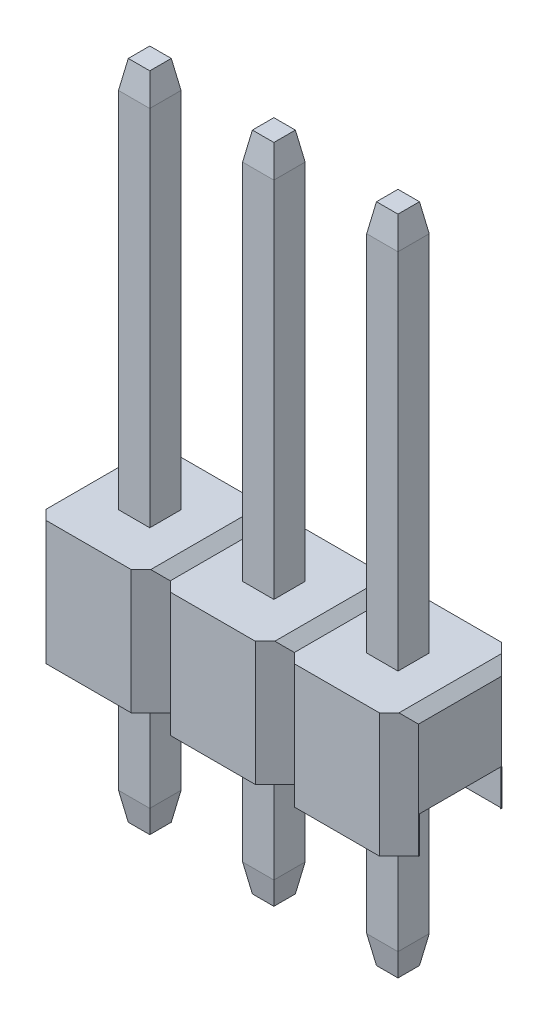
ISO-10303-21;
HEADER;
FILE_DESCRIPTION(('STEP AP214'),'2;1');
FILE_NAME('part.step','',(''),(''),'','','');
FILE_SCHEMA(('AUTOMOTIVE_DESIGN { 1 0 10303 214 1 1 1 1 }'));
ENDSEC;
DATA;
#1=APPLICATION_CONTEXT('core data for automotive mechanical design processes');
#2=APPLICATION_PROTOCOL_DEFINITION('international standard','automotive_design',2000,#1);
#3=PRODUCT_CONTEXT('',#1,'mechanical');
#4=PRODUCT('Part','Part','',(#3));
#5=PRODUCT_RELATED_PRODUCT_CATEGORY('part','',(#4));
#6=PRODUCT_DEFINITION_FORMATION('','',#4);
#7=PRODUCT_DEFINITION_CONTEXT('part definition',#1,'design');
#8=PRODUCT_DEFINITION('design','',#6,#7);
#9=PRODUCT_DEFINITION_SHAPE('','',#8);
#10=(LENGTH_UNIT() NAMED_UNIT(*) SI_UNIT(.MILLI.,.METRE.));
#11=(NAMED_UNIT(*) PLANE_ANGLE_UNIT() SI_UNIT($,.RADIAN.));
#12=(NAMED_UNIT(*) SI_UNIT($,.STERADIAN.) SOLID_ANGLE_UNIT());
#13=UNCERTAINTY_MEASURE_WITH_UNIT(LENGTH_MEASURE(1.E-05),#10,'distance_accuracy_value','');
#14=(GEOMETRIC_REPRESENTATION_CONTEXT(3) GLOBAL_UNCERTAINTY_ASSIGNED_CONTEXT((#13)) GLOBAL_UNIT_ASSIGNED_CONTEXT((#10,
#11,#12)) REPRESENTATION_CONTEXT('',''));
#15=CARTESIAN_POINT('',(0.,0.,0.));
#16=DIRECTION('',(0.,0.,1.));
#17=DIRECTION('',(1.,0.,0.));
#18=AXIS2_PLACEMENT_3D('',#15,#16,#17);
#19=CARTESIAN_POINT('',(1.275,0.,-0.83));
#20=DIRECTION('',(0.,0.,-1.));
#21=DIRECTION('',(-1.,0.,0.));
#22=AXIS2_PLACEMENT_3D('',#19,#20,#21);
#23=PLANE('',#22);
#24=DIRECTION('',(0.707106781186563,0.707106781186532,0.));
#25=VECTOR('',#24,1.);
#26=CARTESIAN_POINT('',(1.265,0.735,-0.83));
#27=LINE('',#26,#25);
#28=CARTESIAN_POINT('',(1.265,0.735,-0.83));
#29=VERTEX_POINT('',#28);
#30=CARTESIAN_POINT('',(1.27,0.74,-0.83));
#31=VERTEX_POINT('',#30);
#32=EDGE_CURVE('P0_E477',#29,#31,#27,.T.);
#33=ORIENTED_EDGE('',*,*,#32,.F.);
#34=DIRECTION('',(0.,1.,0.));
#35=VECTOR('',#34,1.);
#36=CARTESIAN_POINT('',(1.265,0.,-0.83));
#37=LINE('',#36,#35);
#38=CARTESIAN_POINT('',(1.265,0.,-0.83));
#39=VERTEX_POINT('',#38);
#40=EDGE_CURVE('P0_E527',#29,#39,#37,.F.);
#41=ORIENTED_EDGE('',*,*,#40,.T.);
#42=DIRECTION('',(-1.,0.,0.));
#43=VECTOR('',#42,1.);
#44=CARTESIAN_POINT('',(1.275,0.,-0.83));
#45=LINE('',#44,#43);
#46=CARTESIAN_POINT('',(1.275,0.,-0.83));
#47=VERTEX_POINT('',#46);
#48=EDGE_CURVE('P0_E20',#47,#39,#45,.T.);
#49=ORIENTED_EDGE('',*,*,#48,.F.);
#50=DIRECTION('',(0.,1.,0.));
#51=VECTOR('',#50,1.);
#52=CARTESIAN_POINT('',(1.275,0.,-0.83));
#53=LINE('',#52,#51);
#54=CARTESIAN_POINT('',(1.275,0.735,-0.83));
#55=VERTEX_POINT('',#54);
#56=EDGE_CURVE('P0_E479',#55,#47,#53,.F.);
#57=ORIENTED_EDGE('',*,*,#56,.F.);
#58=DIRECTION('',(0.707106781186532,-0.707106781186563,0.));
#59=VECTOR('',#58,1.);
#60=CARTESIAN_POINT('',(1.27,0.74,-0.83));
#61=LINE('',#60,#59);
#62=EDGE_CURVE('P0_E473',#31,#55,#61,.T.);
#63=ORIENTED_EDGE('',*,*,#62,.F.);
#64=EDGE_LOOP('',(#33,#41,#49,#57,#63));
#65=FACE_BOUND('',#64,.T.);
#66=ADVANCED_FACE('P0_F17',(#65),#23,.F.);
#67=CARTESIAN_POINT('',(1.275,0.74,0.83));
#68=DIRECTION('',(0.,0.,1.));
#69=DIRECTION('',(1.,0.,0.));
#70=AXIS2_PLACEMENT_3D('',#67,#68,#69);
#71=PLANE('',#70);
#72=DIRECTION('',(0.,1.,0.));
#73=VECTOR('',#72,1.);
#74=CARTESIAN_POINT('',(1.275,0.,0.83));
#75=LINE('',#74,#73);
#76=CARTESIAN_POINT('',(1.275,0.735,0.83));
#77=VERTEX_POINT('',#76);
#78=CARTESIAN_POINT('',(1.275,0.,0.83));
#79=VERTEX_POINT('',#78);
#80=EDGE_CURVE('P0_E602',#77,#79,#75,.F.);
#81=ORIENTED_EDGE('',*,*,#80,.T.);
#82=DIRECTION('',(1.,0.,0.));
#83=VECTOR('',#82,1.);
#84=CARTESIAN_POINT('',(1.275,0.,0.83));
#85=LINE('',#84,#83);
#86=CARTESIAN_POINT('',(1.265,0.,0.83));
#87=VERTEX_POINT('',#86);
#88=EDGE_CURVE('P0_E482',#87,#79,#85,.T.);
#89=ORIENTED_EDGE('',*,*,#88,.F.);
#90=DIRECTION('',(0.,1.,0.));
#91=VECTOR('',#90,1.);
#92=CARTESIAN_POINT('',(1.265,0.,0.83));
#93=LINE('',#92,#91);
#94=CARTESIAN_POINT('',(1.265,0.735,0.83));
#95=VERTEX_POINT('',#94);
#96=EDGE_CURVE('P0_E567',#95,#87,#93,.F.);
#97=ORIENTED_EDGE('',*,*,#96,.F.);
#98=DIRECTION('',(-0.707106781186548,-0.707106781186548,0.));
#99=VECTOR('',#98,1.);
#100=CARTESIAN_POINT('',(1.07,0.54,0.830000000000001));
#101=LINE('',#100,#99);
#102=CARTESIAN_POINT('',(1.27,0.74,0.830000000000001));
#103=VERTEX_POINT('',#102);
#104=EDGE_CURVE('P0_E579',#95,#103,#101,.F.);
#105=ORIENTED_EDGE('',*,*,#104,.T.);
#106=DIRECTION('',(-0.707106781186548,0.707106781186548,0.));
#107=VECTOR('',#106,1.);
#108=CARTESIAN_POINT('',(1.47,0.54,0.830000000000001));
#109=LINE('',#108,#107);
#110=EDGE_CURVE('P0_E490',#103,#77,#109,.F.);
#111=ORIENTED_EDGE('',*,*,#110,.T.);
#112=EDGE_LOOP('',(#81,#89,#97,#105,#111));
#113=FACE_BOUND('',#112,.T.);
#114=ADVANCED_FACE('P0_F1394',(#113),#71,.F.);
#115=CARTESIAN_POINT('',(-0.32,2.54,-0.32));
#116=DIRECTION('',(0.,0.,1.));
#117=DIRECTION('',(1.,0.,0.));
#118=AXIS2_PLACEMENT_3D('',#115,#116,#117);
#119=PLANE('',#118);
#120=DIRECTION('',(1.,0.,0.));
#121=VECTOR('',#120,1.);
#122=CARTESIAN_POINT('',(0.,2.54,-0.32));
#123=LINE('',#122,#121);
#124=CARTESIAN_POINT('',(0.32,2.54,-0.32));
#125=VERTEX_POINT('',#124);
#126=CARTESIAN_POINT('',(-0.32,2.54,-0.32));
#127=VERTEX_POINT('',#126);
#128=EDGE_CURVE('P0_E621',#125,#127,#123,.F.);
#129=ORIENTED_EDGE('',*,*,#128,.T.);
#130=DIRECTION('',(0.,1.,0.));
#131=VECTOR('',#130,1.);
#132=CARTESIAN_POINT('',(-0.32,2.54,-0.32));
#133=LINE('',#132,#131);
#134=CARTESIAN_POINT('',(-0.32,0.54,-0.32));
#135=VERTEX_POINT('',#134);
#136=EDGE_CURVE('P0_E501',#135,#127,#133,.T.);
#137=ORIENTED_EDGE('',*,*,#136,.F.);
#138=DIRECTION('',(1.,0.,0.));
#139=VECTOR('',#138,1.);
#140=CARTESIAN_POINT('',(-1.27,0.54,-0.32));
#141=LINE('',#140,#139);
#142=CARTESIAN_POINT('',(0.32,0.54,-0.32));
#143=VERTEX_POINT('',#142);
#144=EDGE_CURVE('P0_E559',#135,#143,#141,.T.);
#145=ORIENTED_EDGE('',*,*,#144,.T.);
#146=DIRECTION('',(0.,1.,0.));
#147=VECTOR('',#146,1.);
#148=CARTESIAN_POINT('',(0.32,2.54,-0.32));
#149=LINE('',#148,#147);
#150=EDGE_CURVE('P0_E507',#125,#143,#149,.F.);
#151=ORIENTED_EDGE('',*,*,#150,.F.);
#152=EDGE_LOOP('',(#129,#137,#145,#151));
#153=FACE_BOUND('',#152,.T.);
#154=ADVANCED_FACE('P0_F1391',(#153),#119,.T.);
#155=CARTESIAN_POINT('',(-0.32,2.54,0.32));
#156=DIRECTION('',(1.,0.,0.));
#157=DIRECTION('',(0.,0.,-1.));
#158=AXIS2_PLACEMENT_3D('',#155,#156,#157);
#159=PLANE('',#158);
#160=DIRECTION('',(0.,0.,-1.));
#161=VECTOR('',#160,1.);
#162=CARTESIAN_POINT('',(-0.32,2.54,0.));
#163=LINE('',#162,#161);
#164=CARTESIAN_POINT('',(-0.32,2.54,0.32));
#165=VERTEX_POINT('',#164);
#166=EDGE_CURVE('P0_E624',#127,#165,#163,.F.);
#167=ORIENTED_EDGE('',*,*,#166,.T.);
#168=DIRECTION('',(0.,1.,0.));
#169=VECTOR('',#168,1.);
#170=CARTESIAN_POINT('',(-0.32,2.54,0.32));
#171=LINE('',#170,#169);
#172=CARTESIAN_POINT('',(-0.32,0.54,0.32));
#173=VERTEX_POINT('',#172);
#174=EDGE_CURVE('P0_E503',#173,#165,#171,.T.);
#175=ORIENTED_EDGE('',*,*,#174,.F.);
#176=DIRECTION('',(0.,0.,1.));
#177=VECTOR('',#176,1.);
#178=CARTESIAN_POINT('',(-0.32,0.54,0.85));
#179=LINE('',#178,#177);
#180=EDGE_CURVE('P0_E556',#173,#135,#179,.F.);
#181=ORIENTED_EDGE('',*,*,#180,.T.);
#182=ORIENTED_EDGE('',*,*,#136,.T.);
#183=EDGE_LOOP('',(#167,#175,#181,#182));
#184=FACE_BOUND('',#183,.T.);
#185=ADVANCED_FACE('P0_F1387',(#184),#159,.T.);
#186=CARTESIAN_POINT('',(-0.32,2.54,0.32));
#187=DIRECTION('',(0.,0.,-1.));
#188=DIRECTION('',(-1.,0.,0.));
#189=AXIS2_PLACEMENT_3D('',#186,#187,#188);
#190=PLANE('',#189);
#191=DIRECTION('',(1.,0.,0.));
#192=VECTOR('',#191,1.);
#193=CARTESIAN_POINT('',(0.,2.54,0.32));
#194=LINE('',#193,#192);
#195=CARTESIAN_POINT('',(0.32,2.54,0.32));
#196=VERTEX_POINT('',#195);
#197=EDGE_CURVE('P0_E627',#165,#196,#194,.T.);
#198=ORIENTED_EDGE('',*,*,#197,.T.);
#199=DIRECTION('',(0.,1.,0.));
#200=VECTOR('',#199,1.);
#201=CARTESIAN_POINT('',(0.32,2.54,0.32));
#202=LINE('',#201,#200);
#203=CARTESIAN_POINT('',(0.32,0.54,0.32));
#204=VERTEX_POINT('',#203);
#205=EDGE_CURVE('P0_E505',#204,#196,#202,.T.);
#206=ORIENTED_EDGE('',*,*,#205,.F.);
#207=DIRECTION('',(1.,0.,0.));
#208=VECTOR('',#207,1.);
#209=CARTESIAN_POINT('',(-1.27,0.54,0.32));
#210=LINE('',#209,#208);
#211=EDGE_CURVE('P0_E553',#204,#173,#210,.F.);
#212=ORIENTED_EDGE('',*,*,#211,.T.);
#213=ORIENTED_EDGE('',*,*,#174,.T.);
#214=EDGE_LOOP('',(#198,#206,#212,#213));
#215=FACE_BOUND('',#214,.T.);
#216=ADVANCED_FACE('P0_F1383',(#215),#190,.T.);
#217=CARTESIAN_POINT('',(0.32,2.54,0.32));
#218=DIRECTION('',(-1.,0.,0.));
#219=DIRECTION('',(0.,0.,1.));
#220=AXIS2_PLACEMENT_3D('',#217,#218,#219);
#221=PLANE('',#220);
#222=DIRECTION('',(0.,0.,-1.));
#223=VECTOR('',#222,1.);
#224=CARTESIAN_POINT('',(0.32,2.54,0.));
#225=LINE('',#224,#223);
#226=EDGE_CURVE('P0_E630',#196,#125,#225,.T.);
#227=ORIENTED_EDGE('',*,*,#226,.T.);
#228=ORIENTED_EDGE('',*,*,#150,.T.);
#229=DIRECTION('',(0.,0.,1.));
#230=VECTOR('',#229,1.);
#231=CARTESIAN_POINT('',(0.32,0.54,0.85));
#232=LINE('',#231,#230);
#233=EDGE_CURVE('P0_E562',#143,#204,#232,.T.);
#234=ORIENTED_EDGE('',*,*,#233,.T.);
#235=ORIENTED_EDGE('',*,*,#205,.T.);
#236=EDGE_LOOP('',(#227,#228,#234,#235));
#237=FACE_BOUND('',#236,.T.);
#238=ADVANCED_FACE('P0_F1379',(#237),#221,.T.);
#239=CARTESIAN_POINT('',(3.815,0.74,0.83));
#240=DIRECTION('',(0.,0.,1.));
#241=DIRECTION('',(1.,0.,0.));
#242=AXIS2_PLACEMENT_3D('',#239,#240,#241);
#243=PLANE('',#242);
#244=DIRECTION('',(0.,1.,0.));
#245=VECTOR('',#244,1.);
#246=CARTESIAN_POINT('',(3.815,0.,0.83));
#247=LINE('',#246,#245);
#248=CARTESIAN_POINT('',(3.815,0.735,0.83));
#249=VERTEX_POINT('',#248);
#250=CARTESIAN_POINT('',(3.815,0.,0.83));
#251=VERTEX_POINT('',#250);
#252=EDGE_CURVE('P0_E653',#249,#251,#247,.F.);
#253=ORIENTED_EDGE('',*,*,#252,.T.);
#254=DIRECTION('',(1.,0.,0.));
#255=VECTOR('',#254,1.);
#256=CARTESIAN_POINT('',(3.815,0.,0.83));
#257=LINE('',#256,#255);
#258=CARTESIAN_POINT('',(3.805,0.,0.83));
#259=VERTEX_POINT('',#258);
#260=EDGE_CURVE('P0_E509',#259,#251,#257,.T.);
#261=ORIENTED_EDGE('',*,*,#260,.F.);
#262=DIRECTION('',(0.,1.,0.));
#263=VECTOR('',#262,1.);
#264=CARTESIAN_POINT('',(3.805,0.,0.83));
#265=LINE('',#264,#263);
#266=CARTESIAN_POINT('',(3.805,0.735,0.83));
#267=VERTEX_POINT('',#266);
#268=EDGE_CURVE('P0_E581',#267,#259,#265,.F.);
#269=ORIENTED_EDGE('',*,*,#268,.F.);
#270=DIRECTION('',(-0.707106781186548,-0.707106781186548,0.));
#271=VECTOR('',#270,1.);
#272=CARTESIAN_POINT('',(3.61,0.54,0.830000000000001));
#273=LINE('',#272,#271);
#274=CARTESIAN_POINT('',(3.81,0.74,0.830000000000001));
#275=VERTEX_POINT('',#274);
#276=EDGE_CURVE('P0_E640',#267,#275,#273,.F.);
#277=ORIENTED_EDGE('',*,*,#276,.T.);
#278=DIRECTION('',(-0.707106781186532,0.707106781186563,0.));
#279=VECTOR('',#278,1.);
#280=CARTESIAN_POINT('',(3.815,0.735,0.83));
#281=LINE('',#280,#279);
#282=EDGE_CURVE('P0_E511',#249,#275,#281,.T.);
#283=ORIENTED_EDGE('',*,*,#282,.F.);
#284=EDGE_LOOP('',(#253,#261,#269,#277,#283));
#285=FACE_BOUND('',#284,.T.);
#286=ADVANCED_FACE('P0_F1375',(#285),#243,.F.);
#287=CARTESIAN_POINT('',(3.815,0.,-0.83));
#288=DIRECTION('',(0.,0.,-1.));
#289=DIRECTION('',(-1.,0.,0.));
#290=AXIS2_PLACEMENT_3D('',#287,#288,#289);
#291=PLANE('',#290);
#292=DIRECTION('',(-0.707106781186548,-0.707106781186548,0.));
#293=VECTOR('',#292,1.);
#294=CARTESIAN_POINT('',(3.61,0.54,-0.83));
#295=LINE('',#294,#293);
#296=CARTESIAN_POINT('',(3.81,0.74,-0.83));
#297=VERTEX_POINT('',#296);
#298=CARTESIAN_POINT('',(3.805,0.735,-0.83));
#299=VERTEX_POINT('',#298);
#300=EDGE_CURVE('P0_E643',#297,#299,#295,.T.);
#301=ORIENTED_EDGE('',*,*,#300,.T.);
#302=DIRECTION('',(0.,1.,0.));
#303=VECTOR('',#302,1.);
#304=CARTESIAN_POINT('',(3.805,0.,-0.83));
#305=LINE('',#304,#303);
#306=CARTESIAN_POINT('',(3.805,0.,-0.83));
#307=VERTEX_POINT('',#306);
#308=EDGE_CURVE('P0_E531',#299,#307,#305,.F.);
#309=ORIENTED_EDGE('',*,*,#308,.T.);
#310=DIRECTION('',(-1.,0.,0.));
#311=VECTOR('',#310,1.);
#312=CARTESIAN_POINT('',(3.815,0.,-0.83));
#313=LINE('',#312,#311);
#314=CARTESIAN_POINT('',(3.815,0.,-0.83));
#315=VERTEX_POINT('',#314);
#316=EDGE_CURVE('P0_E513',#315,#307,#313,.T.);
#317=ORIENTED_EDGE('',*,*,#316,.F.);
#318=DIRECTION('',(0.,1.,0.));
#319=VECTOR('',#318,1.);
#320=CARTESIAN_POINT('',(3.815,0.,-0.83));
#321=LINE('',#320,#319);
#322=CARTESIAN_POINT('',(3.815,0.735,-0.83));
#323=VERTEX_POINT('',#322);
#324=EDGE_CURVE('P0_E663',#323,#315,#321,.F.);
#325=ORIENTED_EDGE('',*,*,#324,.F.);
#326=DIRECTION('',(0.707106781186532,-0.707106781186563,0.));
#327=VECTOR('',#326,1.);
#328=CARTESIAN_POINT('',(3.81,0.74,-0.83));
#329=LINE('',#328,#327);
#330=EDGE_CURVE('P0_E516',#297,#323,#329,.T.);
#331=ORIENTED_EDGE('',*,*,#330,.F.);
#332=EDGE_LOOP('',(#301,#309,#317,#325,#331));
#333=FACE_BOUND('',#332,.T.);
#334=ADVANCED_FACE('P0_F1371',(#333),#291,.F.);
#335=CARTESIAN_POINT('',(2.22,2.54,-0.32));
#336=DIRECTION('',(0.,0.,1.));
#337=DIRECTION('',(1.,0.,0.));
#338=AXIS2_PLACEMENT_3D('',#335,#336,#337);
#339=PLANE('',#338);
#340=DIRECTION('',(1.,0.,0.));
#341=VECTOR('',#340,1.);
#342=CARTESIAN_POINT('',(2.54,2.54,-0.32));
#343=LINE('',#342,#341);
#344=CARTESIAN_POINT('',(2.86,2.54,-0.32));
#345=VERTEX_POINT('',#344);
#346=CARTESIAN_POINT('',(2.22,2.54,-0.32));
#347=VERTEX_POINT('',#346);
#348=EDGE_CURVE('P0_E670',#345,#347,#343,.F.);
#349=ORIENTED_EDGE('',*,*,#348,.T.);
#350=DIRECTION('',(0.,1.,0.));
#351=VECTOR('',#350,1.);
#352=CARTESIAN_POINT('',(2.22,2.54,-0.32));
#353=LINE('',#352,#351);
#354=CARTESIAN_POINT('',(2.22,0.54,-0.32));
#355=VERTEX_POINT('',#354);
#356=EDGE_CURVE('P0_E518',#355,#347,#353,.T.);
#357=ORIENTED_EDGE('',*,*,#356,.F.);
#358=DIRECTION('',(1.,0.,0.));
#359=VECTOR('',#358,1.);
#360=CARTESIAN_POINT('',(1.27,0.54,-0.32));
#361=LINE('',#360,#359);
#362=CARTESIAN_POINT('',(2.86,0.54,-0.32));
#363=VERTEX_POINT('',#362);
#364=EDGE_CURVE('P0_E592',#355,#363,#361,.T.);
#365=ORIENTED_EDGE('',*,*,#364,.T.);
#366=DIRECTION('',(0.,1.,0.));
#367=VECTOR('',#366,1.);
#368=CARTESIAN_POINT('',(2.86,2.54,-0.32));
#369=LINE('',#368,#367);
#370=EDGE_CURVE('P0_E524',#345,#363,#369,.F.);
#371=ORIENTED_EDGE('',*,*,#370,.F.);
#372=EDGE_LOOP('',(#349,#357,#365,#371));
#373=FACE_BOUND('',#372,.T.);
#374=ADVANCED_FACE('P0_F1367',(#373),#339,.T.);
#375=CARTESIAN_POINT('',(2.22,2.54,0.32));
#376=DIRECTION('',(1.,0.,0.));
#377=DIRECTION('',(0.,0.,-1.));
#378=AXIS2_PLACEMENT_3D('',#375,#376,#377);
#379=PLANE('',#378);
#380=DIRECTION('',(0.,0.,-1.));
#381=VECTOR('',#380,1.);
#382=CARTESIAN_POINT('',(2.22,2.54,0.));
#383=LINE('',#382,#381);
#384=CARTESIAN_POINT('',(2.22,2.54,0.32));
#385=VERTEX_POINT('',#384);
#386=EDGE_CURVE('P0_E673',#347,#385,#383,.F.);
#387=ORIENTED_EDGE('',*,*,#386,.T.);
#388=DIRECTION('',(0.,1.,0.));
#389=VECTOR('',#388,1.);
#390=CARTESIAN_POINT('',(2.22,2.54,0.32));
#391=LINE('',#390,#389);
#392=CARTESIAN_POINT('',(2.22,0.54,0.32));
#393=VERTEX_POINT('',#392);
#394=EDGE_CURVE('P0_E520',#393,#385,#391,.T.);
#395=ORIENTED_EDGE('',*,*,#394,.F.);
#396=DIRECTION('',(0.,0.,1.));
#397=VECTOR('',#396,1.);
#398=CARTESIAN_POINT('',(2.22,0.54,0.85));
#399=LINE('',#398,#397);
#400=EDGE_CURVE('P0_E589',#393,#355,#399,.F.);
#401=ORIENTED_EDGE('',*,*,#400,.T.);
#402=ORIENTED_EDGE('',*,*,#356,.T.);
#403=EDGE_LOOP('',(#387,#395,#401,#402));
#404=FACE_BOUND('',#403,.T.);
#405=ADVANCED_FACE('P0_F1363',(#404),#379,.T.);
#406=CARTESIAN_POINT('',(2.22,2.54,0.32));
#407=DIRECTION('',(0.,0.,-1.));
#408=DIRECTION('',(-1.,0.,0.));
#409=AXIS2_PLACEMENT_3D('',#406,#407,#408);
#410=PLANE('',#409);
#411=DIRECTION('',(1.,0.,0.));
#412=VECTOR('',#411,1.);
#413=CARTESIAN_POINT('',(2.54,2.54,0.32));
#414=LINE('',#413,#412);
#415=CARTESIAN_POINT('',(2.86,2.54,0.32));
#416=VERTEX_POINT('',#415);
#417=EDGE_CURVE('P0_E676',#385,#416,#414,.T.);
#418=ORIENTED_EDGE('',*,*,#417,.T.);
#419=DIRECTION('',(0.,1.,0.));
#420=VECTOR('',#419,1.);
#421=CARTESIAN_POINT('',(2.86,2.54,0.32));
#422=LINE('',#421,#420);
#423=CARTESIAN_POINT('',(2.86,0.54,0.32));
#424=VERTEX_POINT('',#423);
#425=EDGE_CURVE('P0_E522',#424,#416,#422,.T.);
#426=ORIENTED_EDGE('',*,*,#425,.F.);
#427=DIRECTION('',(1.,0.,0.));
#428=VECTOR('',#427,1.);
#429=CARTESIAN_POINT('',(1.27,0.54,0.32));
#430=LINE('',#429,#428);
#431=EDGE_CURVE('P0_E586',#424,#393,#430,.F.);
#432=ORIENTED_EDGE('',*,*,#431,.T.);
#433=ORIENTED_EDGE('',*,*,#394,.T.);
#434=EDGE_LOOP('',(#418,#426,#432,#433));
#435=FACE_BOUND('',#434,.T.);
#436=ADVANCED_FACE('P0_F1359',(#435),#410,.T.);
#437=CARTESIAN_POINT('',(2.86,2.54,0.32));
#438=DIRECTION('',(-1.,0.,0.));
#439=DIRECTION('',(0.,0.,1.));
#440=AXIS2_PLACEMENT_3D('',#437,#438,#439);
#441=PLANE('',#440);
#442=DIRECTION('',(0.,0.,-1.));
#443=VECTOR('',#442,1.);
#444=CARTESIAN_POINT('',(2.86,2.54,0.));
#445=LINE('',#444,#443);
#446=EDGE_CURVE('P0_E679',#416,#345,#445,.T.);
#447=ORIENTED_EDGE('',*,*,#446,.T.);
#448=ORIENTED_EDGE('',*,*,#370,.T.);
#449=DIRECTION('',(0.,0.,1.));
#450=VECTOR('',#449,1.);
#451=CARTESIAN_POINT('',(2.86,0.54,0.85));
#452=LINE('',#451,#450);
#453=EDGE_CURVE('P0_E595',#363,#424,#452,.T.);
#454=ORIENTED_EDGE('',*,*,#453,.T.);
#455=ORIENTED_EDGE('',*,*,#425,.T.);
#456=EDGE_LOOP('',(#447,#448,#454,#455));
#457=FACE_BOUND('',#456,.T.);
#458=ADVANCED_FACE('P0_F1356',(#457),#441,.T.);
#459=CARTESIAN_POINT('',(1.265,0.,0.));
#460=DIRECTION('',(1.,0.,0.));
#461=DIRECTION('',(0.,0.,-1.));
#462=AXIS2_PLACEMENT_3D('',#459,#460,#461);
#463=PLANE('',#462);
#464=DIRECTION('',(0.,0.,1.));
#465=VECTOR('',#464,1.);
#466=CARTESIAN_POINT('',(1.265,0.735,-0.85));
#467=LINE('',#466,#465);
#468=CARTESIAN_POINT('',(1.265,0.735,-0.85));
#469=VERTEX_POINT('',#468);
#470=EDGE_CURVE('P0_E498',#29,#469,#467,.F.);
#471=ORIENTED_EDGE('',*,*,#470,.T.);
#472=DIRECTION('',(0.,1.,0.));
#473=VECTOR('',#472,1.);
#474=CARTESIAN_POINT('',(1.265,0.,-0.85));
#475=LINE('',#474,#473);
#476=CARTESIAN_POINT('',(1.265,0.,-0.85));
#477=VERTEX_POINT('',#476);
#478=EDGE_CURVE('P0_E690',#469,#477,#475,.F.);
#479=ORIENTED_EDGE('',*,*,#478,.T.);
#480=DIRECTION('',(0.,0.,-1.));
#481=VECTOR('',#480,1.);
#482=CARTESIAN_POINT('',(1.265,0.,0.));
#483=LINE('',#482,#481);
#484=EDGE_CURVE('P0_E468',#39,#477,#483,.T.);
#485=ORIENTED_EDGE('',*,*,#484,.F.);
#486=ORIENTED_EDGE('',*,*,#40,.F.);
#487=EDGE_LOOP('',(#471,#479,#485,#486));
#488=FACE_BOUND('',#487,.T.);
#489=ADVANCED_FACE('P0_F1352',(#488),#463,.F.);
#490=CARTESIAN_POINT('',(3.805,0.,0.));
#491=DIRECTION('',(1.,0.,0.));
#492=DIRECTION('',(0.,0.,-1.));
#493=AXIS2_PLACEMENT_3D('',#490,#491,#492);
#494=PLANE('',#493);
#495=DIRECTION('',(0.,0.,1.));
#496=VECTOR('',#495,1.);
#497=CARTESIAN_POINT('',(3.805,0.735,-0.85));
#498=LINE('',#497,#496);
#499=CARTESIAN_POINT('',(3.805,0.735,-0.85));
#500=VERTEX_POINT('',#499);
#501=EDGE_CURVE('P0_E633',#299,#500,#498,.F.);
#502=ORIENTED_EDGE('',*,*,#501,.T.);
#503=DIRECTION('',(0.,1.,0.));
#504=VECTOR('',#503,1.);
#505=CARTESIAN_POINT('',(3.805,0.,-0.85));
#506=LINE('',#505,#504);
#507=CARTESIAN_POINT('',(3.805,0.,-0.85));
#508=VERTEX_POINT('',#507);
#509=EDGE_CURVE('P0_E743',#500,#508,#506,.F.);
#510=ORIENTED_EDGE('',*,*,#509,.T.);
#511=DIRECTION('',(0.,0.,-1.));
#512=VECTOR('',#511,1.);
#513=CARTESIAN_POINT('',(3.805,0.,0.));
#514=LINE('',#513,#512);
#515=EDGE_CURVE('P0_E529',#307,#508,#514,.T.);
#516=ORIENTED_EDGE('',*,*,#515,.F.);
#517=ORIENTED_EDGE('',*,*,#308,.F.);
#518=EDGE_LOOP('',(#502,#510,#516,#517));
#519=FACE_BOUND('',#518,.T.);
#520=ADVANCED_FACE('P0_F1348',(#519),#494,.F.);
#521=CARTESIAN_POINT('',(1.275,0.,0.));
#522=DIRECTION('',(1.,0.,0.));
#523=DIRECTION('',(0.,0.,-1.));
#524=AXIS2_PLACEMENT_3D('',#521,#522,#523);
#525=PLANE('',#524);
#526=ORIENTED_EDGE('',*,*,#56,.T.);
#527=DIRECTION('',(0.,0.,-1.));
#528=VECTOR('',#527,1.);
#529=CARTESIAN_POINT('',(1.275,0.,0.));
#530=LINE('',#529,#528);
#531=CARTESIAN_POINT('',(1.275,0.,-0.85));
#532=VERTEX_POINT('',#531);
#533=EDGE_CURVE('P0_E535',#47,#532,#530,.T.);
#534=ORIENTED_EDGE('',*,*,#533,.T.);
#535=DIRECTION('',(0.,1.,0.));
#536=VECTOR('',#535,1.);
#537=CARTESIAN_POINT('',(1.275,0.,-0.85));
#538=LINE('',#537,#536);
#539=CARTESIAN_POINT('',(1.275,0.735,-0.85));
#540=VERTEX_POINT('',#539);
#541=EDGE_CURVE('P0_E746',#532,#540,#538,.T.);
#542=ORIENTED_EDGE('',*,*,#541,.T.);
#543=DIRECTION('',(0.,0.,1.));
#544=VECTOR('',#543,1.);
#545=CARTESIAN_POINT('',(1.275,0.735,-0.85));
#546=LINE('',#545,#544);
#547=EDGE_CURVE('P0_E493',#540,#55,#546,.T.);
#548=ORIENTED_EDGE('',*,*,#547,.T.);
#549=EDGE_LOOP('',(#526,#534,#542,#548));
#550=FACE_BOUND('',#549,.T.);
#551=ADVANCED_FACE('P0_F1344',(#550),#525,.T.);
#552=CARTESIAN_POINT('',(6.355,0.,-0.83));
#553=DIRECTION('',(0.,0.,-1.));
#554=DIRECTION('',(-1.,0.,0.));
#555=AXIS2_PLACEMENT_3D('',#552,#553,#554);
#556=PLANE('',#555);
#557=DIRECTION('',(0.707106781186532,0.707106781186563,0.));
#558=VECTOR('',#557,1.);
#559=CARTESIAN_POINT('',(6.345,0.735,-0.83));
#560=LINE('',#559,#558);
#561=CARTESIAN_POINT('',(6.345,0.735,-0.83));
#562=VERTEX_POINT('',#561);
#563=CARTESIAN_POINT('',(6.35,0.74,-0.83));
#564=VERTEX_POINT('',#563);
#565=EDGE_CURVE('P0_E540',#562,#564,#560,.T.);
#566=ORIENTED_EDGE('',*,*,#565,.F.);
#567=DIRECTION('',(0.,1.,0.));
#568=VECTOR('',#567,1.);
#569=CARTESIAN_POINT('',(6.345,0.,-0.83));
#570=LINE('',#569,#568);
#571=CARTESIAN_POINT('',(6.345,0.,-0.83));
#572=VERTEX_POINT('',#571);
#573=EDGE_CURVE('P0_E660',#562,#572,#570,.F.);
#574=ORIENTED_EDGE('',*,*,#573,.T.);
#575=DIRECTION('',(-1.,0.,0.));
#576=VECTOR('',#575,1.);
#577=CARTESIAN_POINT('',(6.355,0.,-0.83));
#578=LINE('',#577,#576);
#579=CARTESIAN_POINT('',(6.355,0.,-0.83));
#580=VERTEX_POINT('',#579);
#581=EDGE_CURVE('P0_E537',#580,#572,#578,.T.);
#582=ORIENTED_EDGE('',*,*,#581,.F.);
#583=DIRECTION('',(0.,1.,0.));
#584=VECTOR('',#583,1.);
#585=CARTESIAN_POINT('',(6.355,0.,-0.83));
#586=LINE('',#585,#584);
#587=CARTESIAN_POINT('',(6.355,0.74,-0.83));
#588=VERTEX_POINT('',#587);
#589=EDGE_CURVE('P0_E749',#588,#580,#586,.F.);
#590=ORIENTED_EDGE('',*,*,#589,.F.);
#591=DIRECTION('',(-1.,0.,0.));
#592=VECTOR('',#591,1.);
#593=CARTESIAN_POINT('',(6.355,0.74,-0.83));
#594=LINE('',#593,#592);
#595=EDGE_CURVE('P0_E543',#564,#588,#594,.F.);
#596=ORIENTED_EDGE('',*,*,#595,.F.);
#597=EDGE_LOOP('',(#566,#574,#582,#590,#596));
#598=FACE_BOUND('',#597,.T.);
#599=ADVANCED_FACE('P0_F1340',(#598),#556,.F.);
#600=CARTESIAN_POINT('',(6.355,0.74,0.83));
#601=DIRECTION('',(0.,0.,1.));
#602=DIRECTION('',(1.,0.,0.));
#603=AXIS2_PLACEMENT_3D('',#600,#601,#602);
#604=PLANE('',#603);
#605=DIRECTION('',(-0.707106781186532,-0.707106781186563,0.));
#606=VECTOR('',#605,1.);
#607=CARTESIAN_POINT('',(6.35,0.74,0.83));
#608=LINE('',#607,#606);
#609=CARTESIAN_POINT('',(6.35,0.74,0.83));
#610=VERTEX_POINT('',#609);
#611=CARTESIAN_POINT('',(6.345,0.735,0.830000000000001));
#612=VERTEX_POINT('',#611);
#613=EDGE_CURVE('P0_E550',#610,#612,#608,.T.);
#614=ORIENTED_EDGE('',*,*,#613,.F.);
#615=DIRECTION('',(1.,0.,0.));
#616=VECTOR('',#615,1.);
#617=CARTESIAN_POINT('',(6.355,0.74,0.83));
#618=LINE('',#617,#616);
#619=CARTESIAN_POINT('',(6.355,0.74,0.83));
#620=VERTEX_POINT('',#619);
#621=EDGE_CURVE('P0_E547',#620,#610,#618,.F.);
#622=ORIENTED_EDGE('',*,*,#621,.F.);
#623=DIRECTION('',(0.,1.,0.));
#624=VECTOR('',#623,1.);
#625=CARTESIAN_POINT('',(6.355,0.,0.83));
#626=LINE('',#625,#624);
#627=CARTESIAN_POINT('',(6.355,0.,0.83));
#628=VERTEX_POINT('',#627);
#629=EDGE_CURVE('P0_E752',#620,#628,#626,.F.);
#630=ORIENTED_EDGE('',*,*,#629,.T.);
#631=DIRECTION('',(1.,0.,0.));
#632=VECTOR('',#631,1.);
#633=CARTESIAN_POINT('',(6.355,0.,0.83));
#634=LINE('',#633,#632);
#635=CARTESIAN_POINT('',(6.345,0.,0.83));
#636=VERTEX_POINT('',#635);
#637=EDGE_CURVE('P0_E545',#636,#628,#634,.T.);
#638=ORIENTED_EDGE('',*,*,#637,.F.);
#639=DIRECTION('',(0.,1.,0.));
#640=VECTOR('',#639,1.);
#641=CARTESIAN_POINT('',(6.345,0.,0.83));
#642=LINE('',#641,#640);
#643=EDGE_CURVE('P0_E648',#612,#636,#642,.F.);
#644=ORIENTED_EDGE('',*,*,#643,.F.);
#645=EDGE_LOOP('',(#614,#622,#630,#638,#644));
#646=FACE_BOUND('',#645,.T.);
#647=ADVANCED_FACE('P0_F1336',(#646),#604,.F.);
#648=CARTESIAN_POINT('',(-1.27,0.54,0.85));
#649=DIRECTION('',(0.,1.,0.));
#650=DIRECTION('',(0.,0.,1.));
#651=AXIS2_PLACEMENT_3D('',#648,#649,#650);
#652=PLANE('',#651);
#653=DIRECTION('',(0.,0.,1.));
#654=VECTOR('',#653,1.);
#655=CARTESIAN_POINT('',(1.07,0.54,-0.85));
#656=LINE('',#655,#654);
#657=CARTESIAN_POINT('',(1.07,0.54,-0.85));
#658=VERTEX_POINT('',#657);
#659=CARTESIAN_POINT('',(1.07,0.54,0.85));
#660=VERTEX_POINT('',#659);
#661=EDGE_CURVE('P0_E573',#658,#660,#656,.T.);
#662=ORIENTED_EDGE('',*,*,#661,.T.);
#663=DIRECTION('',(1.,0.,0.));
#664=VECTOR('',#663,1.);
#665=CARTESIAN_POINT('',(-1.27,0.54,0.85));
#666=LINE('',#665,#664);
#667=CARTESIAN_POINT('',(-1.07,0.54,0.85));
#668=VERTEX_POINT('',#667);
#669=EDGE_CURVE('P0_E757',#660,#668,#666,.F.);
#670=ORIENTED_EDGE('',*,*,#669,.T.);
#671=DIRECTION('',(0.,0.,1.));
#672=VECTOR('',#671,1.);
#673=CARTESIAN_POINT('',(-1.07,0.54,-0.85));
#674=LINE('',#673,#672);
#675=CARTESIAN_POINT('',(-1.07,0.54,-0.85));
#676=VERTEX_POINT('',#675);
#677=EDGE_CURVE('P0_E565',#668,#676,#674,.F.);
#678=ORIENTED_EDGE('',*,*,#677,.T.);
#679=DIRECTION('',(-1.,0.,0.));
#680=VECTOR('',#679,1.);
#681=CARTESIAN_POINT('',(-1.27,0.54,-0.85));
#682=LINE('',#681,#680);
#683=EDGE_CURVE('P0_E685',#676,#658,#682,.F.);
#684=ORIENTED_EDGE('',*,*,#683,.T.);
#685=EDGE_LOOP('',(#662,#670,#678,#684));
#686=FACE_BOUND('',#685,.T.);
#687=ORIENTED_EDGE('',*,*,#144,.F.);
#688=ORIENTED_EDGE('',*,*,#180,.F.);
#689=ORIENTED_EDGE('',*,*,#211,.F.);
#690=ORIENTED_EDGE('',*,*,#233,.F.);
#691=EDGE_LOOP('',(#687,#688,#689,#690));
#692=FACE_BOUND('',#691,.T.);
#693=ADVANCED_FACE('P0_F1332',(#686,#692),#652,.F.);
#694=CARTESIAN_POINT('',(-1.07,0.54,-0.85));
#695=DIRECTION('',(0.707106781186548,0.707106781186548,0.));
#696=DIRECTION('',(-0.707106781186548,0.707106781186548,0.));
#697=AXIS2_PLACEMENT_3D('',#694,#695,#696);
#698=PLANE('',#697);
#699=DIRECTION('',(0.707106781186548,-0.707106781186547,0.));
#700=VECTOR('',#699,1.);
#701=CARTESIAN_POINT('',(-1.27,0.74,-0.85));
#702=LINE('',#701,#700);
#703=CARTESIAN_POINT('',(-1.27,0.74,-0.85));
#704=VERTEX_POINT('',#703);
#705=EDGE_CURVE('P0_E682',#704,#676,#702,.T.);
#706=ORIENTED_EDGE('',*,*,#705,.T.);
#707=ORIENTED_EDGE('',*,*,#677,.F.);
#708=DIRECTION('',(-0.707106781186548,0.707106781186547,0.));
#709=VECTOR('',#708,1.);
#710=CARTESIAN_POINT('',(-1.07,0.54,0.85));
#711=LINE('',#710,#709);
#712=CARTESIAN_POINT('',(-1.27,0.74,0.850000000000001));
#713=VERTEX_POINT('',#712);
#714=EDGE_CURVE('P0_E760',#668,#713,#711,.T.);
#715=ORIENTED_EDGE('',*,*,#714,.T.);
#716=DIRECTION('',(0.,0.,-1.));
#717=VECTOR('',#716,1.);
#718=CARTESIAN_POINT('',(-1.27,0.74,0.85));
#719=LINE('',#718,#717);
#720=EDGE_CURVE('P0_E612',#713,#704,#719,.T.);
#721=ORIENTED_EDGE('',*,*,#720,.T.);
#722=EDGE_LOOP('',(#706,#707,#715,#721));
#723=FACE_BOUND('',#722,.T.);
#724=ADVANCED_FACE('P0_F1328',(#723),#698,.F.);
#725=CARTESIAN_POINT('',(1.265,0.,0.));
#726=DIRECTION('',(-1.,0.,0.));
#727=DIRECTION('',(0.,0.,1.));
#728=AXIS2_PLACEMENT_3D('',#725,#726,#727);
#729=PLANE('',#728);
#730=DIRECTION('',(0.,0.,1.));
#731=VECTOR('',#730,1.);
#732=CARTESIAN_POINT('',(1.265,0.,0.));
#733=LINE('',#732,#731);
#734=CARTESIAN_POINT('',(1.265,0.,0.85));
#735=VERTEX_POINT('',#734);
#736=EDGE_CURVE('P0_E570',#87,#735,#733,.T.);
#737=ORIENTED_EDGE('',*,*,#736,.T.);
#738=DIRECTION('',(0.,1.,0.));
#739=VECTOR('',#738,1.);
#740=CARTESIAN_POINT('',(1.265,0.,0.85));
#741=LINE('',#740,#739);
#742=CARTESIAN_POINT('',(1.265,0.735,0.85));
#743=VERTEX_POINT('',#742);
#744=EDGE_CURVE('P0_E763',#735,#743,#741,.T.);
#745=ORIENTED_EDGE('',*,*,#744,.T.);
#746=DIRECTION('',(0.,0.,1.));
#747=VECTOR('',#746,1.);
#748=CARTESIAN_POINT('',(1.265,0.735,-0.85));
#749=LINE('',#748,#747);
#750=EDGE_CURVE('P0_E576',#743,#95,#749,.F.);
#751=ORIENTED_EDGE('',*,*,#750,.T.);
#752=ORIENTED_EDGE('',*,*,#96,.T.);
#753=EDGE_LOOP('',(#737,#745,#751,#752));
#754=FACE_BOUND('',#753,.T.);
#755=ADVANCED_FACE('P0_F1325',(#754),#729,.T.);
#756=CARTESIAN_POINT('',(1.07,0.54,-0.85));
#757=DIRECTION('',(-0.707106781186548,0.707106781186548,0.));
#758=DIRECTION('',(-0.707106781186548,-0.707106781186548,0.));
#759=AXIS2_PLACEMENT_3D('',#756,#757,#758);
#760=PLANE('',#759);
#761=DIRECTION('',(0.,0.,1.));
#762=VECTOR('',#761,1.);
#763=CARTESIAN_POINT('',(1.27,0.74,-0.85));
#764=LINE('',#763,#762);
#765=EDGE_CURVE('P0_E486',#31,#103,#764,.T.);
#766=ORIENTED_EDGE('',*,*,#765,.T.);
#767=ORIENTED_EDGE('',*,*,#104,.F.);
#768=ORIENTED_EDGE('',*,*,#750,.F.);
#769=DIRECTION('',(-0.707106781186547,-0.707106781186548,0.));
#770=VECTOR('',#769,1.);
#771=CARTESIAN_POINT('',(1.265,0.735,0.85));
#772=LINE('',#771,#770);
#773=EDGE_CURVE('P0_E766',#743,#660,#772,.T.);
#774=ORIENTED_EDGE('',*,*,#773,.T.);
#775=ORIENTED_EDGE('',*,*,#661,.F.);
#776=DIRECTION('',(0.707106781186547,0.707106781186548,0.));
#777=VECTOR('',#776,1.);
#778=CARTESIAN_POINT('',(1.07,0.54,-0.85));
#779=LINE('',#778,#777);
#780=EDGE_CURVE('P0_E688',#658,#469,#779,.T.);
#781=ORIENTED_EDGE('',*,*,#780,.T.);
#782=ORIENTED_EDGE('',*,*,#470,.F.);
#783=ORIENTED_EDGE('',*,*,#32,.T.);
#784=EDGE_LOOP('',(#766,#767,#768,#774,#775,#781,#782,#783));
#785=FACE_BOUND('',#784,.T.);
#786=ADVANCED_FACE('P0_F496',(#785),#760,.F.);
#787=CARTESIAN_POINT('',(3.805,0.,0.));
#788=DIRECTION('',(-1.,0.,0.));
#789=DIRECTION('',(0.,0.,1.));
#790=AXIS2_PLACEMENT_3D('',#787,#788,#789);
#791=PLANE('',#790);
#792=DIRECTION('',(0.,0.,1.));
#793=VECTOR('',#792,1.);
#794=CARTESIAN_POINT('',(3.805,0.,0.));
#795=LINE('',#794,#793);
#796=CARTESIAN_POINT('',(3.805,0.,0.85));
#797=VERTEX_POINT('',#796);
#798=EDGE_CURVE('P0_E584',#259,#797,#795,.T.);
#799=ORIENTED_EDGE('',*,*,#798,.T.);
#800=DIRECTION('',(0.,1.,0.));
#801=VECTOR('',#800,1.);
#802=CARTESIAN_POINT('',(3.805,0.,0.85));
#803=LINE('',#802,#801);
#804=CARTESIAN_POINT('',(3.805,0.735,0.85));
#805=VERTEX_POINT('',#804);
#806=EDGE_CURVE('P0_E769',#797,#805,#803,.T.);
#807=ORIENTED_EDGE('',*,*,#806,.T.);
#808=DIRECTION('',(0.,0.,1.));
#809=VECTOR('',#808,1.);
#810=CARTESIAN_POINT('',(3.805,0.735,-0.85));
#811=LINE('',#810,#809);
#812=EDGE_CURVE('P0_E637',#805,#267,#811,.F.);
#813=ORIENTED_EDGE('',*,*,#812,.T.);
#814=ORIENTED_EDGE('',*,*,#268,.T.);
#815=EDGE_LOOP('',(#799,#807,#813,#814));
#816=FACE_BOUND('',#815,.T.);
#817=ADVANCED_FACE('P0_F1318',(#816),#791,.T.);
#818=CARTESIAN_POINT('',(1.27,0.54,0.85));
#819=DIRECTION('',(0.,1.,0.));
#820=DIRECTION('',(0.,0.,1.));
#821=AXIS2_PLACEMENT_3D('',#818,#819,#820);
#822=PLANE('',#821);
#823=DIRECTION('',(0.,0.,1.));
#824=VECTOR('',#823,1.);
#825=CARTESIAN_POINT('',(3.61,0.54,-0.85));
#826=LINE('',#825,#824);
#827=CARTESIAN_POINT('',(3.61,0.54,-0.85));
#828=VERTEX_POINT('',#827);
#829=CARTESIAN_POINT('',(3.61,0.54,0.850000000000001));
#830=VERTEX_POINT('',#829);
#831=EDGE_CURVE('P0_E635',#828,#830,#826,.T.);
#832=ORIENTED_EDGE('',*,*,#831,.T.);
#833=DIRECTION('',(1.,0.,0.));
#834=VECTOR('',#833,1.);
#835=CARTESIAN_POINT('',(1.27,0.54,0.85));
#836=LINE('',#835,#834);
#837=CARTESIAN_POINT('',(1.47,0.54,0.85));
#838=VERTEX_POINT('',#837);
#839=EDGE_CURVE('P0_E775',#830,#838,#836,.F.);
#840=ORIENTED_EDGE('',*,*,#839,.T.);
#841=DIRECTION('',(0.,0.,1.));
#842=VECTOR('',#841,1.);
#843=CARTESIAN_POINT('',(1.47,0.54,-0.85));
#844=LINE('',#843,#842);
#845=CARTESIAN_POINT('',(1.47,0.54,-0.85));
#846=VERTEX_POINT('',#845);
#847=EDGE_CURVE('P0_E598',#838,#846,#844,.F.);
#848=ORIENTED_EDGE('',*,*,#847,.T.);
#849=DIRECTION('',(-1.,0.,0.));
#850=VECTOR('',#849,1.);
#851=CARTESIAN_POINT('',(1.27,0.54,-0.85));
#852=LINE('',#851,#850);
#853=EDGE_CURVE('P0_E737',#846,#828,#852,.F.);
#854=ORIENTED_EDGE('',*,*,#853,.T.);
#855=EDGE_LOOP('',(#832,#840,#848,#854));
#856=FACE_BOUND('',#855,.T.);
#857=ORIENTED_EDGE('',*,*,#364,.F.);
#858=ORIENTED_EDGE('',*,*,#400,.F.);
#859=ORIENTED_EDGE('',*,*,#431,.F.);
#860=ORIENTED_EDGE('',*,*,#453,.F.);
#861=EDGE_LOOP('',(#857,#858,#859,#860));
#862=FACE_BOUND('',#861,.T.);
#863=ADVANCED_FACE('P0_F1315',(#856,#862),#822,.F.);
#864=CARTESIAN_POINT('',(1.47,0.54,-0.85));
#865=DIRECTION('',(0.707106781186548,0.707106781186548,0.));
#866=DIRECTION('',(-0.707106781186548,0.707106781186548,0.));
#867=AXIS2_PLACEMENT_3D('',#864,#865,#866);
#868=PLANE('',#867);
#869=ORIENTED_EDGE('',*,*,#110,.F.);
#870=ORIENTED_EDGE('',*,*,#765,.F.);
#871=ORIENTED_EDGE('',*,*,#62,.T.);
#872=ORIENTED_EDGE('',*,*,#547,.F.);
#873=DIRECTION('',(0.707106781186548,-0.707106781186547,0.));
#874=VECTOR('',#873,1.);
#875=CARTESIAN_POINT('',(1.275,0.735,-0.85));
#876=LINE('',#875,#874);
#877=EDGE_CURVE('P0_E734',#540,#846,#876,.T.);
#878=ORIENTED_EDGE('',*,*,#877,.T.);
#879=ORIENTED_EDGE('',*,*,#847,.F.);
#880=DIRECTION('',(-0.707106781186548,0.707106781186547,0.));
#881=VECTOR('',#880,1.);
#882=CARTESIAN_POINT('',(1.47,0.54,0.85));
#883=LINE('',#882,#881);
#884=CARTESIAN_POINT('',(1.275,0.735,0.850000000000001));
#885=VERTEX_POINT('',#884);
#886=EDGE_CURVE('P0_E778',#838,#885,#883,.T.);
#887=ORIENTED_EDGE('',*,*,#886,.T.);
#888=DIRECTION('',(0.,0.,1.));
#889=VECTOR('',#888,1.);
#890=CARTESIAN_POINT('',(1.275,0.735,0.));
#891=LINE('',#890,#889);
#892=EDGE_CURVE('P0_E607',#885,#77,#891,.F.);
#893=ORIENTED_EDGE('',*,*,#892,.T.);
#894=EDGE_LOOP('',(#869,#870,#871,#872,#878,#879,#887,#893));
#895=FACE_BOUND('',#894,.T.);
#896=ADVANCED_FACE('P0_F487',(#895),#868,.F.);
#897=CARTESIAN_POINT('',(1.275,0.,0.));
#898=DIRECTION('',(-1.,0.,0.));
#899=DIRECTION('',(0.,0.,1.));
#900=AXIS2_PLACEMENT_3D('',#897,#898,#899);
#901=PLANE('',#900);
#902=DIRECTION('',(0.,1.,0.));
#903=VECTOR('',#902,1.);
#904=CARTESIAN_POINT('',(1.275,0.,0.85));
#905=LINE('',#904,#903);
#906=CARTESIAN_POINT('',(1.275,0.,0.85));
#907=VERTEX_POINT('',#906);
#908=EDGE_CURVE('P0_E781',#885,#907,#905,.F.);
#909=ORIENTED_EDGE('',*,*,#908,.T.);
#910=DIRECTION('',(0.,0.,1.));
#911=VECTOR('',#910,1.);
#912=CARTESIAN_POINT('',(1.275,0.,0.));
#913=LINE('',#912,#911);
#914=EDGE_CURVE('P0_E605',#79,#907,#913,.T.);
#915=ORIENTED_EDGE('',*,*,#914,.F.);
#916=ORIENTED_EDGE('',*,*,#80,.F.);
#917=ORIENTED_EDGE('',*,*,#892,.F.);
#918=EDGE_LOOP('',(#909,#915,#916,#917));
#919=FACE_BOUND('',#918,.T.);
#920=ADVANCED_FACE('P0_F1308',(#919),#901,.F.);
#921=CARTESIAN_POINT('',(1.47,2.54,0.));
#922=DIRECTION('',(0.707106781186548,-0.707106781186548,0.));
#923=DIRECTION('',(0.707106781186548,0.707106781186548,0.));
#924=AXIS2_PLACEMENT_3D('',#921,#922,#923);
#925=PLANE('',#924);
#926=DIRECTION('',(0.,0.,1.));
#927=VECTOR('',#926,1.);
#928=CARTESIAN_POINT('',(1.27,2.34,0.));
#929=LINE('',#928,#927);
#930=CARTESIAN_POINT('',(1.27,2.34,-0.850000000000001));
#931=VERTEX_POINT('',#930);
#932=CARTESIAN_POINT('',(1.27,2.34,0.850000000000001));
#933=VERTEX_POINT('',#932);
#934=EDGE_CURVE('P0_E609',#931,#933,#929,.T.);
#935=ORIENTED_EDGE('',*,*,#934,.T.);
#936=DIRECTION('',(0.577350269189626,0.577350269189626,0.577350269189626));
#937=VECTOR('',#936,1.);
#938=CARTESIAN_POINT('',(1.27,2.34,0.85));
#939=LINE('',#938,#937);
#940=CARTESIAN_POINT('',(1.47,2.54,1.05));
#941=VERTEX_POINT('',#940);
#942=EDGE_CURVE('P0_E789',#933,#941,#939,.T.);
#943=ORIENTED_EDGE('',*,*,#942,.T.);
#944=DIRECTION('',(0.,0.,-1.));
#945=VECTOR('',#944,1.);
#946=CARTESIAN_POINT('',(1.47,2.54,0.));
#947=LINE('',#946,#945);
#948=CARTESIAN_POINT('',(1.47,2.54,-1.05));
#949=VERTEX_POINT('',#948);
#950=EDGE_CURVE('P0_E668',#941,#949,#947,.T.);
#951=ORIENTED_EDGE('',*,*,#950,.T.);
#952=DIRECTION('',(-0.577350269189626,-0.577350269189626,0.577350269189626));
#953=VECTOR('',#952,1.);
#954=CARTESIAN_POINT('',(1.47,2.54,-1.05));
#955=LINE('',#954,#953);
#956=EDGE_CURVE('P0_E722',#949,#931,#955,.T.);
#957=ORIENTED_EDGE('',*,*,#956,.T.);
#958=EDGE_LOOP('',(#935,#943,#951,#957));
#959=FACE_BOUND('',#958,.T.);
#960=ADVANCED_FACE('P0_F1304',(#959),#925,.F.);
#961=CARTESIAN_POINT('',(1.07,2.54,0.));
#962=DIRECTION('',(-0.707106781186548,-0.707106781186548,0.));
#963=DIRECTION('',(0.707106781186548,-0.707106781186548,0.));
#964=AXIS2_PLACEMENT_3D('',#961,#962,#963);
#965=PLANE('',#964);
#966=ORIENTED_EDGE('',*,*,#934,.F.);
#967=DIRECTION('',(-0.577350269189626,0.577350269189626,-0.577350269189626));
#968=VECTOR('',#967,1.);
#969=CARTESIAN_POINT('',(1.27,2.34,-0.85));
#970=LINE('',#969,#968);
#971=CARTESIAN_POINT('',(1.07,2.54,-1.05));
#972=VERTEX_POINT('',#971);
#973=EDGE_CURVE('P0_E713',#931,#972,#970,.T.);
#974=ORIENTED_EDGE('',*,*,#973,.T.);
#975=DIRECTION('',(0.,0.,-1.));
#976=VECTOR('',#975,1.);
#977=CARTESIAN_POINT('',(1.07,2.54,0.));
#978=LINE('',#977,#976);
#979=CARTESIAN_POINT('',(1.07,2.54,1.05));
#980=VERTEX_POINT('',#979);
#981=EDGE_CURVE('P0_E619',#972,#980,#978,.F.);
#982=ORIENTED_EDGE('',*,*,#981,.T.);
#983=DIRECTION('',(0.577350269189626,-0.577350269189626,-0.577350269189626));
#984=VECTOR('',#983,1.);
#985=CARTESIAN_POINT('',(1.07,2.54,1.05));
#986=LINE('',#985,#984);
#987=EDGE_CURVE('P0_E798',#980,#933,#986,.T.);
#988=ORIENTED_EDGE('',*,*,#987,.T.);
#989=EDGE_LOOP('',(#966,#974,#982,#988));
#990=FACE_BOUND('',#989,.T.);
#991=ADVANCED_FACE('P0_F1300',(#990),#965,.F.);
#992=CARTESIAN_POINT('',(-1.27,2.54,0.85));
#993=DIRECTION('',(1.,0.,0.));
#994=DIRECTION('',(0.,0.,-1.));
#995=AXIS2_PLACEMENT_3D('',#992,#993,#994);
#996=PLANE('',#995);
#997=DIRECTION('',(0.,0.,1.));
#998=VECTOR('',#997,1.);
#999=CARTESIAN_POINT('',(-1.27,2.34,0.));
#1000=LINE('',#999,#998);
#1001=CARTESIAN_POINT('',(-1.27,2.34,0.85));
#1002=VERTEX_POINT('',#1001);
#1003=CARTESIAN_POINT('',(-1.27,2.34,-0.85));
#1004=VERTEX_POINT('',#1003);
#1005=EDGE_CURVE('P0_E615',#1002,#1004,#1000,.F.);
#1006=ORIENTED_EDGE('',*,*,#1005,.T.);
#1007=DIRECTION('',(0.,1.,0.));
#1008=VECTOR('',#1007,1.);
#1009=CARTESIAN_POINT('',(-1.27,2.54,-0.85));
#1010=LINE('',#1009,#1008);
#1011=EDGE_CURVE('P0_E701',#1004,#704,#1010,.F.);
#1012=ORIENTED_EDGE('',*,*,#1011,.T.);
#1013=ORIENTED_EDGE('',*,*,#720,.F.);
#1014=DIRECTION('',(0.,1.,0.));
#1015=VECTOR('',#1014,1.);
#1016=CARTESIAN_POINT('',(-1.27,2.54,0.85));
#1017=LINE('',#1016,#1015);
#1018=EDGE_CURVE('P0_E816',#713,#1002,#1017,.T.);
#1019=ORIENTED_EDGE('',*,*,#1018,.T.);
#1020=EDGE_LOOP('',(#1006,#1012,#1013,#1019));
#1021=FACE_BOUND('',#1020,.T.);
#1022=ADVANCED_FACE('P0_F1296',(#1021),#996,.F.);
#1023=CARTESIAN_POINT('',(-1.07,2.54,0.));
#1024=DIRECTION('',(0.707106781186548,-0.707106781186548,0.));
#1025=DIRECTION('',(0.707106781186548,0.707106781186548,0.));
#1026=AXIS2_PLACEMENT_3D('',#1023,#1024,#1025);
#1027=PLANE('',#1026);
#1028=ORIENTED_EDGE('',*,*,#1005,.F.);
#1029=DIRECTION('',(0.577350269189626,0.577350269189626,0.577350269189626));
#1030=VECTOR('',#1029,1.);
#1031=CARTESIAN_POINT('',(-1.27,2.34,0.85));
#1032=LINE('',#1031,#1030);
#1033=CARTESIAN_POINT('',(-1.07,2.54,1.05));
#1034=VERTEX_POINT('',#1033);
#1035=EDGE_CURVE('P0_E819',#1002,#1034,#1032,.T.);
#1036=ORIENTED_EDGE('',*,*,#1035,.T.);
#1037=DIRECTION('',(0.,0.,-1.));
#1038=VECTOR('',#1037,1.);
#1039=CARTESIAN_POINT('',(-1.07,2.54,0.));
#1040=LINE('',#1039,#1038);
#1041=CARTESIAN_POINT('',(-1.07,2.54,-1.05));
#1042=VERTEX_POINT('',#1041);
#1043=EDGE_CURVE('P0_E617',#1034,#1042,#1040,.T.);
#1044=ORIENTED_EDGE('',*,*,#1043,.T.);
#1045=DIRECTION('',(-0.577350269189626,-0.577350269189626,0.577350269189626));
#1046=VECTOR('',#1045,1.);
#1047=CARTESIAN_POINT('',(-1.07,2.54,-1.05));
#1048=LINE('',#1047,#1046);
#1049=EDGE_CURVE('P0_E698',#1042,#1004,#1048,.T.);
#1050=ORIENTED_EDGE('',*,*,#1049,.T.);
#1051=EDGE_LOOP('',(#1028,#1036,#1044,#1050));
#1052=FACE_BOUND('',#1051,.T.);
#1053=ADVANCED_FACE('P0_F1292',(#1052),#1027,.F.);
#1054=CARTESIAN_POINT('',(0.,2.54,0.));
#1055=DIRECTION('',(0.,-1.,0.));
#1056=DIRECTION('',(0.,0.,-1.));
#1057=AXIS2_PLACEMENT_3D('',#1054,#1055,#1056);
#1058=PLANE('',#1057);
#1059=ORIENTED_EDGE('',*,*,#197,.F.);
#1060=ORIENTED_EDGE('',*,*,#166,.F.);
#1061=ORIENTED_EDGE('',*,*,#128,.F.);
#1062=ORIENTED_EDGE('',*,*,#226,.F.);
#1063=EDGE_LOOP('',(#1059,#1060,#1061,#1062));
#1064=FACE_BOUND('',#1063,.T.);
#1065=ORIENTED_EDGE('',*,*,#981,.F.);
#1066=DIRECTION('',(0.707106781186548,0.,0.707106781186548));
#1067=VECTOR('',#1066,1.);
#1068=CARTESIAN_POINT('',(0.87,2.54,-1.25));
#1069=LINE('',#1068,#1067);
#1070=CARTESIAN_POINT('',(0.87,2.54,-1.25));
#1071=VERTEX_POINT('',#1070);
#1072=EDGE_CURVE('P0_E716',#972,#1071,#1069,.F.);
#1073=ORIENTED_EDGE('',*,*,#1072,.T.);
#1074=DIRECTION('',(1.,0.,0.));
#1075=VECTOR('',#1074,1.);
#1076=CARTESIAN_POINT('',(-0.87,2.54,-1.25));
#1077=LINE('',#1076,#1075);
#1078=CARTESIAN_POINT('',(-0.87,2.54,-1.25));
#1079=VERTEX_POINT('',#1078);
#1080=EDGE_CURVE('P0_E704',#1071,#1079,#1077,.F.);
#1081=ORIENTED_EDGE('',*,*,#1080,.T.);
#1082=DIRECTION('',(0.707106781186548,0.,-0.707106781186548));
#1083=VECTOR('',#1082,1.);
#1084=CARTESIAN_POINT('',(-1.27,2.54,-0.85));
#1085=LINE('',#1084,#1083);
#1086=EDGE_CURVE('P0_E695',#1079,#1042,#1085,.F.);
#1087=ORIENTED_EDGE('',*,*,#1086,.T.);
#1088=ORIENTED_EDGE('',*,*,#1043,.F.);
#1089=DIRECTION('',(-0.707106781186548,0.,-0.707106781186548));
#1090=VECTOR('',#1089,1.);
#1091=CARTESIAN_POINT('',(-1.27,2.54,0.85));
#1092=LINE('',#1091,#1090);
#1093=CARTESIAN_POINT('',(-0.87,2.54,1.25));
#1094=VERTEX_POINT('',#1093);
#1095=EDGE_CURVE('P0_E822',#1034,#1094,#1092,.F.);
#1096=ORIENTED_EDGE('',*,*,#1095,.T.);
#1097=DIRECTION('',(-1.,0.,0.));
#1098=VECTOR('',#1097,1.);
#1099=CARTESIAN_POINT('',(-0.87,2.54,1.25));
#1100=LINE('',#1099,#1098);
#1101=CARTESIAN_POINT('',(0.87,2.54,1.25));
#1102=VERTEX_POINT('',#1101);
#1103=EDGE_CURVE('P0_E804',#1094,#1102,#1100,.F.);
#1104=ORIENTED_EDGE('',*,*,#1103,.T.);
#1105=DIRECTION('',(-0.707106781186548,0.,0.707106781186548));
#1106=VECTOR('',#1105,1.);
#1107=CARTESIAN_POINT('',(0.87,2.54,1.25));
#1108=LINE('',#1107,#1106);
#1109=EDGE_CURVE('P0_E795',#1102,#980,#1108,.F.);
#1110=ORIENTED_EDGE('',*,*,#1109,.T.);
#1111=EDGE_LOOP('',(#1065,#1073,#1081,#1087,#1088,#1096,#1104,#1110));
#1112=FACE_BOUND('',#1111,.T.);
#1113=ADVANCED_FACE('P0_F1288',(#1064,#1112),#1058,.F.);
#1114=CARTESIAN_POINT('',(3.61,0.54,-0.85));
#1115=DIRECTION('',(-0.707106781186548,0.707106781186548,0.));
#1116=DIRECTION('',(-0.707106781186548,-0.707106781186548,0.));
#1117=AXIS2_PLACEMENT_3D('',#1114,#1115,#1116);
#1118=PLANE('',#1117);
#1119=DIRECTION('',(0.,0.,1.));
#1120=VECTOR('',#1119,1.);
#1121=CARTESIAN_POINT('',(3.81,0.74,-0.85));
#1122=LINE('',#1121,#1120);
#1123=EDGE_CURVE('P0_E834',#297,#275,#1122,.T.);
#1124=ORIENTED_EDGE('',*,*,#1123,.T.);
#1125=ORIENTED_EDGE('',*,*,#276,.F.);
#1126=ORIENTED_EDGE('',*,*,#812,.F.);
#1127=DIRECTION('',(-0.707106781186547,-0.707106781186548,0.));
#1128=VECTOR('',#1127,1.);
#1129=CARTESIAN_POINT('',(3.805,0.735,0.85));
#1130=LINE('',#1129,#1128);
#1131=EDGE_CURVE('P0_E772',#805,#830,#1130,.T.);
#1132=ORIENTED_EDGE('',*,*,#1131,.T.);
#1133=ORIENTED_EDGE('',*,*,#831,.F.);
#1134=DIRECTION('',(0.707106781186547,0.707106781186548,0.));
#1135=VECTOR('',#1134,1.);
#1136=CARTESIAN_POINT('',(3.61,0.54,-0.85));
#1137=LINE('',#1136,#1135);
#1138=EDGE_CURVE('P0_E740',#828,#500,#1137,.T.);
#1139=ORIENTED_EDGE('',*,*,#1138,.T.);
#1140=ORIENTED_EDGE('',*,*,#501,.F.);
#1141=ORIENTED_EDGE('',*,*,#300,.F.);
#1142=EDGE_LOOP('',(#1124,#1125,#1126,#1132,#1133,#1139,#1140,#1141));
#1143=FACE_BOUND('',#1142,.T.);
#1144=ADVANCED_FACE('P0_F1284',(#1143),#1118,.F.);
#1145=CARTESIAN_POINT('',(6.345,0.,0.));
#1146=DIRECTION('',(-1.,0.,0.));
#1147=DIRECTION('',(0.,0.,1.));
#1148=AXIS2_PLACEMENT_3D('',#1145,#1146,#1147);
#1149=PLANE('',#1148);
#1150=DIRECTION('',(0.,0.,1.));
#1151=VECTOR('',#1150,1.);
#1152=CARTESIAN_POINT('',(6.345,0.,0.));
#1153=LINE('',#1152,#1151);
#1154=CARTESIAN_POINT('',(6.345,0.,0.85));
#1155=VERTEX_POINT('',#1154);
#1156=EDGE_CURVE('P0_E651',#636,#1155,#1153,.T.);
#1157=ORIENTED_EDGE('',*,*,#1156,.T.);
#1158=DIRECTION('',(0.,1.,0.));
#1159=VECTOR('',#1158,1.);
#1160=CARTESIAN_POINT('',(6.345,0.,0.85));
#1161=LINE('',#1160,#1159);
#1162=CARTESIAN_POINT('',(6.345,0.735,0.85));
#1163=VERTEX_POINT('',#1162);
#1164=EDGE_CURVE('P0_E839',#1155,#1163,#1161,.T.);
#1165=ORIENTED_EDGE('',*,*,#1164,.T.);
#1166=DIRECTION('',(0.,0.,1.));
#1167=VECTOR('',#1166,1.);
#1168=CARTESIAN_POINT('',(6.345,0.735,0.));
#1169=LINE('',#1168,#1167);
#1170=EDGE_CURVE('P0_E646',#1163,#612,#1169,.F.);
#1171=ORIENTED_EDGE('',*,*,#1170,.T.);
#1172=ORIENTED_EDGE('',*,*,#643,.T.);
#1173=EDGE_LOOP('',(#1157,#1165,#1171,#1172));
#1174=FACE_BOUND('',#1173,.T.);
#1175=ADVANCED_FACE('P0_F1280',(#1174),#1149,.T.);
#1176=CARTESIAN_POINT('',(3.815,0.,0.));
#1177=DIRECTION('',(-1.,0.,0.));
#1178=DIRECTION('',(0.,0.,1.));
#1179=AXIS2_PLACEMENT_3D('',#1176,#1177,#1178);
#1180=PLANE('',#1179);
#1181=DIRECTION('',(0.,1.,0.));
#1182=VECTOR('',#1181,1.);
#1183=CARTESIAN_POINT('',(3.815,0.,0.85));
#1184=LINE('',#1183,#1182);
#1185=CARTESIAN_POINT('',(3.815,0.735,0.850000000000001));
#1186=VERTEX_POINT('',#1185);
#1187=CARTESIAN_POINT('',(3.815,0.,0.85));
#1188=VERTEX_POINT('',#1187);
#1189=EDGE_CURVE('P0_E845',#1186,#1188,#1184,.F.);
#1190=ORIENTED_EDGE('',*,*,#1189,.T.);
#1191=DIRECTION('',(0.,0.,1.));
#1192=VECTOR('',#1191,1.);
#1193=CARTESIAN_POINT('',(3.815,0.,0.));
#1194=LINE('',#1193,#1192);
#1195=EDGE_CURVE('P0_E656',#251,#1188,#1194,.T.);
#1196=ORIENTED_EDGE('',*,*,#1195,.F.);
#1197=ORIENTED_EDGE('',*,*,#252,.F.);
#1198=DIRECTION('',(0.,0.,1.));
#1199=VECTOR('',#1198,1.);
#1200=CARTESIAN_POINT('',(3.815,0.735,-0.85));
#1201=LINE('',#1200,#1199);
#1202=EDGE_CURVE('P0_E837',#249,#1186,#1201,.T.);
#1203=ORIENTED_EDGE('',*,*,#1202,.T.);
#1204=EDGE_LOOP('',(#1190,#1196,#1197,#1203));
#1205=FACE_BOUND('',#1204,.T.);
#1206=ADVANCED_FACE('P0_F1276',(#1205),#1180,.F.);
#1207=CARTESIAN_POINT('',(6.345,0.,0.));
#1208=DIRECTION('',(1.,0.,0.));
#1209=DIRECTION('',(0.,0.,-1.));
#1210=AXIS2_PLACEMENT_3D('',#1207,#1208,#1209);
#1211=PLANE('',#1210);
#1212=DIRECTION('',(0.,0.,1.));
#1213=VECTOR('',#1212,1.);
#1214=CARTESIAN_POINT('',(6.345,0.735,-0.85));
#1215=LINE('',#1214,#1213);
#1216=CARTESIAN_POINT('',(6.345,0.735,-0.85));
#1217=VERTEX_POINT('',#1216);
#1218=EDGE_CURVE('P0_E848',#562,#1217,#1215,.F.);
#1219=ORIENTED_EDGE('',*,*,#1218,.T.);
#1220=DIRECTION('',(0.,1.,0.));
#1221=VECTOR('',#1220,1.);
#1222=CARTESIAN_POINT('',(6.345,0.,-0.85));
#1223=LINE('',#1222,#1221);
#1224=CARTESIAN_POINT('',(6.345,0.,-0.85));
#1225=VERTEX_POINT('',#1224);
#1226=EDGE_CURVE('P0_E859',#1217,#1225,#1223,.F.);
#1227=ORIENTED_EDGE('',*,*,#1226,.T.);
#1228=DIRECTION('',(0.,0.,-1.));
#1229=VECTOR('',#1228,1.);
#1230=CARTESIAN_POINT('',(6.345,0.,0.));
#1231=LINE('',#1230,#1229);
#1232=EDGE_CURVE('P0_E658',#572,#1225,#1231,.T.);
#1233=ORIENTED_EDGE('',*,*,#1232,.F.);
#1234=ORIENTED_EDGE('',*,*,#573,.F.);
#1235=EDGE_LOOP('',(#1219,#1227,#1233,#1234));
#1236=FACE_BOUND('',#1235,.T.);
#1237=ADVANCED_FACE('P0_F1272',(#1236),#1211,.F.);
#1238=CARTESIAN_POINT('',(3.815,0.,0.));
#1239=DIRECTION('',(1.,0.,0.));
#1240=DIRECTION('',(0.,0.,-1.));
#1241=AXIS2_PLACEMENT_3D('',#1238,#1239,#1240);
#1242=PLANE('',#1241);
#1243=ORIENTED_EDGE('',*,*,#324,.T.);
#1244=DIRECTION('',(0.,0.,-1.));
#1245=VECTOR('',#1244,1.);
#1246=CARTESIAN_POINT('',(3.815,0.,0.));
#1247=LINE('',#1246,#1245);
#1248=CARTESIAN_POINT('',(3.815,0.,-0.85));
#1249=VERTEX_POINT('',#1248);
#1250=EDGE_CURVE('P0_E666',#315,#1249,#1247,.T.);
#1251=ORIENTED_EDGE('',*,*,#1250,.T.);
#1252=DIRECTION('',(0.,1.,0.));
#1253=VECTOR('',#1252,1.);
#1254=CARTESIAN_POINT('',(3.815,0.,-0.85));
#1255=LINE('',#1254,#1253);
#1256=CARTESIAN_POINT('',(3.815,0.735,-0.85));
#1257=VERTEX_POINT('',#1256);
#1258=EDGE_CURVE('P0_E862',#1249,#1257,#1255,.T.);
#1259=ORIENTED_EDGE('',*,*,#1258,.T.);
#1260=DIRECTION('',(0.,0.,1.));
#1261=VECTOR('',#1260,1.);
#1262=CARTESIAN_POINT('',(3.815,0.735,-0.85));
#1263=LINE('',#1262,#1261);
#1264=EDGE_CURVE('P0_E831',#1257,#323,#1263,.T.);
#1265=ORIENTED_EDGE('',*,*,#1264,.T.);
#1266=EDGE_LOOP('',(#1243,#1251,#1259,#1265));
#1267=FACE_BOUND('',#1266,.T.);
#1268=ADVANCED_FACE('P0_F1268',(#1267),#1242,.T.);
#1269=CARTESIAN_POINT('',(2.54,2.54,0.));
#1270=DIRECTION('',(0.,-1.,0.));
#1271=DIRECTION('',(0.,0.,-1.));
#1272=AXIS2_PLACEMENT_3D('',#1269,#1270,#1271);
#1273=PLANE('',#1272);
#1274=ORIENTED_EDGE('',*,*,#417,.F.);
#1275=ORIENTED_EDGE('',*,*,#386,.F.);
#1276=ORIENTED_EDGE('',*,*,#348,.F.);
#1277=ORIENTED_EDGE('',*,*,#446,.F.);
#1278=EDGE_LOOP('',(#1274,#1275,#1276,#1277));
#1279=FACE_BOUND('',#1278,.T.);
#1280=DIRECTION('',(0.,0.,1.));
#1281=VECTOR('',#1280,1.);
#1282=CARTESIAN_POINT('',(3.61,2.54,0.));
#1283=LINE('',#1282,#1281);
#1284=CARTESIAN_POINT('',(3.61,2.54,1.05));
#1285=VERTEX_POINT('',#1284);
#1286=CARTESIAN_POINT('',(3.61,2.54,-1.05));
#1287=VERTEX_POINT('',#1286);
#1288=EDGE_CURVE('P0_E871',#1285,#1287,#1283,.F.);
#1289=ORIENTED_EDGE('',*,*,#1288,.T.);
#1290=DIRECTION('',(0.707106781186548,0.,0.707106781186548));
#1291=VECTOR('',#1290,1.);
#1292=CARTESIAN_POINT('',(3.41,2.54,-1.25));
#1293=LINE('',#1292,#1291);
#1294=CARTESIAN_POINT('',(3.41,2.54,-1.25));
#1295=VERTEX_POINT('',#1294);
#1296=EDGE_CURVE('P0_E882',#1287,#1295,#1293,.F.);
#1297=ORIENTED_EDGE('',*,*,#1296,.T.);
#1298=DIRECTION('',(1.,0.,0.));
#1299=VECTOR('',#1298,1.);
#1300=CARTESIAN_POINT('',(1.67,2.54,-1.25));
#1301=LINE('',#1300,#1299);
#1302=CARTESIAN_POINT('',(1.67,2.54,-1.25));
#1303=VERTEX_POINT('',#1302);
#1304=EDGE_CURVE('P0_E728',#1295,#1303,#1301,.F.);
#1305=ORIENTED_EDGE('',*,*,#1304,.T.);
#1306=DIRECTION('',(0.707106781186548,0.,-0.707106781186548));
#1307=VECTOR('',#1306,1.);
#1308=CARTESIAN_POINT('',(1.27,2.54,-0.85));
#1309=LINE('',#1308,#1307);
#1310=EDGE_CURVE('P0_E719',#1303,#949,#1309,.F.);
#1311=ORIENTED_EDGE('',*,*,#1310,.T.);
#1312=ORIENTED_EDGE('',*,*,#950,.F.);
#1313=DIRECTION('',(-0.707106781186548,0.,-0.707106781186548));
#1314=VECTOR('',#1313,1.);
#1315=CARTESIAN_POINT('',(1.27,2.54,0.85));
#1316=LINE('',#1315,#1314);
#1317=CARTESIAN_POINT('',(1.67,2.54,1.25));
#1318=VERTEX_POINT('',#1317);
#1319=EDGE_CURVE('P0_E792',#941,#1318,#1316,.F.);
#1320=ORIENTED_EDGE('',*,*,#1319,.T.);
#1321=DIRECTION('',(-1.,0.,0.));
#1322=VECTOR('',#1321,1.);
#1323=CARTESIAN_POINT('',(1.67,2.54,1.25));
#1324=LINE('',#1323,#1322);
#1325=CARTESIAN_POINT('',(3.41,2.54,1.25));
#1326=VERTEX_POINT('',#1325);
#1327=EDGE_CURVE('P0_E784',#1318,#1326,#1324,.F.);
#1328=ORIENTED_EDGE('',*,*,#1327,.T.);
#1329=DIRECTION('',(-0.707106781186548,0.,0.707106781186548));
#1330=VECTOR('',#1329,1.);
#1331=CARTESIAN_POINT('',(3.41,2.54,1.25));
#1332=LINE('',#1331,#1330);
#1333=EDGE_CURVE('P0_E868',#1326,#1285,#1332,.F.);
#1334=ORIENTED_EDGE('',*,*,#1333,.T.);
#1335=EDGE_LOOP('',(#1289,#1297,#1305,#1311,#1312,#1320,#1328,#1334));
#1336=FACE_BOUND('',#1335,.T.);
#1337=ADVANCED_FACE('P0_F1264',(#1279,#1336),#1273,.F.);
#1338=CARTESIAN_POINT('',(-1.27,0.,-0.85));
#1339=DIRECTION('',(0.,0.,-1.));
#1340=DIRECTION('',(-1.,0.,0.));
#1341=AXIS2_PLACEMENT_3D('',#1338,#1339,#1340);
#1342=PLANE('',#1341);
#1343=ORIENTED_EDGE('',*,*,#780,.F.);
#1344=ORIENTED_EDGE('',*,*,#683,.F.);
#1345=ORIENTED_EDGE('',*,*,#705,.F.);
#1346=DIRECTION('',(0.,1.,0.));
#1347=VECTOR('',#1346,1.);
#1348=CARTESIAN_POINT('',(-1.27,2.54,-0.85));
#1349=LINE('',#1348,#1347);
#1350=CARTESIAN_POINT('',(-1.27,0.,-0.85));
#1351=VERTEX_POINT('',#1350);
#1352=EDGE_CURVE('P0_E692',#704,#1351,#1349,.F.);
#1353=ORIENTED_EDGE('',*,*,#1352,.T.);
#1354=DIRECTION('',(1.,0.,0.));
#1355=VECTOR('',#1354,1.);
#1356=CARTESIAN_POINT('',(0.,0.,-0.85));
#1357=LINE('',#1356,#1355);
#1358=EDGE_CURVE('P0_E885',#477,#1351,#1357,.F.);
#1359=ORIENTED_EDGE('',*,*,#1358,.F.);
#1360=ORIENTED_EDGE('',*,*,#478,.F.);
#1361=EDGE_LOOP('',(#1343,#1344,#1345,#1353,#1359,#1360));
#1362=FACE_BOUND('',#1361,.T.);
#1363=ADVANCED_FACE('P0_F1260',(#1362),#1342,.F.);
#1364=CARTESIAN_POINT('',(-1.27,2.54,-0.85));
#1365=DIRECTION('',(0.707106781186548,0.,0.707106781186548));
#1366=DIRECTION('',(0.707106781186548,0.,-0.707106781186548));
#1367=AXIS2_PLACEMENT_3D('',#1364,#1365,#1366);
#1368=PLANE('',#1367);
#1369=ORIENTED_EDGE('',*,*,#1049,.F.);
#1370=ORIENTED_EDGE('',*,*,#1086,.F.);
#1371=DIRECTION('',(0.,1.,0.));
#1372=VECTOR('',#1371,1.);
#1373=CARTESIAN_POINT('',(-0.87,2.54,-1.25));
#1374=LINE('',#1373,#1372);
#1375=CARTESIAN_POINT('',(-0.87,0.,-1.25));
#1376=VERTEX_POINT('',#1375);
#1377=EDGE_CURVE('P0_E707',#1079,#1376,#1374,.F.);
#1378=ORIENTED_EDGE('',*,*,#1377,.T.);
#1379=DIRECTION('',(0.707106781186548,0.,-0.707106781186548));
#1380=VECTOR('',#1379,1.);
#1381=CARTESIAN_POINT('',(-1.27,0.,-0.85));
#1382=LINE('',#1381,#1380);
#1383=EDGE_CURVE('P0_E887',#1351,#1376,#1382,.T.);
#1384=ORIENTED_EDGE('',*,*,#1383,.F.);
#1385=ORIENTED_EDGE('',*,*,#1352,.F.);
#1386=ORIENTED_EDGE('',*,*,#1011,.F.);
#1387=EDGE_LOOP('',(#1369,#1370,#1378,#1384,#1385,#1386));
#1388=FACE_BOUND('',#1387,.T.);
#1389=ADVANCED_FACE('P0_F1256',(#1388),#1368,.F.);
#1390=CARTESIAN_POINT('',(-0.87,2.54,-1.25));
#1391=DIRECTION('',(0.,0.,1.));
#1392=DIRECTION('',(1.,0.,0.));
#1393=AXIS2_PLACEMENT_3D('',#1390,#1391,#1392);
#1394=PLANE('',#1393);
#1395=ORIENTED_EDGE('',*,*,#1377,.F.);
#1396=ORIENTED_EDGE('',*,*,#1080,.F.);
#1397=DIRECTION('',(0.,1.,0.));
#1398=VECTOR('',#1397,1.);
#1399=CARTESIAN_POINT('',(0.87,2.54,-1.25));
#1400=LINE('',#1399,#1398);
#1401=CARTESIAN_POINT('',(0.87,0.,-1.25));
#1402=VERTEX_POINT('',#1401);
#1403=EDGE_CURVE('P0_E710',#1071,#1402,#1400,.F.);
#1404=ORIENTED_EDGE('',*,*,#1403,.T.);
#1405=DIRECTION('',(1.,0.,0.));
#1406=VECTOR('',#1405,1.);
#1407=CARTESIAN_POINT('',(0.,0.,-1.25));
#1408=LINE('',#1407,#1406);
#1409=EDGE_CURVE('P0_E889',#1376,#1402,#1408,.T.);
#1410=ORIENTED_EDGE('',*,*,#1409,.F.);
#1411=EDGE_LOOP('',(#1395,#1396,#1404,#1410));
#1412=FACE_BOUND('',#1411,.T.);
#1413=ADVANCED_FACE('P0_F1252',(#1412),#1394,.F.);
#1414=CARTESIAN_POINT('',(0.87,2.54,-1.25));
#1415=DIRECTION('',(-0.707106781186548,0.,0.707106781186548));
#1416=DIRECTION('',(0.707106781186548,0.,0.707106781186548));
#1417=AXIS2_PLACEMENT_3D('',#1414,#1415,#1416);
#1418=PLANE('',#1417);
#1419=ORIENTED_EDGE('',*,*,#973,.F.);
#1420=DIRECTION('',(0.,1.,0.));
#1421=VECTOR('',#1420,1.);
#1422=CARTESIAN_POINT('',(1.27,2.54,-0.85));
#1423=LINE('',#1422,#1421);
#1424=CARTESIAN_POINT('',(1.27,0.,-0.85));
#1425=VERTEX_POINT('',#1424);
#1426=EDGE_CURVE('P0_E725',#931,#1425,#1423,.F.);
#1427=ORIENTED_EDGE('',*,*,#1426,.T.);
#1428=DIRECTION('',(0.707106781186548,0.,0.707106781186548));
#1429=VECTOR('',#1428,1.);
#1430=CARTESIAN_POINT('',(0.87,0.,-1.25));
#1431=LINE('',#1430,#1429);
#1432=EDGE_CURVE('P0_E891',#1402,#1425,#1431,.T.);
#1433=ORIENTED_EDGE('',*,*,#1432,.F.);
#1434=ORIENTED_EDGE('',*,*,#1403,.F.);
#1435=ORIENTED_EDGE('',*,*,#1072,.F.);
#1436=EDGE_LOOP('',(#1419,#1427,#1433,#1434,#1435));
#1437=FACE_BOUND('',#1436,.T.);
#1438=ADVANCED_FACE('P0_F1248',(#1437),#1418,.F.);
#1439=CARTESIAN_POINT('',(1.27,2.54,-0.85));
#1440=DIRECTION('',(0.707106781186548,0.,0.707106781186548));
#1441=DIRECTION('',(0.707106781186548,0.,-0.707106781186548));
#1442=AXIS2_PLACEMENT_3D('',#1439,#1440,#1441);
#1443=PLANE('',#1442);
#1444=ORIENTED_EDGE('',*,*,#956,.F.);
#1445=ORIENTED_EDGE('',*,*,#1310,.F.);
#1446=DIRECTION('',(0.,1.,0.));
#1447=VECTOR('',#1446,1.);
#1448=CARTESIAN_POINT('',(1.67,2.54,-1.25));
#1449=LINE('',#1448,#1447);
#1450=CARTESIAN_POINT('',(1.67,0.,-1.25));
#1451=VERTEX_POINT('',#1450);
#1452=EDGE_CURVE('P0_E731',#1303,#1451,#1449,.F.);
#1453=ORIENTED_EDGE('',*,*,#1452,.T.);
#1454=DIRECTION('',(0.707106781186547,0.,-0.707106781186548));
#1455=VECTOR('',#1454,1.);
#1456=CARTESIAN_POINT('',(1.27,0.,-0.85));
#1457=LINE('',#1456,#1455);
#1458=EDGE_CURVE('P0_E893',#1425,#1451,#1457,.T.);
#1459=ORIENTED_EDGE('',*,*,#1458,.F.);
#1460=ORIENTED_EDGE('',*,*,#1426,.F.);
#1461=EDGE_LOOP('',(#1444,#1445,#1453,#1459,#1460));
#1462=FACE_BOUND('',#1461,.T.);
#1463=ADVANCED_FACE('P0_F1244',(#1462),#1443,.F.);
#1464=CARTESIAN_POINT('',(1.67,2.54,-1.25));
#1465=DIRECTION('',(0.,0.,1.));
#1466=DIRECTION('',(1.,0.,0.));
#1467=AXIS2_PLACEMENT_3D('',#1464,#1465,#1466);
#1468=PLANE('',#1467);
#1469=ORIENTED_EDGE('',*,*,#1452,.F.);
#1470=ORIENTED_EDGE('',*,*,#1304,.F.);
#1471=DIRECTION('',(0.,1.,0.));
#1472=VECTOR('',#1471,1.);
#1473=CARTESIAN_POINT('',(3.41,2.54,-1.25));
#1474=LINE('',#1473,#1472);
#1475=CARTESIAN_POINT('',(3.41,0.,-1.25));
#1476=VERTEX_POINT('',#1475);
#1477=EDGE_CURVE('P0_E876',#1295,#1476,#1474,.F.);
#1478=ORIENTED_EDGE('',*,*,#1477,.T.);
#1479=DIRECTION('',(1.,0.,0.));
#1480=VECTOR('',#1479,1.);
#1481=CARTESIAN_POINT('',(0.,0.,-1.25));
#1482=LINE('',#1481,#1480);
#1483=EDGE_CURVE('P0_E895',#1451,#1476,#1482,.T.);
#1484=ORIENTED_EDGE('',*,*,#1483,.F.);
#1485=EDGE_LOOP('',(#1469,#1470,#1478,#1484));
#1486=FACE_BOUND('',#1485,.T.);
#1487=ADVANCED_FACE('P0_F1240',(#1486),#1468,.F.);
#1488=CARTESIAN_POINT('',(1.27,0.,-0.85));
#1489=DIRECTION('',(0.,0.,-1.));
#1490=DIRECTION('',(-1.,0.,0.));
#1491=AXIS2_PLACEMENT_3D('',#1488,#1489,#1490);
#1492=PLANE('',#1491);
#1493=DIRECTION('',(1.,0.,0.));
#1494=VECTOR('',#1493,1.);
#1495=CARTESIAN_POINT('',(0.,0.,-0.85));
#1496=LINE('',#1495,#1494);
#1497=EDGE_CURVE('P0_E905',#508,#532,#1496,.F.);
#1498=ORIENTED_EDGE('',*,*,#1497,.F.);
#1499=ORIENTED_EDGE('',*,*,#509,.F.);
#1500=ORIENTED_EDGE('',*,*,#1138,.F.);
#1501=ORIENTED_EDGE('',*,*,#853,.F.);
#1502=ORIENTED_EDGE('',*,*,#877,.F.);
#1503=ORIENTED_EDGE('',*,*,#541,.F.);
#1504=EDGE_LOOP('',(#1498,#1499,#1500,#1501,#1502,#1503));
#1505=FACE_BOUND('',#1504,.T.);
#1506=ADVANCED_FACE('P0_F1236',(#1505),#1492,.F.);
#1507=CARTESIAN_POINT('',(6.355,0.,0.));
#1508=DIRECTION('',(1.,0.,0.));
#1509=DIRECTION('',(0.,0.,-1.));
#1510=AXIS2_PLACEMENT_3D('',#1507,#1508,#1509);
#1511=PLANE('',#1510);
#1512=DIRECTION('',(0.,0.,-1.));
#1513=VECTOR('',#1512,1.);
#1514=CARTESIAN_POINT('',(6.355,0.74,-0.83));
#1515=LINE('',#1514,#1513);
#1516=CARTESIAN_POINT('',(6.355,0.74,-0.85));
#1517=VERTEX_POINT('',#1516);
#1518=EDGE_CURVE('P0_E825',#1517,#588,#1515,.F.);
#1519=ORIENTED_EDGE('',*,*,#1518,.T.);
#1520=ORIENTED_EDGE('',*,*,#589,.T.);
#1521=DIRECTION('',(0.,0.,-1.));
#1522=VECTOR('',#1521,1.);
#1523=CARTESIAN_POINT('',(6.355,0.,0.));
#1524=LINE('',#1523,#1522);
#1525=CARTESIAN_POINT('',(6.355,0.,-0.85));
#1526=VERTEX_POINT('',#1525);
#1527=EDGE_CURVE('P0_E899',#1526,#580,#1524,.F.);
#1528=ORIENTED_EDGE('',*,*,#1527,.F.);
#1529=DIRECTION('',(0.,1.,0.));
#1530=VECTOR('',#1529,1.);
#1531=CARTESIAN_POINT('',(6.355,0.,-0.85));
#1532=LINE('',#1531,#1530);
#1533=EDGE_CURVE('P0_E908',#1526,#1517,#1532,.T.);
#1534=ORIENTED_EDGE('',*,*,#1533,.T.);
#1535=EDGE_LOOP('',(#1519,#1520,#1528,#1534));
#1536=FACE_BOUND('',#1535,.T.);
#1537=ADVANCED_FACE('P0_F1232',(#1536),#1511,.T.);
#1538=CARTESIAN_POINT('',(6.355,0.,0.));
#1539=DIRECTION('',(-1.,0.,0.));
#1540=DIRECTION('',(0.,0.,1.));
#1541=AXIS2_PLACEMENT_3D('',#1538,#1539,#1540);
#1542=PLANE('',#1541);
#1543=DIRECTION('',(0.,1.,0.));
#1544=VECTOR('',#1543,1.);
#1545=CARTESIAN_POINT('',(6.355,0.74,0.85));
#1546=LINE('',#1545,#1544);
#1547=CARTESIAN_POINT('',(6.355,0.74,0.85));
#1548=VERTEX_POINT('',#1547);
#1549=CARTESIAN_POINT('',(6.355,0.,0.85));
#1550=VERTEX_POINT('',#1549);
#1551=EDGE_CURVE('P0_E917',#1548,#1550,#1546,.F.);
#1552=ORIENTED_EDGE('',*,*,#1551,.T.);
#1553=DIRECTION('',(0.,0.,1.));
#1554=VECTOR('',#1553,1.);
#1555=CARTESIAN_POINT('',(6.355,0.,0.));
#1556=LINE('',#1555,#1554);
#1557=EDGE_CURVE('P0_E755',#628,#1550,#1556,.T.);
#1558=ORIENTED_EDGE('',*,*,#1557,.F.);
#1559=ORIENTED_EDGE('',*,*,#629,.F.);
#1560=DIRECTION('',(0.,0.,-1.));
#1561=VECTOR('',#1560,1.);
#1562=CARTESIAN_POINT('',(6.355,0.74,0.85));
#1563=LINE('',#1562,#1561);
#1564=EDGE_CURVE('P0_E828',#620,#1548,#1563,.F.);
#1565=ORIENTED_EDGE('',*,*,#1564,.T.);
#1566=EDGE_LOOP('',(#1552,#1558,#1559,#1565));
#1567=FACE_BOUND('',#1566,.T.);
#1568=ADVANCED_FACE('P0_F1228',(#1567),#1542,.F.);
#1569=CARTESIAN_POINT('',(-1.27,0.,0.85));
#1570=DIRECTION('',(0.,0.,1.));
#1571=DIRECTION('',(1.,0.,0.));
#1572=AXIS2_PLACEMENT_3D('',#1569,#1570,#1571);
#1573=PLANE('',#1572);
#1574=ORIENTED_EDGE('',*,*,#744,.F.);
#1575=DIRECTION('',(1.,0.,0.));
#1576=VECTOR('',#1575,1.);
#1577=CARTESIAN_POINT('',(0.,0.,0.85));
#1578=LINE('',#1577,#1576);
#1579=CARTESIAN_POINT('',(-1.27,0.,0.85));
#1580=VERTEX_POINT('',#1579);
#1581=EDGE_CURVE('P0_E923',#1580,#735,#1578,.T.);
#1582=ORIENTED_EDGE('',*,*,#1581,.F.);
#1583=DIRECTION('',(0.,1.,0.));
#1584=VECTOR('',#1583,1.);
#1585=CARTESIAN_POINT('',(-1.27,2.54,0.85));
#1586=LINE('',#1585,#1584);
#1587=EDGE_CURVE('P0_E813',#1580,#713,#1586,.T.);
#1588=ORIENTED_EDGE('',*,*,#1587,.T.);
#1589=ORIENTED_EDGE('',*,*,#714,.F.);
#1590=ORIENTED_EDGE('',*,*,#669,.F.);
#1591=ORIENTED_EDGE('',*,*,#773,.F.);
#1592=EDGE_LOOP('',(#1574,#1582,#1588,#1589,#1590,#1591));
#1593=FACE_BOUND('',#1592,.T.);
#1594=ADVANCED_FACE('P0_F1224',(#1593),#1573,.F.);
#1595=CARTESIAN_POINT('',(1.27,0.,0.85));
#1596=DIRECTION('',(0.,0.,1.));
#1597=DIRECTION('',(1.,0.,0.));
#1598=AXIS2_PLACEMENT_3D('',#1595,#1596,#1597);
#1599=PLANE('',#1598);
#1600=ORIENTED_EDGE('',*,*,#908,.F.);
#1601=ORIENTED_EDGE('',*,*,#886,.F.);
#1602=ORIENTED_EDGE('',*,*,#839,.F.);
#1603=ORIENTED_EDGE('',*,*,#1131,.F.);
#1604=ORIENTED_EDGE('',*,*,#806,.F.);
#1605=DIRECTION('',(1.,0.,0.));
#1606=VECTOR('',#1605,1.);
#1607=CARTESIAN_POINT('',(0.,0.,0.85));
#1608=LINE('',#1607,#1606);
#1609=EDGE_CURVE('P0_E926',#907,#797,#1608,.T.);
#1610=ORIENTED_EDGE('',*,*,#1609,.F.);
#1611=EDGE_LOOP('',(#1600,#1601,#1602,#1603,#1604,#1610));
#1612=FACE_BOUND('',#1611,.T.);
#1613=ADVANCED_FACE('P0_F1220',(#1612),#1599,.F.);
#1614=CARTESIAN_POINT('',(1.67,2.54,1.25));
#1615=DIRECTION('',(0.,0.,-1.));
#1616=DIRECTION('',(-1.,0.,0.));
#1617=AXIS2_PLACEMENT_3D('',#1614,#1615,#1616);
#1618=PLANE('',#1617);
#1619=DIRECTION('',(0.,1.,0.));
#1620=VECTOR('',#1619,1.);
#1621=CARTESIAN_POINT('',(3.41,2.54,1.25));
#1622=LINE('',#1621,#1620);
#1623=CARTESIAN_POINT('',(3.41,0.,1.25));
#1624=VERTEX_POINT('',#1623);
#1625=EDGE_CURVE('P0_E865',#1624,#1326,#1622,.T.);
#1626=ORIENTED_EDGE('',*,*,#1625,.T.);
#1627=ORIENTED_EDGE('',*,*,#1327,.F.);
#1628=DIRECTION('',(0.,1.,0.));
#1629=VECTOR('',#1628,1.);
#1630=CARTESIAN_POINT('',(1.67,2.54,1.25));
#1631=LINE('',#1630,#1629);
#1632=CARTESIAN_POINT('',(1.67,0.,1.25));
#1633=VERTEX_POINT('',#1632);
#1634=EDGE_CURVE('P0_E786',#1318,#1633,#1631,.F.);
#1635=ORIENTED_EDGE('',*,*,#1634,.T.);
#1636=DIRECTION('',(1.,0.,0.));
#1637=VECTOR('',#1636,1.);
#1638=CARTESIAN_POINT('',(0.,0.,1.25));
#1639=LINE('',#1638,#1637);
#1640=EDGE_CURVE('P0_E937',#1624,#1633,#1639,.F.);
#1641=ORIENTED_EDGE('',*,*,#1640,.F.);
#1642=EDGE_LOOP('',(#1626,#1627,#1635,#1641));
#1643=FACE_BOUND('',#1642,.T.);
#1644=ADVANCED_FACE('P0_F1216',(#1643),#1618,.F.);
#1645=CARTESIAN_POINT('',(1.27,2.54,0.85));
#1646=DIRECTION('',(0.707106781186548,0.,-0.707106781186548));
#1647=DIRECTION('',(-0.707106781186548,0.,-0.707106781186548));
#1648=AXIS2_PLACEMENT_3D('',#1645,#1646,#1647);
#1649=PLANE('',#1648);
#1650=ORIENTED_EDGE('',*,*,#942,.F.);
#1651=DIRECTION('',(0.,1.,0.));
#1652=VECTOR('',#1651,1.);
#1653=CARTESIAN_POINT('',(1.27,2.54,0.85));
#1654=LINE('',#1653,#1652);
#1655=CARTESIAN_POINT('',(1.27,0.,0.85));
#1656=VERTEX_POINT('',#1655);
#1657=EDGE_CURVE('P0_E801',#933,#1656,#1654,.F.);
#1658=ORIENTED_EDGE('',*,*,#1657,.T.);
#1659=DIRECTION('',(-0.707106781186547,0.,-0.707106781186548));
#1660=VECTOR('',#1659,1.);
#1661=CARTESIAN_POINT('',(1.67,0.,1.25));
#1662=LINE('',#1661,#1660);
#1663=EDGE_CURVE('P0_E939',#1633,#1656,#1662,.T.);
#1664=ORIENTED_EDGE('',*,*,#1663,.F.);
#1665=ORIENTED_EDGE('',*,*,#1634,.F.);
#1666=ORIENTED_EDGE('',*,*,#1319,.F.);
#1667=EDGE_LOOP('',(#1650,#1658,#1664,#1665,#1666));
#1668=FACE_BOUND('',#1667,.T.);
#1669=ADVANCED_FACE('P0_F1212',(#1668),#1649,.F.);
#1670=CARTESIAN_POINT('',(0.87,2.54,1.25));
#1671=DIRECTION('',(-0.707106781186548,0.,-0.707106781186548));
#1672=DIRECTION('',(-0.707106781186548,0.,0.707106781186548));
#1673=AXIS2_PLACEMENT_3D('',#1670,#1671,#1672);
#1674=PLANE('',#1673);
#1675=ORIENTED_EDGE('',*,*,#987,.F.);
#1676=ORIENTED_EDGE('',*,*,#1109,.F.);
#1677=DIRECTION('',(0.,1.,0.));
#1678=VECTOR('',#1677,1.);
#1679=CARTESIAN_POINT('',(0.87,2.54,1.25));
#1680=LINE('',#1679,#1678);
#1681=CARTESIAN_POINT('',(0.87,0.,1.25));
#1682=VERTEX_POINT('',#1681);
#1683=EDGE_CURVE('P0_E807',#1102,#1682,#1680,.F.);
#1684=ORIENTED_EDGE('',*,*,#1683,.T.);
#1685=DIRECTION('',(-0.707106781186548,0.,0.707106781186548));
#1686=VECTOR('',#1685,1.);
#1687=CARTESIAN_POINT('',(1.27,0.,0.85));
#1688=LINE('',#1687,#1686);
#1689=EDGE_CURVE('P0_E941',#1656,#1682,#1688,.T.);
#1690=ORIENTED_EDGE('',*,*,#1689,.F.);
#1691=ORIENTED_EDGE('',*,*,#1657,.F.);
#1692=EDGE_LOOP('',(#1675,#1676,#1684,#1690,#1691));
#1693=FACE_BOUND('',#1692,.T.);
#1694=ADVANCED_FACE('P0_F1208',(#1693),#1674,.F.);
#1695=CARTESIAN_POINT('',(-0.87,2.54,1.25));
#1696=DIRECTION('',(0.,0.,-1.));
#1697=DIRECTION('',(-1.,0.,0.));
#1698=AXIS2_PLACEMENT_3D('',#1695,#1696,#1697);
#1699=PLANE('',#1698);
#1700=ORIENTED_EDGE('',*,*,#1683,.F.);
#1701=ORIENTED_EDGE('',*,*,#1103,.F.);
#1702=DIRECTION('',(0.,1.,0.));
#1703=VECTOR('',#1702,1.);
#1704=CARTESIAN_POINT('',(-0.87,2.54,1.25));
#1705=LINE('',#1704,#1703);
#1706=CARTESIAN_POINT('',(-0.87,0.,1.25));
#1707=VERTEX_POINT('',#1706);
#1708=EDGE_CURVE('P0_E810',#1094,#1707,#1705,.F.);
#1709=ORIENTED_EDGE('',*,*,#1708,.T.);
#1710=DIRECTION('',(1.,0.,0.));
#1711=VECTOR('',#1710,1.);
#1712=CARTESIAN_POINT('',(0.,0.,1.25));
#1713=LINE('',#1712,#1711);
#1714=EDGE_CURVE('P0_E943',#1682,#1707,#1713,.F.);
#1715=ORIENTED_EDGE('',*,*,#1714,.F.);
#1716=EDGE_LOOP('',(#1700,#1701,#1709,#1715));
#1717=FACE_BOUND('',#1716,.T.);
#1718=ADVANCED_FACE('P0_F1204',(#1717),#1699,.F.);
#1719=CARTESIAN_POINT('',(-1.27,2.54,0.85));
#1720=DIRECTION('',(0.707106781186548,0.,-0.707106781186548));
#1721=DIRECTION('',(-0.707106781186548,0.,-0.707106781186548));
#1722=AXIS2_PLACEMENT_3D('',#1719,#1720,#1721);
#1723=PLANE('',#1722);
#1724=ORIENTED_EDGE('',*,*,#1035,.F.);
#1725=ORIENTED_EDGE('',*,*,#1018,.F.);
#1726=ORIENTED_EDGE('',*,*,#1587,.F.);
#1727=DIRECTION('',(-0.707106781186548,0.,-0.707106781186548));
#1728=VECTOR('',#1727,1.);
#1729=CARTESIAN_POINT('',(-0.87,0.,1.25));
#1730=LINE('',#1729,#1728);
#1731=EDGE_CURVE('P0_E945',#1707,#1580,#1730,.T.);
#1732=ORIENTED_EDGE('',*,*,#1731,.F.);
#1733=ORIENTED_EDGE('',*,*,#1708,.F.);
#1734=ORIENTED_EDGE('',*,*,#1095,.F.);
#1735=EDGE_LOOP('',(#1724,#1725,#1726,#1732,#1733,#1734));
#1736=FACE_BOUND('',#1735,.T.);
#1737=ADVANCED_FACE('P0_F1200',(#1736),#1723,.F.);
#1738=CARTESIAN_POINT('',(6.355,0.74,-0.83));
#1739=DIRECTION('',(0.,-1.,0.));
#1740=DIRECTION('',(0.,0.,-1.));
#1741=AXIS2_PLACEMENT_3D('',#1738,#1739,#1740);
#1742=PLANE('',#1741);
#1743=DIRECTION('',(0.,0.,1.));
#1744=VECTOR('',#1743,1.);
#1745=CARTESIAN_POINT('',(6.35,0.74,0.85));
#1746=LINE('',#1745,#1744);
#1747=CARTESIAN_POINT('',(6.35,0.74,-0.85));
#1748=VERTEX_POINT('',#1747);
#1749=EDGE_CURVE('P0_E948',#1748,#564,#1746,.T.);
#1750=ORIENTED_EDGE('',*,*,#1749,.T.);
#1751=ORIENTED_EDGE('',*,*,#595,.T.);
#1752=ORIENTED_EDGE('',*,*,#1518,.F.);
#1753=DIRECTION('',(1.,0.,0.));
#1754=VECTOR('',#1753,1.);
#1755=CARTESIAN_POINT('',(6.355,0.74,-0.85));
#1756=LINE('',#1755,#1754);
#1757=EDGE_CURVE('P0_E911',#1517,#1748,#1756,.F.);
#1758=ORIENTED_EDGE('',*,*,#1757,.T.);
#1759=EDGE_LOOP('',(#1750,#1751,#1752,#1758));
#1760=FACE_BOUND('',#1759,.T.);
#1761=ADVANCED_FACE('P0_F1196',(#1760),#1742,.F.);
#1762=CARTESIAN_POINT('',(6.355,0.74,0.85));
#1763=DIRECTION('',(0.,-1.,0.));
#1764=DIRECTION('',(0.,0.,-1.));
#1765=AXIS2_PLACEMENT_3D('',#1762,#1763,#1764);
#1766=PLANE('',#1765);
#1767=DIRECTION('',(0.,0.,1.));
#1768=VECTOR('',#1767,1.);
#1769=CARTESIAN_POINT('',(6.35,0.74,0.85));
#1770=LINE('',#1769,#1768);
#1771=CARTESIAN_POINT('',(6.35,0.74,0.85));
#1772=VERTEX_POINT('',#1771);
#1773=EDGE_CURVE('P0_E954',#610,#1772,#1770,.T.);
#1774=ORIENTED_EDGE('',*,*,#1773,.T.);
#1775=DIRECTION('',(-1.,0.,0.));
#1776=VECTOR('',#1775,1.);
#1777=CARTESIAN_POINT('',(6.355,0.74,0.85));
#1778=LINE('',#1777,#1776);
#1779=EDGE_CURVE('P0_E920',#1772,#1548,#1778,.F.);
#1780=ORIENTED_EDGE('',*,*,#1779,.T.);
#1781=ORIENTED_EDGE('',*,*,#1564,.F.);
#1782=ORIENTED_EDGE('',*,*,#621,.T.);
#1783=EDGE_LOOP('',(#1774,#1780,#1781,#1782));
#1784=FACE_BOUND('',#1783,.T.);
#1785=ADVANCED_FACE('P0_F1192',(#1784),#1766,.F.);
#1786=CARTESIAN_POINT('',(4.01,0.54,-0.85));
#1787=DIRECTION('',(0.707106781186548,0.707106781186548,0.));
#1788=DIRECTION('',(-0.707106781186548,0.707106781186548,0.));
#1789=AXIS2_PLACEMENT_3D('',#1786,#1787,#1788);
#1790=PLANE('',#1789);
#1791=ORIENTED_EDGE('',*,*,#282,.T.);
#1792=ORIENTED_EDGE('',*,*,#1123,.F.);
#1793=ORIENTED_EDGE('',*,*,#330,.T.);
#1794=ORIENTED_EDGE('',*,*,#1264,.F.);
#1795=DIRECTION('',(0.707106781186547,-0.707106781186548,0.));
#1796=VECTOR('',#1795,1.);
#1797=CARTESIAN_POINT('',(3.815,0.735,-0.85));
#1798=LINE('',#1797,#1796);
#1799=CARTESIAN_POINT('',(4.01,0.54,-0.85));
#1800=VERTEX_POINT('',#1799);
#1801=EDGE_CURVE('P0_E853',#1257,#1800,#1798,.T.);
#1802=ORIENTED_EDGE('',*,*,#1801,.T.);
#1803=DIRECTION('',(0.,0.,1.));
#1804=VECTOR('',#1803,1.);
#1805=CARTESIAN_POINT('',(4.01,0.54,0.85));
#1806=LINE('',#1805,#1804);
#1807=CARTESIAN_POINT('',(4.01,0.54,0.850000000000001));
#1808=VERTEX_POINT('',#1807);
#1809=EDGE_CURVE('P0_E957',#1800,#1808,#1806,.T.);
#1810=ORIENTED_EDGE('',*,*,#1809,.T.);
#1811=DIRECTION('',(-0.707106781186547,0.707106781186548,0.));
#1812=VECTOR('',#1811,1.);
#1813=CARTESIAN_POINT('',(4.01,0.54,0.85));
#1814=LINE('',#1813,#1812);
#1815=EDGE_CURVE('P0_E842',#1808,#1186,#1814,.T.);
#1816=ORIENTED_EDGE('',*,*,#1815,.T.);
#1817=ORIENTED_EDGE('',*,*,#1202,.F.);
#1818=EDGE_LOOP('',(#1791,#1792,#1793,#1794,#1802,#1810,#1816,#1817));
#1819=FACE_BOUND('',#1818,.T.);
#1820=ADVANCED_FACE('P0_F1188',(#1819),#1790,.F.);
#1821=CARTESIAN_POINT('',(3.81,0.,0.85));
#1822=DIRECTION('',(0.,0.,1.));
#1823=DIRECTION('',(1.,0.,0.));
#1824=AXIS2_PLACEMENT_3D('',#1821,#1822,#1823);
#1825=PLANE('',#1824);
#1826=ORIENTED_EDGE('',*,*,#1189,.F.);
#1827=ORIENTED_EDGE('',*,*,#1815,.F.);
#1828=DIRECTION('',(1.,0.,0.));
#1829=VECTOR('',#1828,1.);
#1830=CARTESIAN_POINT('',(3.81,0.54,0.85));
#1831=LINE('',#1830,#1829);
#1832=CARTESIAN_POINT('',(6.15,0.54,0.85));
#1833=VERTEX_POINT('',#1832);
#1834=EDGE_CURVE('P0_E960',#1808,#1833,#1831,.T.);
#1835=ORIENTED_EDGE('',*,*,#1834,.T.);
#1836=DIRECTION('',(-0.707106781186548,-0.707106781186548,0.));
#1837=VECTOR('',#1836,1.);
#1838=CARTESIAN_POINT('',(6.15,0.54,0.850000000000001));
#1839=LINE('',#1838,#1837);
#1840=EDGE_CURVE('P0_E850',#1833,#1163,#1839,.F.);
#1841=ORIENTED_EDGE('',*,*,#1840,.T.);
#1842=ORIENTED_EDGE('',*,*,#1164,.F.);
#1843=DIRECTION('',(1.,0.,0.));
#1844=VECTOR('',#1843,1.);
#1845=CARTESIAN_POINT('',(0.,0.,0.85));
#1846=LINE('',#1845,#1844);
#1847=EDGE_CURVE('P0_E929',#1188,#1155,#1846,.T.);
#1848=ORIENTED_EDGE('',*,*,#1847,.F.);
#1849=EDGE_LOOP('',(#1826,#1827,#1835,#1841,#1842,#1848));
#1850=FACE_BOUND('',#1849,.T.);
#1851=ADVANCED_FACE('P0_F1184',(#1850),#1825,.F.);
#1852=CARTESIAN_POINT('',(6.15,0.54,-0.85));
#1853=DIRECTION('',(-0.707106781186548,0.707106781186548,0.));
#1854=DIRECTION('',(-0.707106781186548,-0.707106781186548,0.));
#1855=AXIS2_PLACEMENT_3D('',#1852,#1853,#1854);
#1856=PLANE('',#1855);
#1857=DIRECTION('',(0.,0.,1.));
#1858=VECTOR('',#1857,1.);
#1859=CARTESIAN_POINT('',(6.35,0.74,0.85));
#1860=LINE('',#1859,#1858);
#1861=EDGE_CURVE('P0_E951',#564,#610,#1860,.T.);
#1862=ORIENTED_EDGE('',*,*,#1861,.T.);
#1863=ORIENTED_EDGE('',*,*,#613,.T.);
#1864=ORIENTED_EDGE('',*,*,#1170,.F.);
#1865=ORIENTED_EDGE('',*,*,#1840,.F.);
#1866=DIRECTION('',(0.,0.,1.));
#1867=VECTOR('',#1866,1.);
#1868=CARTESIAN_POINT('',(6.15,0.54,0.85));
#1869=LINE('',#1868,#1867);
#1870=CARTESIAN_POINT('',(6.15,0.54,-0.85));
#1871=VERTEX_POINT('',#1870);
#1872=EDGE_CURVE('P0_E963',#1833,#1871,#1869,.F.);
#1873=ORIENTED_EDGE('',*,*,#1872,.T.);
#1874=DIRECTION('',(0.707106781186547,0.707106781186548,0.));
#1875=VECTOR('',#1874,1.);
#1876=CARTESIAN_POINT('',(6.15,0.54,-0.85));
#1877=LINE('',#1876,#1875);
#1878=EDGE_CURVE('P0_E856',#1871,#1217,#1877,.T.);
#1879=ORIENTED_EDGE('',*,*,#1878,.T.);
#1880=ORIENTED_EDGE('',*,*,#1218,.F.);
#1881=ORIENTED_EDGE('',*,*,#565,.T.);
#1882=EDGE_LOOP('',(#1862,#1863,#1864,#1865,#1873,#1879,#1880,#1881));
#1883=FACE_BOUND('',#1882,.T.);
#1884=ADVANCED_FACE('P0_F1180',(#1883),#1856,.F.);
#1885=CARTESIAN_POINT('',(3.81,0.,-0.85));
#1886=DIRECTION('',(0.,0.,-1.));
#1887=DIRECTION('',(-1.,0.,0.));
#1888=AXIS2_PLACEMENT_3D('',#1885,#1886,#1887);
#1889=PLANE('',#1888);
#1890=DIRECTION('',(1.,0.,0.));
#1891=VECTOR('',#1890,1.);
#1892=CARTESIAN_POINT('',(0.,0.,-0.85));
#1893=LINE('',#1892,#1891);
#1894=EDGE_CURVE('P0_E902',#1225,#1249,#1893,.F.);
#1895=ORIENTED_EDGE('',*,*,#1894,.F.);
#1896=ORIENTED_EDGE('',*,*,#1226,.F.);
#1897=ORIENTED_EDGE('',*,*,#1878,.F.);
#1898=DIRECTION('',(1.,0.,0.));
#1899=VECTOR('',#1898,1.);
#1900=CARTESIAN_POINT('',(3.81,0.54,-0.85));
#1901=LINE('',#1900,#1899);
#1902=EDGE_CURVE('P0_E966',#1871,#1800,#1901,.F.);
#1903=ORIENTED_EDGE('',*,*,#1902,.T.);
#1904=ORIENTED_EDGE('',*,*,#1801,.F.);
#1905=ORIENTED_EDGE('',*,*,#1258,.F.);
#1906=EDGE_LOOP('',(#1895,#1896,#1897,#1903,#1904,#1905));
#1907=FACE_BOUND('',#1906,.T.);
#1908=ADVANCED_FACE('P0_F1176',(#1907),#1889,.F.);
#1909=CARTESIAN_POINT('',(3.41,2.54,1.25));
#1910=DIRECTION('',(-0.707106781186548,0.,-0.707106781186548));
#1911=DIRECTION('',(-0.707106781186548,0.,0.707106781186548));
#1912=AXIS2_PLACEMENT_3D('',#1909,#1910,#1911);
#1913=PLANE('',#1912);
#1914=DIRECTION('',(-0.577350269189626,0.577350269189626,0.577350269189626));
#1915=VECTOR('',#1914,1.);
#1916=CARTESIAN_POINT('',(3.81,2.34,0.85));
#1917=LINE('',#1916,#1915);
#1918=CARTESIAN_POINT('',(3.81,2.34,0.85));
#1919=VERTEX_POINT('',#1918);
#1920=EDGE_CURVE('P0_E873',#1919,#1285,#1917,.T.);
#1921=ORIENTED_EDGE('',*,*,#1920,.T.);
#1922=ORIENTED_EDGE('',*,*,#1333,.F.);
#1923=ORIENTED_EDGE('',*,*,#1625,.F.);
#1924=DIRECTION('',(-0.707106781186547,0.,0.707106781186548));
#1925=VECTOR('',#1924,1.);
#1926=CARTESIAN_POINT('',(3.81,0.,0.85));
#1927=LINE('',#1926,#1925);
#1928=CARTESIAN_POINT('',(3.81,0.,0.85));
#1929=VERTEX_POINT('',#1928);
#1930=EDGE_CURVE('P0_E934',#1929,#1624,#1927,.T.);
#1931=ORIENTED_EDGE('',*,*,#1930,.F.);
#1932=DIRECTION('',(0.,1.,0.));
#1933=VECTOR('',#1932,1.);
#1934=CARTESIAN_POINT('',(3.81,2.54,0.85));
#1935=LINE('',#1934,#1933);
#1936=EDGE_CURVE('P0_E977',#1929,#1919,#1935,.T.);
#1937=ORIENTED_EDGE('',*,*,#1936,.T.);
#1938=EDGE_LOOP('',(#1921,#1922,#1923,#1931,#1937));
#1939=FACE_BOUND('',#1938,.T.);
#1940=ADVANCED_FACE('P0_F1172',(#1939),#1913,.F.);
#1941=CARTESIAN_POINT('',(3.61,2.54,0.));
#1942=DIRECTION('',(-0.707106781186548,-0.707106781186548,0.));
#1943=DIRECTION('',(0.707106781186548,-0.707106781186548,0.));
#1944=AXIS2_PLACEMENT_3D('',#1941,#1942,#1943);
#1945=PLANE('',#1944);
#1946=DIRECTION('',(0.,0.,1.));
#1947=VECTOR('',#1946,1.);
#1948=CARTESIAN_POINT('',(3.81,2.34,0.));
#1949=LINE('',#1948,#1947);
#1950=CARTESIAN_POINT('',(3.81,2.34,-0.850000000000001));
#1951=VERTEX_POINT('',#1950);
#1952=EDGE_CURVE('P0_E983',#1919,#1951,#1949,.F.);
#1953=ORIENTED_EDGE('',*,*,#1952,.T.);
#1954=DIRECTION('',(-0.577350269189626,0.577350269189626,-0.577350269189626));
#1955=VECTOR('',#1954,1.);
#1956=CARTESIAN_POINT('',(3.81,2.34,-0.85));
#1957=LINE('',#1956,#1955);
#1958=EDGE_CURVE('P0_E879',#1951,#1287,#1957,.T.);
#1959=ORIENTED_EDGE('',*,*,#1958,.T.);
#1960=ORIENTED_EDGE('',*,*,#1288,.F.);
#1961=ORIENTED_EDGE('',*,*,#1920,.F.);
#1962=EDGE_LOOP('',(#1953,#1959,#1960,#1961));
#1963=FACE_BOUND('',#1962,.T.);
#1964=ADVANCED_FACE('P0_F1168',(#1963),#1945,.F.);
#1965=CARTESIAN_POINT('',(3.41,2.54,-1.25));
#1966=DIRECTION('',(-0.707106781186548,0.,0.707106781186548));
#1967=DIRECTION('',(0.707106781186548,0.,0.707106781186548));
#1968=AXIS2_PLACEMENT_3D('',#1965,#1966,#1967);
#1969=PLANE('',#1968);
#1970=ORIENTED_EDGE('',*,*,#1958,.F.);
#1971=DIRECTION('',(0.,1.,0.));
#1972=VECTOR('',#1971,1.);
#1973=CARTESIAN_POINT('',(3.81,2.54,-0.85));
#1974=LINE('',#1973,#1972);
#1975=CARTESIAN_POINT('',(3.81,0.,-0.85));
#1976=VERTEX_POINT('',#1975);
#1977=EDGE_CURVE('P0_E991',#1951,#1976,#1974,.F.);
#1978=ORIENTED_EDGE('',*,*,#1977,.T.);
#1979=DIRECTION('',(0.707106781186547,0.,0.707106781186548));
#1980=VECTOR('',#1979,1.);
#1981=CARTESIAN_POINT('',(3.41,0.,-1.25));
#1982=LINE('',#1981,#1980);
#1983=EDGE_CURVE('P0_E897',#1476,#1976,#1982,.T.);
#1984=ORIENTED_EDGE('',*,*,#1983,.F.);
#1985=ORIENTED_EDGE('',*,*,#1477,.F.);
#1986=ORIENTED_EDGE('',*,*,#1296,.F.);
#1987=EDGE_LOOP('',(#1970,#1978,#1984,#1985,#1986));
#1988=FACE_BOUND('',#1987,.T.);
#1989=ADVANCED_FACE('P0_F1164',(#1988),#1969,.F.);
#1990=CARTESIAN_POINT('',(0.,0.,0.));
#1991=DIRECTION('',(0.,-1.,0.));
#1992=DIRECTION('',(0.,0.,-1.));
#1993=AXIS2_PLACEMENT_3D('',#1990,#1991,#1992);
#1994=PLANE('',#1993);
#1995=ORIENTED_EDGE('',*,*,#48,.T.);
#1996=ORIENTED_EDGE('',*,*,#484,.T.);
#1997=ORIENTED_EDGE('',*,*,#1358,.T.);
#1998=ORIENTED_EDGE('',*,*,#1383,.T.);
#1999=ORIENTED_EDGE('',*,*,#1409,.T.);
#2000=ORIENTED_EDGE('',*,*,#1432,.T.);
#2001=ORIENTED_EDGE('',*,*,#1458,.T.);
#2002=ORIENTED_EDGE('',*,*,#1483,.T.);
#2003=ORIENTED_EDGE('',*,*,#1983,.T.);
#2004=DIRECTION('',(0.707106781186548,0.,-0.707106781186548));
#2005=VECTOR('',#2004,1.);
#2006=CARTESIAN_POINT('',(3.81,0.,-0.85));
#2007=LINE('',#2006,#2005);
#2008=CARTESIAN_POINT('',(4.21,0.,-1.25));
#2009=VERTEX_POINT('',#2008);
#2010=EDGE_CURVE('P0_E986',#1976,#2009,#2007,.T.);
#2011=ORIENTED_EDGE('',*,*,#2010,.T.);
#2012=DIRECTION('',(1.,0.,0.));
#2013=VECTOR('',#2012,1.);
#2014=CARTESIAN_POINT('',(4.21,0.,-1.25));
#2015=LINE('',#2014,#2013);
#2016=CARTESIAN_POINT('',(5.95,0.,-1.25));
#2017=VERTEX_POINT('',#2016);
#2018=EDGE_CURVE('P0_E997',#2009,#2017,#2015,.T.);
#2019=ORIENTED_EDGE('',*,*,#2018,.T.);
#2020=DIRECTION('',(0.707106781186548,0.,0.707106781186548));
#2021=VECTOR('',#2020,1.);
#2022=CARTESIAN_POINT('',(5.95,0.,-1.25));
#2023=LINE('',#2022,#2021);
#2024=CARTESIAN_POINT('',(6.35,0.,-0.85));
#2025=VERTEX_POINT('',#2024);
#2026=EDGE_CURVE('P0_E1002',#2017,#2025,#2023,.T.);
#2027=ORIENTED_EDGE('',*,*,#2026,.T.);
#2028=DIRECTION('',(1.,0.,0.));
#2029=VECTOR('',#2028,1.);
#2030=CARTESIAN_POINT('',(6.355,0.,-0.85));
#2031=LINE('',#2030,#2029);
#2032=EDGE_CURVE('P0_E914',#2025,#1526,#2031,.T.);
#2033=ORIENTED_EDGE('',*,*,#2032,.T.);
#2034=ORIENTED_EDGE('',*,*,#1527,.T.);
#2035=ORIENTED_EDGE('',*,*,#581,.T.);
#2036=ORIENTED_EDGE('',*,*,#1232,.T.);
#2037=ORIENTED_EDGE('',*,*,#1894,.T.);
#2038=ORIENTED_EDGE('',*,*,#1250,.F.);
#2039=ORIENTED_EDGE('',*,*,#316,.T.);
#2040=ORIENTED_EDGE('',*,*,#515,.T.);
#2041=ORIENTED_EDGE('',*,*,#1497,.T.);
#2042=ORIENTED_EDGE('',*,*,#533,.F.);
#2043=EDGE_LOOP('',(#1995,#1996,#1997,#1998,#1999,#2000,#2001,#2002,#2003,#2011,#2019,#2027,
#2033,#2034,#2035,#2036,#2037,#2038,#2039,#2040,#2041,#2042));
#2044=FACE_BOUND('',#2043,.T.);
#2045=ADVANCED_FACE('P0_F1160',(#2044),#1994,.T.);
#2046=CARTESIAN_POINT('',(6.355,0.,-0.85));
#2047=DIRECTION('',(0.,0.,1.));
#2048=DIRECTION('',(1.,0.,0.));
#2049=AXIS2_PLACEMENT_3D('',#2046,#2047,#2048);
#2050=PLANE('',#2049);
#2051=DIRECTION('',(0.,1.,0.));
#2052=VECTOR('',#2051,1.);
#2053=CARTESIAN_POINT('',(6.35,2.54,-0.850000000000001));
#2054=LINE('',#2053,#2052);
#2055=EDGE_CURVE('P0_E1005',#2025,#1748,#2054,.T.);
#2056=ORIENTED_EDGE('',*,*,#2055,.T.);
#2057=ORIENTED_EDGE('',*,*,#1757,.F.);
#2058=ORIENTED_EDGE('',*,*,#1533,.F.);
#2059=ORIENTED_EDGE('',*,*,#2032,.F.);
#2060=EDGE_LOOP('',(#2056,#2057,#2058,#2059));
#2061=FACE_BOUND('',#2060,.T.);
#2062=ADVANCED_FACE('P0_F1156',(#2061),#2050,.F.);
#2063=CARTESIAN_POINT('',(6.355,0.74,0.85));
#2064=DIRECTION('',(0.,0.,-1.));
#2065=DIRECTION('',(-1.,0.,0.));
#2066=AXIS2_PLACEMENT_3D('',#2063,#2064,#2065);
#2067=PLANE('',#2066);
#2068=DIRECTION('',(0.,1.,0.));
#2069=VECTOR('',#2068,1.);
#2070=CARTESIAN_POINT('',(6.35,2.54,0.850000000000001));
#2071=LINE('',#2070,#2069);
#2072=CARTESIAN_POINT('',(6.35,0.,0.85));
#2073=VERTEX_POINT('',#2072);
#2074=EDGE_CURVE('P0_E1015',#1772,#2073,#2071,.F.);
#2075=ORIENTED_EDGE('',*,*,#2074,.T.);
#2076=DIRECTION('',(1.,0.,0.));
#2077=VECTOR('',#2076,1.);
#2078=CARTESIAN_POINT('',(0.,0.,0.85));
#2079=LINE('',#2078,#2077);
#2080=EDGE_CURVE('P0_E932',#1550,#2073,#2079,.F.);
#2081=ORIENTED_EDGE('',*,*,#2080,.F.);
#2082=ORIENTED_EDGE('',*,*,#1551,.F.);
#2083=ORIENTED_EDGE('',*,*,#1779,.F.);
#2084=EDGE_LOOP('',(#2075,#2081,#2082,#2083));
#2085=FACE_BOUND('',#2084,.T.);
#2086=ADVANCED_FACE('P0_F1152',(#2085),#2067,.F.);
#2087=CARTESIAN_POINT('',(0.,0.,0.));
#2088=DIRECTION('',(0.,-1.,0.));
#2089=DIRECTION('',(0.,0.,-1.));
#2090=AXIS2_PLACEMENT_3D('',#2087,#2088,#2089);
#2091=PLANE('',#2090);
#2092=ORIENTED_EDGE('',*,*,#1714,.T.);
#2093=ORIENTED_EDGE('',*,*,#1731,.T.);
#2094=ORIENTED_EDGE('',*,*,#1581,.T.);
#2095=ORIENTED_EDGE('',*,*,#736,.F.);
#2096=ORIENTED_EDGE('',*,*,#88,.T.);
#2097=ORIENTED_EDGE('',*,*,#914,.T.);
#2098=ORIENTED_EDGE('',*,*,#1609,.T.);
#2099=ORIENTED_EDGE('',*,*,#798,.F.);
#2100=ORIENTED_EDGE('',*,*,#260,.T.);
#2101=ORIENTED_EDGE('',*,*,#1195,.T.);
#2102=ORIENTED_EDGE('',*,*,#1847,.T.);
#2103=ORIENTED_EDGE('',*,*,#1156,.F.);
#2104=ORIENTED_EDGE('',*,*,#637,.T.);
#2105=ORIENTED_EDGE('',*,*,#1557,.T.);
#2106=ORIENTED_EDGE('',*,*,#2080,.T.);
#2107=DIRECTION('',(-0.707106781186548,0.,0.707106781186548));
#2108=VECTOR('',#2107,1.);
#2109=CARTESIAN_POINT('',(5.95,0.,1.25));
#2110=LINE('',#2109,#2108);
#2111=CARTESIAN_POINT('',(5.95,0.,1.25));
#2112=VERTEX_POINT('',#2111);
#2113=EDGE_CURVE('P0_E1018',#2073,#2112,#2110,.T.);
#2114=ORIENTED_EDGE('',*,*,#2113,.T.);
#2115=DIRECTION('',(-1.,0.,0.));
#2116=VECTOR('',#2115,1.);
#2117=CARTESIAN_POINT('',(4.21,0.,1.25));
#2118=LINE('',#2117,#2116);
#2119=CARTESIAN_POINT('',(4.21,0.,1.25));
#2120=VERTEX_POINT('',#2119);
#2121=EDGE_CURVE('P0_E969',#2112,#2120,#2118,.T.);
#2122=ORIENTED_EDGE('',*,*,#2121,.T.);
#2123=DIRECTION('',(-0.707106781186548,0.,-0.707106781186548));
#2124=VECTOR('',#2123,1.);
#2125=CARTESIAN_POINT('',(3.81,0.,0.85));
#2126=LINE('',#2125,#2124);
#2127=EDGE_CURVE('P0_E974',#2120,#1929,#2126,.T.);
#2128=ORIENTED_EDGE('',*,*,#2127,.T.);
#2129=ORIENTED_EDGE('',*,*,#1930,.T.);
#2130=ORIENTED_EDGE('',*,*,#1640,.T.);
#2131=ORIENTED_EDGE('',*,*,#1663,.T.);
#2132=ORIENTED_EDGE('',*,*,#1689,.T.);
#2133=EDGE_LOOP('',(#2092,#2093,#2094,#2095,#2096,#2097,#2098,#2099,#2100,#2101,#2102,#2103,
#2104,#2105,#2106,#2114,#2122,#2128,#2129,#2130,#2131,#2132));
#2134=FACE_BOUND('',#2133,.T.);
#2135=ADVANCED_FACE('P0_F1148',(#2134),#2091,.T.);
#2136=CARTESIAN_POINT('',(6.35,2.54,0.85));
#2137=DIRECTION('',(-1.,0.,0.));
#2138=DIRECTION('',(0.,0.,1.));
#2139=AXIS2_PLACEMENT_3D('',#2136,#2137,#2138);
#2140=PLANE('',#2139);
#2141=DIRECTION('',(0.,0.,1.));
#2142=VECTOR('',#2141,1.);
#2143=CARTESIAN_POINT('',(6.35,2.34,0.));
#2144=LINE('',#2143,#2142);
#2145=CARTESIAN_POINT('',(6.35,2.34,-0.850000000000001));
#2146=VERTEX_POINT('',#2145);
#2147=CARTESIAN_POINT('',(6.35,2.34,0.85));
#2148=VERTEX_POINT('',#2147);
#2149=EDGE_CURVE('P0_E1013',#2146,#2148,#2144,.T.);
#2150=ORIENTED_EDGE('',*,*,#2149,.T.);
#2151=DIRECTION('',(0.,1.,0.));
#2152=VECTOR('',#2151,1.);
#2153=CARTESIAN_POINT('',(6.35,2.54,0.850000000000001));
#2154=LINE('',#2153,#2152);
#2155=EDGE_CURVE('P0_E1027',#2148,#1772,#2154,.F.);
#2156=ORIENTED_EDGE('',*,*,#2155,.T.);
#2157=ORIENTED_EDGE('',*,*,#1773,.F.);
#2158=ORIENTED_EDGE('',*,*,#1861,.F.);
#2159=ORIENTED_EDGE('',*,*,#1749,.F.);
#2160=DIRECTION('',(0.,1.,0.));
#2161=VECTOR('',#2160,1.);
#2162=CARTESIAN_POINT('',(6.35,2.54,-0.850000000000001));
#2163=LINE('',#2162,#2161);
#2164=EDGE_CURVE('P0_E1008',#1748,#2146,#2163,.T.);
#2165=ORIENTED_EDGE('',*,*,#2164,.T.);
#2166=EDGE_LOOP('',(#2150,#2156,#2157,#2158,#2159,#2165));
#2167=FACE_BOUND('',#2166,.T.);
#2168=ADVANCED_FACE('P0_F1144',(#2167),#2140,.F.);
#2169=CARTESIAN_POINT('',(3.81,0.54,0.85));
#2170=DIRECTION('',(0.,1.,0.));
#2171=DIRECTION('',(0.,0.,1.));
#2172=AXIS2_PLACEMENT_3D('',#2169,#2170,#2171);
#2173=PLANE('',#2172);
#2174=ORIENTED_EDGE('',*,*,#1872,.F.);
#2175=ORIENTED_EDGE('',*,*,#1834,.F.);
#2176=ORIENTED_EDGE('',*,*,#1809,.F.);
#2177=ORIENTED_EDGE('',*,*,#1902,.F.);
#2178=EDGE_LOOP('',(#2174,#2175,#2176,#2177));
#2179=FACE_BOUND('',#2178,.T.);
#2180=DIRECTION('',(1.,0.,0.));
#2181=VECTOR('',#2180,1.);
#2182=CARTESIAN_POINT('',(4.76,0.54,-0.32));
#2183=LINE('',#2182,#2181);
#2184=CARTESIAN_POINT('',(4.76,0.54,-0.32));
#2185=VERTEX_POINT('',#2184);
#2186=CARTESIAN_POINT('',(5.4,0.54,-0.32));
#2187=VERTEX_POINT('',#2186);
#2188=EDGE_CURVE('P0_E1030',#2185,#2187,#2183,.T.);
#2189=ORIENTED_EDGE('',*,*,#2188,.F.);
#2190=DIRECTION('',(0.,0.,-1.));
#2191=VECTOR('',#2190,1.);
#2192=CARTESIAN_POINT('',(4.76,0.54,0.32));
#2193=LINE('',#2192,#2191);
#2194=CARTESIAN_POINT('',(4.76,0.54,0.32));
#2195=VERTEX_POINT('',#2194);
#2196=EDGE_CURVE('P0_E1032',#2195,#2185,#2193,.T.);
#2197=ORIENTED_EDGE('',*,*,#2196,.F.);
#2198=DIRECTION('',(-1.,0.,0.));
#2199=VECTOR('',#2198,1.);
#2200=CARTESIAN_POINT('',(4.76,0.54,0.32));
#2201=LINE('',#2200,#2199);
#2202=CARTESIAN_POINT('',(5.4,0.54,0.32));
#2203=VERTEX_POINT('',#2202);
#2204=EDGE_CURVE('P0_E1036',#2203,#2195,#2201,.T.);
#2205=ORIENTED_EDGE('',*,*,#2204,.F.);
#2206=DIRECTION('',(0.,0.,1.));
#2207=VECTOR('',#2206,1.);
#2208=CARTESIAN_POINT('',(5.4,0.54,0.32));
#2209=LINE('',#2208,#2207);
#2210=EDGE_CURVE('P0_E1040',#2187,#2203,#2209,.T.);
#2211=ORIENTED_EDGE('',*,*,#2210,.F.);
#2212=EDGE_LOOP('',(#2189,#2197,#2205,#2211));
#2213=FACE_BOUND('',#2212,.T.);
#2214=ADVANCED_FACE('P0_F1140',(#2179,#2213),#2173,.F.);
#2215=CARTESIAN_POINT('',(4.21,2.54,1.25));
#2216=DIRECTION('',(0.,0.,-1.));
#2217=DIRECTION('',(-1.,0.,0.));
#2218=AXIS2_PLACEMENT_3D('',#2215,#2216,#2217);
#2219=PLANE('',#2218);
#2220=DIRECTION('',(0.,1.,0.));
#2221=VECTOR('',#2220,1.);
#2222=CARTESIAN_POINT('',(5.95,2.54,1.25));
#2223=LINE('',#2222,#2221);
#2224=CARTESIAN_POINT('',(5.95,2.54,1.25));
#2225=VERTEX_POINT('',#2224);
#2226=EDGE_CURVE('P0_E1021',#2112,#2225,#2223,.T.);
#2227=ORIENTED_EDGE('',*,*,#2226,.T.);
#2228=DIRECTION('',(1.,0.,0.));
#2229=VECTOR('',#2228,1.);
#2230=CARTESIAN_POINT('',(5.08,2.54,1.25));
#2231=LINE('',#2230,#2229);
#2232=CARTESIAN_POINT('',(4.21,2.54,1.25));
#2233=VERTEX_POINT('',#2232);
#2234=EDGE_CURVE('P0_E1046',#2225,#2233,#2231,.F.);
#2235=ORIENTED_EDGE('',*,*,#2234,.T.);
#2236=DIRECTION('',(0.,1.,0.));
#2237=VECTOR('',#2236,1.);
#2238=CARTESIAN_POINT('',(4.21,2.54,1.25));
#2239=LINE('',#2238,#2237);
#2240=EDGE_CURVE('P0_E971',#2233,#2120,#2239,.F.);
#2241=ORIENTED_EDGE('',*,*,#2240,.T.);
#2242=ORIENTED_EDGE('',*,*,#2121,.F.);
#2243=EDGE_LOOP('',(#2227,#2235,#2241,#2242));
#2244=FACE_BOUND('',#2243,.T.);
#2245=ADVANCED_FACE('P0_F1136',(#2244),#2219,.F.);
#2246=CARTESIAN_POINT('',(3.81,2.54,0.85));
#2247=DIRECTION('',(0.707106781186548,0.,-0.707106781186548));
#2248=DIRECTION('',(-0.707106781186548,0.,-0.707106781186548));
#2249=AXIS2_PLACEMENT_3D('',#2246,#2247,#2248);
#2250=PLANE('',#2249);
#2251=DIRECTION('',(-0.577350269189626,-0.577350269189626,-0.577350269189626));
#2252=VECTOR('',#2251,1.);
#2253=CARTESIAN_POINT('',(4.01,2.54,1.05));
#2254=LINE('',#2253,#2252);
#2255=CARTESIAN_POINT('',(4.01,2.54,1.05));
#2256=VERTEX_POINT('',#2255);
#2257=EDGE_CURVE('P0_E980',#2256,#1919,#2254,.T.);
#2258=ORIENTED_EDGE('',*,*,#2257,.T.);
#2259=ORIENTED_EDGE('',*,*,#1936,.F.);
#2260=ORIENTED_EDGE('',*,*,#2127,.F.);
#2261=ORIENTED_EDGE('',*,*,#2240,.F.);
#2262=DIRECTION('',(-0.707106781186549,0.,-0.707106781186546));
#2263=VECTOR('',#2262,1.);
#2264=CARTESIAN_POINT('',(4.21,2.54,1.25));
#2265=LINE('',#2264,#2263);
#2266=EDGE_CURVE('P0_E1049',#2233,#2256,#2265,.T.);
#2267=ORIENTED_EDGE('',*,*,#2266,.T.);
#2268=EDGE_LOOP('',(#2258,#2259,#2260,#2261,#2267));
#2269=FACE_BOUND('',#2268,.T.);
#2270=ADVANCED_FACE('P0_F1132',(#2269),#2250,.F.);
#2271=CARTESIAN_POINT('',(4.01,2.54,0.));
#2272=DIRECTION('',(0.707106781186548,-0.707106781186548,0.));
#2273=DIRECTION('',(0.707106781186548,0.707106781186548,0.));
#2274=AXIS2_PLACEMENT_3D('',#2271,#2272,#2273);
#2275=PLANE('',#2274);
#2276=ORIENTED_EDGE('',*,*,#1952,.F.);
#2277=ORIENTED_EDGE('',*,*,#2257,.F.);
#2278=DIRECTION('',(0.,0.,-1.));
#2279=VECTOR('',#2278,1.);
#2280=CARTESIAN_POINT('',(4.01,2.54,0.));
#2281=LINE('',#2280,#2279);
#2282=CARTESIAN_POINT('',(4.01,2.54,-1.05));
#2283=VERTEX_POINT('',#2282);
#2284=EDGE_CURVE('P0_E1052',#2256,#2283,#2281,.T.);
#2285=ORIENTED_EDGE('',*,*,#2284,.T.);
#2286=DIRECTION('',(-0.577350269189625,-0.577350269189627,0.577350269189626));
#2287=VECTOR('',#2286,1.);
#2288=CARTESIAN_POINT('',(4.01,2.54,-1.05));
#2289=LINE('',#2288,#2287);
#2290=EDGE_CURVE('P0_E988',#2283,#1951,#2289,.T.);
#2291=ORIENTED_EDGE('',*,*,#2290,.T.);
#2292=EDGE_LOOP('',(#2276,#2277,#2285,#2291));
#2293=FACE_BOUND('',#2292,.T.);
#2294=ADVANCED_FACE('P0_F1128',(#2293),#2275,.F.);
#2295=CARTESIAN_POINT('',(3.81,2.54,-0.85));
#2296=DIRECTION('',(0.707106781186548,0.,0.707106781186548));
#2297=DIRECTION('',(0.707106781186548,0.,-0.707106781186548));
#2298=AXIS2_PLACEMENT_3D('',#2295,#2296,#2297);
#2299=PLANE('',#2298);
#2300=ORIENTED_EDGE('',*,*,#2290,.F.);
#2301=DIRECTION('',(0.707106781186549,0.,-0.707106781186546));
#2302=VECTOR('',#2301,1.);
#2303=CARTESIAN_POINT('',(4.01,2.54,-1.05));
#2304=LINE('',#2303,#2302);
#2305=CARTESIAN_POINT('',(4.21,2.54,-1.25));
#2306=VERTEX_POINT('',#2305);
#2307=EDGE_CURVE('P0_E1055',#2283,#2306,#2304,.T.);
#2308=ORIENTED_EDGE('',*,*,#2307,.T.);
#2309=DIRECTION('',(0.,1.,0.));
#2310=VECTOR('',#2309,1.);
#2311=CARTESIAN_POINT('',(4.21,2.54,-1.25));
#2312=LINE('',#2311,#2310);
#2313=EDGE_CURVE('P0_E994',#2306,#2009,#2312,.F.);
#2314=ORIENTED_EDGE('',*,*,#2313,.T.);
#2315=ORIENTED_EDGE('',*,*,#2010,.F.);
#2316=ORIENTED_EDGE('',*,*,#1977,.F.);
#2317=EDGE_LOOP('',(#2300,#2308,#2314,#2315,#2316));
#2318=FACE_BOUND('',#2317,.T.);
#2319=ADVANCED_FACE('P0_F1124',(#2318),#2299,.F.);
#2320=CARTESIAN_POINT('',(4.21,2.54,-1.25));
#2321=DIRECTION('',(0.,0.,1.));
#2322=DIRECTION('',(1.,0.,0.));
#2323=AXIS2_PLACEMENT_3D('',#2320,#2321,#2322);
#2324=PLANE('',#2323);
#2325=ORIENTED_EDGE('',*,*,#2313,.F.);
#2326=DIRECTION('',(1.,0.,0.));
#2327=VECTOR('',#2326,1.);
#2328=CARTESIAN_POINT('',(5.08,2.54,-1.25));
#2329=LINE('',#2328,#2327);
#2330=CARTESIAN_POINT('',(5.95,2.54,-1.25));
#2331=VERTEX_POINT('',#2330);
#2332=EDGE_CURVE('P0_E1058',#2306,#2331,#2329,.T.);
#2333=ORIENTED_EDGE('',*,*,#2332,.T.);
#2334=DIRECTION('',(0.,1.,0.));
#2335=VECTOR('',#2334,1.);
#2336=CARTESIAN_POINT('',(5.95,2.54,-1.25));
#2337=LINE('',#2336,#2335);
#2338=EDGE_CURVE('P0_E999',#2331,#2017,#2337,.F.);
#2339=ORIENTED_EDGE('',*,*,#2338,.T.);
#2340=ORIENTED_EDGE('',*,*,#2018,.F.);
#2341=EDGE_LOOP('',(#2325,#2333,#2339,#2340));
#2342=FACE_BOUND('',#2341,.T.);
#2343=ADVANCED_FACE('P0_F1120',(#2342),#2324,.F.);
#2344=CARTESIAN_POINT('',(5.95,2.54,-1.25));
#2345=DIRECTION('',(-0.707106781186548,0.,0.707106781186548));
#2346=DIRECTION('',(0.707106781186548,0.,0.707106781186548));
#2347=AXIS2_PLACEMENT_3D('',#2344,#2345,#2346);
#2348=PLANE('',#2347);
#2349=DIRECTION('',(0.577350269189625,-0.577350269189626,0.577350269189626));
#2350=VECTOR('',#2349,1.);
#2351=CARTESIAN_POINT('',(6.15,2.54,-1.05));
#2352=LINE('',#2351,#2350);
#2353=CARTESIAN_POINT('',(6.15,2.54,-1.05));
#2354=VERTEX_POINT('',#2353);
#2355=EDGE_CURVE('P0_E1010',#2354,#2146,#2352,.T.);
#2356=ORIENTED_EDGE('',*,*,#2355,.T.);
#2357=ORIENTED_EDGE('',*,*,#2164,.F.);
#2358=ORIENTED_EDGE('',*,*,#2055,.F.);
#2359=ORIENTED_EDGE('',*,*,#2026,.F.);
#2360=ORIENTED_EDGE('',*,*,#2338,.F.);
#2361=DIRECTION('',(0.707106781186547,0.,0.707106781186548));
#2362=VECTOR('',#2361,1.);
#2363=CARTESIAN_POINT('',(5.95,2.54,-1.25));
#2364=LINE('',#2363,#2362);
#2365=EDGE_CURVE('P0_E1061',#2331,#2354,#2364,.T.);
#2366=ORIENTED_EDGE('',*,*,#2365,.T.);
#2367=EDGE_LOOP('',(#2356,#2357,#2358,#2359,#2360,#2366));
#2368=FACE_BOUND('',#2367,.T.);
#2369=ADVANCED_FACE('P0_F1116',(#2368),#2348,.F.);
#2370=CARTESIAN_POINT('',(6.15,2.54,0.));
#2371=DIRECTION('',(-0.707106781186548,-0.707106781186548,0.));
#2372=DIRECTION('',(0.707106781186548,-0.707106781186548,0.));
#2373=AXIS2_PLACEMENT_3D('',#2370,#2371,#2372);
#2374=PLANE('',#2373);
#2375=ORIENTED_EDGE('',*,*,#2149,.F.);
#2376=ORIENTED_EDGE('',*,*,#2355,.F.);
#2377=DIRECTION('',(0.,0.,-1.));
#2378=VECTOR('',#2377,1.);
#2379=CARTESIAN_POINT('',(6.15,2.54,0.));
#2380=LINE('',#2379,#2378);
#2381=CARTESIAN_POINT('',(6.15,2.54,1.05));
#2382=VERTEX_POINT('',#2381);
#2383=EDGE_CURVE('P0_E1064',#2354,#2382,#2380,.F.);
#2384=ORIENTED_EDGE('',*,*,#2383,.T.);
#2385=DIRECTION('',(0.577350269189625,-0.577350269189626,-0.577350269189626));
#2386=VECTOR('',#2385,1.);
#2387=CARTESIAN_POINT('',(6.15,2.54,1.05));
#2388=LINE('',#2387,#2386);
#2389=EDGE_CURVE('P0_E1024',#2382,#2148,#2388,.T.);
#2390=ORIENTED_EDGE('',*,*,#2389,.T.);
#2391=EDGE_LOOP('',(#2375,#2376,#2384,#2390));
#2392=FACE_BOUND('',#2391,.T.);
#2393=ADVANCED_FACE('P0_F1112',(#2392),#2374,.F.);
#2394=CARTESIAN_POINT('',(5.95,2.54,1.25));
#2395=DIRECTION('',(-0.707106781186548,0.,-0.707106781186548));
#2396=DIRECTION('',(-0.707106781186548,0.,0.707106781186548));
#2397=AXIS2_PLACEMENT_3D('',#2394,#2395,#2396);
#2398=PLANE('',#2397);
#2399=ORIENTED_EDGE('',*,*,#2389,.F.);
#2400=DIRECTION('',(-0.707106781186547,0.,0.707106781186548));
#2401=VECTOR('',#2400,1.);
#2402=CARTESIAN_POINT('',(6.15,2.54,1.05));
#2403=LINE('',#2402,#2401);
#2404=EDGE_CURVE('P0_E1067',#2382,#2225,#2403,.T.);
#2405=ORIENTED_EDGE('',*,*,#2404,.T.);
#2406=ORIENTED_EDGE('',*,*,#2226,.F.);
#2407=ORIENTED_EDGE('',*,*,#2113,.F.);
#2408=ORIENTED_EDGE('',*,*,#2074,.F.);
#2409=ORIENTED_EDGE('',*,*,#2155,.F.);
#2410=EDGE_LOOP('',(#2399,#2405,#2406,#2407,#2408,#2409));
#2411=FACE_BOUND('',#2410,.T.);
#2412=ADVANCED_FACE('P0_F1109',(#2411),#2398,.F.);
#2413=CARTESIAN_POINT('',(4.76,2.54,-0.32));
#2414=DIRECTION('',(0.,0.,1.));
#2415=DIRECTION('',(1.,0.,0.));
#2416=AXIS2_PLACEMENT_3D('',#2413,#2414,#2415);
#2417=PLANE('',#2416);
#2418=DIRECTION('',(1.,0.,0.));
#2419=VECTOR('',#2418,1.);
#2420=CARTESIAN_POINT('',(5.08,2.54,-0.32));
#2421=LINE('',#2420,#2419);
#2422=CARTESIAN_POINT('',(5.4,2.54,-0.32));
#2423=VERTEX_POINT('',#2422);
#2424=CARTESIAN_POINT('',(4.76,2.54,-0.32));
#2425=VERTEX_POINT('',#2424);
#2426=EDGE_CURVE('P0_E1070',#2423,#2425,#2421,.F.);
#2427=ORIENTED_EDGE('',*,*,#2426,.T.);
#2428=DIRECTION('',(0.,1.,0.));
#2429=VECTOR('',#2428,1.);
#2430=CARTESIAN_POINT('',(4.76,2.54,-0.32));
#2431=LINE('',#2430,#2429);
#2432=EDGE_CURVE('P0_E1034',#2185,#2425,#2431,.T.);
#2433=ORIENTED_EDGE('',*,*,#2432,.F.);
#2434=ORIENTED_EDGE('',*,*,#2188,.T.);
#2435=DIRECTION('',(0.,1.,0.));
#2436=VECTOR('',#2435,1.);
#2437=CARTESIAN_POINT('',(5.4,2.54,-0.32));
#2438=LINE('',#2437,#2436);
#2439=EDGE_CURVE('P0_E1043',#2423,#2187,#2438,.F.);
#2440=ORIENTED_EDGE('',*,*,#2439,.F.);
#2441=EDGE_LOOP('',(#2427,#2433,#2434,#2440));
#2442=FACE_BOUND('',#2441,.T.);
#2443=ADVANCED_FACE('P0_F1091',(#2442),#2417,.T.);
#2444=CARTESIAN_POINT('',(4.76,2.54,0.32));
#2445=DIRECTION('',(1.,0.,0.));
#2446=DIRECTION('',(0.,0.,-1.));
#2447=AXIS2_PLACEMENT_3D('',#2444,#2445,#2446);
#2448=PLANE('',#2447);
#2449=DIRECTION('',(0.,0.,-1.));
#2450=VECTOR('',#2449,1.);
#2451=CARTESIAN_POINT('',(4.76,2.54,0.));
#2452=LINE('',#2451,#2450);
#2453=CARTESIAN_POINT('',(4.76,2.54,0.32));
#2454=VERTEX_POINT('',#2453);
#2455=EDGE_CURVE('P0_E1073',#2425,#2454,#2452,.F.);
#2456=ORIENTED_EDGE('',*,*,#2455,.T.);
#2457=DIRECTION('',(0.,1.,0.));
#2458=VECTOR('',#2457,1.);
#2459=CARTESIAN_POINT('',(4.76,2.54,0.32));
#2460=LINE('',#2459,#2458);
#2461=EDGE_CURVE('P0_E1038',#2195,#2454,#2460,.T.);
#2462=ORIENTED_EDGE('',*,*,#2461,.F.);
#2463=ORIENTED_EDGE('',*,*,#2196,.T.);
#2464=ORIENTED_EDGE('',*,*,#2432,.T.);
#2465=EDGE_LOOP('',(#2456,#2462,#2463,#2464));
#2466=FACE_BOUND('',#2465,.T.);
#2467=ADVANCED_FACE('P0_F1086',(#2466),#2448,.T.);
#2468=CARTESIAN_POINT('',(4.76,2.54,0.32));
#2469=DIRECTION('',(0.,0.,-1.));
#2470=DIRECTION('',(-1.,0.,0.));
#2471=AXIS2_PLACEMENT_3D('',#2468,#2469,#2470);
#2472=PLANE('',#2471);
#2473=DIRECTION('',(1.,0.,0.));
#2474=VECTOR('',#2473,1.);
#2475=CARTESIAN_POINT('',(5.08,2.54,0.32));
#2476=LINE('',#2475,#2474);
#2477=CARTESIAN_POINT('',(5.4,2.54,0.32));
#2478=VERTEX_POINT('',#2477);
#2479=EDGE_CURVE('P0_E26',#2454,#2478,#2476,.T.);
#2480=ORIENTED_EDGE('',*,*,#2479,.T.);
#2481=DIRECTION('',(0.,1.,0.));
#2482=VECTOR('',#2481,1.);
#2483=CARTESIAN_POINT('',(5.4,2.54,0.32));
#2484=LINE('',#2483,#2482);
#2485=EDGE_CURVE('P0_E34',#2203,#2478,#2484,.T.);
#2486=ORIENTED_EDGE('',*,*,#2485,.F.);
#2487=ORIENTED_EDGE('',*,*,#2204,.T.);
#2488=ORIENTED_EDGE('',*,*,#2461,.T.);
#2489=EDGE_LOOP('',(#2480,#2486,#2487,#2488));
#2490=FACE_BOUND('',#2489,.T.);
#2491=ADVANCED_FACE('P0_F1079',(#2490),#2472,.T.);
#2492=CARTESIAN_POINT('',(5.4,2.54,0.32));
#2493=DIRECTION('',(-1.,0.,0.));
#2494=DIRECTION('',(0.,0.,1.));
#2495=AXIS2_PLACEMENT_3D('',#2492,#2493,#2494);
#2496=PLANE('',#2495);
#2497=DIRECTION('',(0.,0.,-1.));
#2498=VECTOR('',#2497,1.);
#2499=CARTESIAN_POINT('',(5.4,2.54,0.));
#2500=LINE('',#2499,#2498);
#2501=EDGE_CURVE('P0_E11',#2478,#2423,#2500,.T.);
#2502=ORIENTED_EDGE('',*,*,#2501,.T.);
#2503=ORIENTED_EDGE('',*,*,#2439,.T.);
#2504=ORIENTED_EDGE('',*,*,#2210,.T.);
#2505=ORIENTED_EDGE('',*,*,#2485,.T.);
#2506=EDGE_LOOP('',(#2502,#2503,#2504,#2505));
#2507=FACE_BOUND('',#2506,.T.);
#2508=ADVANCED_FACE('P0_F1094',(#2507),#2496,.T.);
#2509=CARTESIAN_POINT('',(5.08,2.54,0.));
#2510=DIRECTION('',(0.,-1.,0.));
#2511=DIRECTION('',(0.,0.,-1.));
#2512=AXIS2_PLACEMENT_3D('',#2509,#2510,#2511);
#2513=PLANE('',#2512);
#2514=ORIENTED_EDGE('',*,*,#2479,.F.);
#2515=ORIENTED_EDGE('',*,*,#2455,.F.);
#2516=ORIENTED_EDGE('',*,*,#2426,.F.);
#2517=ORIENTED_EDGE('',*,*,#2501,.F.);
#2518=EDGE_LOOP('',(#2514,#2515,#2516,#2517));
#2519=FACE_BOUND('',#2518,.T.);
#2520=ORIENTED_EDGE('',*,*,#2383,.F.);
#2521=ORIENTED_EDGE('',*,*,#2365,.F.);
#2522=ORIENTED_EDGE('',*,*,#2332,.F.);
#2523=ORIENTED_EDGE('',*,*,#2307,.F.);
#2524=ORIENTED_EDGE('',*,*,#2284,.F.);
#2525=ORIENTED_EDGE('',*,*,#2266,.F.);
#2526=ORIENTED_EDGE('',*,*,#2234,.F.);
#2527=ORIENTED_EDGE('',*,*,#2404,.F.);
#2528=EDGE_LOOP('',(#2520,#2521,#2522,#2523,#2524,#2525,#2526,#2527));
#2529=FACE_BOUND('',#2528,.T.);
#2530=ADVANCED_FACE('P0_F1083',(#2519,#2529),#2513,.F.);
#2531=CLOSED_SHELL('',(#66,#114,#154,#185,#216,#238,#286,#334,#374,#405,#436,#458,#489,#520,
#551,#599,#647,#693,#724,#755,#786,#817,#863,#896,#920,#960,#991,#1022,#1053,#1113,#1144,#1175,
#1206,#1237,#1268,#1337,#1363,#1389,#1413,#1438,#1463,#1487,#1506,#1537,#1568,#1594,#1613,#1644,
#1669,#1694,#1718,#1737,#1761,#1785,#1820,#1851,#1884,#1908,#1940,#1964,#1989,#2045,#2062,#2086,
#2135,#2168,#2214,#2245,#2270,#2294,#2319,#2343,#2369,#2393,#2412,#2443,#2467,#2491,#2508,#2530));
#2532=MANIFOLD_SOLID_BREP('P0_B1',#2531);
#2533=CARTESIAN_POINT('',(5.08,10.54,-0.22));
#2534=DIRECTION('',(0.,0.173648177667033,-0.98480775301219));
#2535=DIRECTION('',(0.,0.98480775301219,0.173648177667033));
#2536=AXIS2_PLACEMENT_3D('',#2533,#2534,#2535);
#2537=PLANE('',#2536);
#2538=DIRECTION('',(-0.171087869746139,-0.970287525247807,-0.171087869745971));
#2539=VECTOR('',#2538,1.);
#2540=CARTESIAN_POINT('',(4.86,10.54,-0.22));
#2541=LINE('',#2540,#2539);
#2542=CARTESIAN_POINT('',(4.86,10.54,-0.22));
#2543=VERTEX_POINT('',#2542);
#2544=CARTESIAN_POINT('',(4.75999999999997,9.97287181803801,-0.320000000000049));
#2545=VERTEX_POINT('',#2544);
#2546=EDGE_CURVE('P1_E96',#2543,#2545,#2541,.T.);
#2547=ORIENTED_EDGE('',*,*,#2546,.F.);
#2548=DIRECTION('',(1.,0.,0.));
#2549=VECTOR('',#2548,1.);
#2550=CARTESIAN_POINT('',(5.08,10.54,-0.22));
#2551=LINE('',#2550,#2549);
#2552=CARTESIAN_POINT('',(5.3,10.54,-0.22));
#2553=VERTEX_POINT('',#2552);
#2554=EDGE_CURVE('P1_E20',#2553,#2543,#2551,.F.);
#2555=ORIENTED_EDGE('',*,*,#2554,.F.);
#2556=DIRECTION('',(-0.171087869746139,0.970287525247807,0.171087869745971));
#2557=VECTOR('',#2556,1.);
#2558=CARTESIAN_POINT('',(5.4000000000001,9.97287181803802,-0.32));
#2559=LINE('',#2558,#2557);
#2560=CARTESIAN_POINT('',(5.40000000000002,9.97287181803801,-0.320000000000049));
#2561=VERTEX_POINT('',#2560);
#2562=EDGE_CURVE('P1_E84',#2561,#2553,#2559,.T.);
#2563=ORIENTED_EDGE('',*,*,#2562,.F.);
#2564=DIRECTION('',(1.,0.,0.));
#2565=VECTOR('',#2564,1.);
#2566=CARTESIAN_POINT('',(4.76,9.972871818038,-0.32));
#2567=LINE('',#2566,#2565);
#2568=EDGE_CURVE('P1_E120',#2561,#2545,#2567,.F.);
#2569=ORIENTED_EDGE('',*,*,#2568,.T.);
#2570=EDGE_LOOP('',(#2547,#2555,#2563,#2569));
#2571=FACE_BOUND('',#2570,.T.);
#2572=ADVANCED_FACE('P1_F17',(#2571),#2537,.T.);
#2573=CARTESIAN_POINT('',(4.76,-2.432871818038,-0.32));
#2574=DIRECTION('',(0.,0.173648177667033,0.98480775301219));
#2575=DIRECTION('',(0.,-0.98480775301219,0.173648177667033));
#2576=AXIS2_PLACEMENT_3D('',#2573,#2574,#2575);
#2577=PLANE('',#2576);
#2578=DIRECTION('',(1.,0.,0.));
#2579=VECTOR('',#2578,1.);
#2580=CARTESIAN_POINT('',(4.76,-2.432871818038,-0.32));
#2581=LINE('',#2580,#2579);
#2582=CARTESIAN_POINT('',(4.76,-2.432871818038,-0.32));
#2583=VERTEX_POINT('',#2582);
#2584=CARTESIAN_POINT('',(5.4,-2.432871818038,-0.32));
#2585=VERTEX_POINT('',#2584);
#2586=EDGE_CURVE('P1_E122',#2583,#2585,#2581,.T.);
#2587=ORIENTED_EDGE('',*,*,#2586,.T.);
#2588=DIRECTION('',(-0.171087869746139,-0.970287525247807,0.171087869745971));
#2589=VECTOR('',#2588,1.);
#2590=CARTESIAN_POINT('',(5.4,-2.432871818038,-0.32));
#2591=LINE('',#2590,#2589);
#2592=CARTESIAN_POINT('',(5.29999999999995,-2.99999999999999,-0.219999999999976));
#2593=VERTEX_POINT('',#2592);
#2594=EDGE_CURVE('P1_E78',#2585,#2593,#2591,.T.);
#2595=ORIENTED_EDGE('',*,*,#2594,.T.);
#2596=DIRECTION('',(1.,0.,0.));
#2597=VECTOR('',#2596,1.);
#2598=CARTESIAN_POINT('',(5.08,-3.,-0.22));
#2599=LINE('',#2598,#2597);
#2600=CARTESIAN_POINT('',(4.86000000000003,-2.99999999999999,-0.219999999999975));
#2601=VERTEX_POINT('',#2600);
#2602=EDGE_CURVE('P1_E109',#2593,#2601,#2599,.F.);
#2603=ORIENTED_EDGE('',*,*,#2602,.T.);
#2604=DIRECTION('',(-0.171087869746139,0.970287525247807,-0.171087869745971));
#2605=VECTOR('',#2604,1.);
#2606=CARTESIAN_POINT('',(4.8600000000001,-2.99999999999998,-0.22));
#2607=LINE('',#2606,#2605);
#2608=EDGE_CURVE('P1_E117',#2601,#2583,#2607,.T.);
#2609=ORIENTED_EDGE('',*,*,#2608,.T.);
#2610=EDGE_LOOP('',(#2587,#2595,#2603,#2609));
#2611=FACE_BOUND('',#2610,.T.);
#2612=ADVANCED_FACE('P1_F213',(#2611),#2577,.F.);
#2613=CARTESIAN_POINT('',(5.08,10.54,0.));
#2614=DIRECTION('',(0.,1.,0.));
#2615=DIRECTION('',(0.,0.,1.));
#2616=AXIS2_PLACEMENT_3D('',#2613,#2614,#2615);
#2617=PLANE('',#2616);
#2618=DIRECTION('',(1.,0.,0.));
#2619=VECTOR('',#2618,1.);
#2620=CARTESIAN_POINT('',(5.08,10.54,0.22));
#2621=LINE('',#2620,#2619);
#2622=CARTESIAN_POINT('',(5.3,10.54,0.22));
#2623=VERTEX_POINT('',#2622);
#2624=CARTESIAN_POINT('',(4.86,10.54,0.22));
#2625=VERTEX_POINT('',#2624);
#2626=EDGE_CURVE('P1_E102',#2623,#2625,#2621,.F.);
#2627=ORIENTED_EDGE('',*,*,#2626,.F.);
#2628=DIRECTION('',(0.,0.,1.));
#2629=VECTOR('',#2628,1.);
#2630=CARTESIAN_POINT('',(5.3,10.54,0.));
#2631=LINE('',#2630,#2629);
#2632=EDGE_CURVE('P1_E89',#2553,#2623,#2631,.T.);
#2633=ORIENTED_EDGE('',*,*,#2632,.F.);
#2634=ORIENTED_EDGE('',*,*,#2554,.T.);
#2635=DIRECTION('',(0.,0.,1.));
#2636=VECTOR('',#2635,1.);
#2637=CARTESIAN_POINT('',(4.86,10.54,0.));
#2638=LINE('',#2637,#2636);
#2639=EDGE_CURVE('P1_E112',#2625,#2543,#2638,.F.);
#2640=ORIENTED_EDGE('',*,*,#2639,.F.);
#2641=EDGE_LOOP('',(#2627,#2633,#2634,#2640));
#2642=FACE_BOUND('',#2641,.T.);
#2643=ADVANCED_FACE('P1_F101',(#2642),#2617,.T.);
#2644=CARTESIAN_POINT('',(5.3,10.54,0.));
#2645=DIRECTION('',(0.98480775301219,0.173648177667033,0.));
#2646=DIRECTION('',(-0.173648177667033,0.98480775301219,0.));
#2647=AXIS2_PLACEMENT_3D('',#2644,#2645,#2646);
#2648=PLANE('',#2647);
#2649=ORIENTED_EDGE('',*,*,#2562,.T.);
#2650=ORIENTED_EDGE('',*,*,#2632,.T.);
#2651=DIRECTION('',(-0.171087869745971,0.970287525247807,-0.171087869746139));
#2652=VECTOR('',#2651,1.);
#2653=CARTESIAN_POINT('',(5.4,9.97287181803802,0.320000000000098));
#2654=LINE('',#2653,#2652);
#2655=CARTESIAN_POINT('',(5.40000000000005,9.97287181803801,0.320000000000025));
#2656=VERTEX_POINT('',#2655);
#2657=EDGE_CURVE('P1_E124',#2656,#2623,#2654,.T.);
#2658=ORIENTED_EDGE('',*,*,#2657,.F.);
#2659=DIRECTION('',(0.,0.,1.));
#2660=VECTOR('',#2659,1.);
#2661=CARTESIAN_POINT('',(5.4,9.972871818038,0.32));
#2662=LINE('',#2661,#2660);
#2663=EDGE_CURVE('P1_E91',#2656,#2561,#2662,.F.);
#2664=ORIENTED_EDGE('',*,*,#2663,.T.);
#2665=EDGE_LOOP('',(#2649,#2650,#2658,#2664));
#2666=FACE_BOUND('',#2665,.T.);
#2667=ADVANCED_FACE('P1_F86',(#2666),#2648,.T.);
#2668=CARTESIAN_POINT('',(5.4,-2.432871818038,0.32));
#2669=DIRECTION('',(-0.98480775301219,0.173648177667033,0.));
#2670=DIRECTION('',(-0.173648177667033,-0.98480775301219,0.));
#2671=AXIS2_PLACEMENT_3D('',#2668,#2669,#2670);
#2672=PLANE('',#2671);
#2673=DIRECTION('',(0.,0.,1.));
#2674=VECTOR('',#2673,1.);
#2675=CARTESIAN_POINT('',(5.3,-3.,0.));
#2676=LINE('',#2675,#2674);
#2677=CARTESIAN_POINT('',(5.29999999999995,-2.99999999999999,0.219999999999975));
#2678=VERTEX_POINT('',#2677);
#2679=EDGE_CURVE('P1_E104',#2678,#2593,#2676,.F.);
#2680=ORIENTED_EDGE('',*,*,#2679,.T.);
#2681=ORIENTED_EDGE('',*,*,#2594,.F.);
#2682=DIRECTION('',(0.,0.,1.));
#2683=VECTOR('',#2682,1.);
#2684=CARTESIAN_POINT('',(5.4,-2.432871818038,0.32));
#2685=LINE('',#2684,#2683);
#2686=CARTESIAN_POINT('',(5.4,-2.432871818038,0.32));
#2687=VERTEX_POINT('',#2686);
#2688=EDGE_CURVE('P1_E133',#2585,#2687,#2685,.T.);
#2689=ORIENTED_EDGE('',*,*,#2688,.T.);
#2690=DIRECTION('',(-0.171087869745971,-0.970287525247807,-0.171087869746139));
#2691=VECTOR('',#2690,1.);
#2692=CARTESIAN_POINT('',(5.4,-2.432871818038,0.32));
#2693=LINE('',#2692,#2691);
#2694=EDGE_CURVE('P1_E136',#2687,#2678,#2693,.T.);
#2695=ORIENTED_EDGE('',*,*,#2694,.T.);
#2696=EDGE_LOOP('',(#2680,#2681,#2689,#2695));
#2697=FACE_BOUND('',#2696,.T.);
#2698=ADVANCED_FACE('P1_F205',(#2697),#2672,.F.);
#2699=CARTESIAN_POINT('',(5.08,-3.,0.));
#2700=DIRECTION('',(0.,1.,0.));
#2701=DIRECTION('',(0.,0.,1.));
#2702=AXIS2_PLACEMENT_3D('',#2699,#2700,#2701);
#2703=PLANE('',#2702);
#2704=ORIENTED_EDGE('',*,*,#2679,.F.);
#2705=DIRECTION('',(1.,0.,0.));
#2706=VECTOR('',#2705,1.);
#2707=CARTESIAN_POINT('',(4.76,-2.99999999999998,0.219999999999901));
#2708=LINE('',#2707,#2706);
#2709=CARTESIAN_POINT('',(4.86000000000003,-2.99999999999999,0.219999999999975));
#2710=VERTEX_POINT('',#2709);
#2711=EDGE_CURVE('P1_E139',#2678,#2710,#2708,.F.);
#2712=ORIENTED_EDGE('',*,*,#2711,.T.);
#2713=DIRECTION('',(0.,0.,1.));
#2714=VECTOR('',#2713,1.);
#2715=CARTESIAN_POINT('',(4.8600000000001,-2.99999999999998,0.32));
#2716=LINE('',#2715,#2714);
#2717=EDGE_CURVE('P1_E114',#2710,#2601,#2716,.F.);
#2718=ORIENTED_EDGE('',*,*,#2717,.T.);
#2719=ORIENTED_EDGE('',*,*,#2602,.F.);
#2720=EDGE_LOOP('',(#2704,#2712,#2718,#2719));
#2721=FACE_BOUND('',#2720,.T.);
#2722=ADVANCED_FACE('P1_F202',(#2721),#2703,.F.);
#2723=CARTESIAN_POINT('',(4.86,10.54,0.));
#2724=DIRECTION('',(-0.98480775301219,0.173648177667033,0.));
#2725=DIRECTION('',(-0.173648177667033,-0.98480775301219,0.));
#2726=AXIS2_PLACEMENT_3D('',#2723,#2724,#2725);
#2727=PLANE('',#2726);
#2728=DIRECTION('',(-0.171087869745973,-0.970287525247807,0.171087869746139));
#2729=VECTOR('',#2728,1.);
#2730=CARTESIAN_POINT('',(4.86,10.54,0.22));
#2731=LINE('',#2730,#2729);
#2732=CARTESIAN_POINT('',(4.75999999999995,9.97287181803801,0.320000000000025));
#2733=VERTEX_POINT('',#2732);
#2734=EDGE_CURVE('P1_E127',#2625,#2733,#2731,.T.);
#2735=ORIENTED_EDGE('',*,*,#2734,.F.);
#2736=ORIENTED_EDGE('',*,*,#2639,.T.);
#2737=ORIENTED_EDGE('',*,*,#2546,.T.);
#2738=DIRECTION('',(0.,0.,-1.));
#2739=VECTOR('',#2738,1.);
#2740=CARTESIAN_POINT('',(4.76,9.972871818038,0.32));
#2741=LINE('',#2740,#2739);
#2742=EDGE_CURVE('P1_E144',#2545,#2733,#2741,.F.);
#2743=ORIENTED_EDGE('',*,*,#2742,.T.);
#2744=EDGE_LOOP('',(#2735,#2736,#2737,#2743));
#2745=FACE_BOUND('',#2744,.T.);
#2746=ADVANCED_FACE('P1_F176',(#2745),#2727,.T.);
#2747=CARTESIAN_POINT('',(4.76,-2.432871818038,0.32));
#2748=DIRECTION('',(0.98480775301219,0.173648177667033,0.));
#2749=DIRECTION('',(-0.173648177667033,0.98480775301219,0.));
#2750=AXIS2_PLACEMENT_3D('',#2747,#2748,#2749);
#2751=PLANE('',#2750);
#2752=ORIENTED_EDGE('',*,*,#2717,.F.);
#2753=DIRECTION('',(-0.171087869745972,0.970287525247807,0.171087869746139));
#2754=VECTOR('',#2753,1.);
#2755=CARTESIAN_POINT('',(4.86,-2.99999999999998,0.219999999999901));
#2756=LINE('',#2755,#2754);
#2757=CARTESIAN_POINT('',(4.76,-2.432871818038,0.32));
#2758=VERTEX_POINT('',#2757);
#2759=EDGE_CURVE('P1_E142',#2710,#2758,#2756,.T.);
#2760=ORIENTED_EDGE('',*,*,#2759,.T.);
#2761=DIRECTION('',(0.,0.,-1.));
#2762=VECTOR('',#2761,1.);
#2763=CARTESIAN_POINT('',(4.76,-2.432871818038,0.32));
#2764=LINE('',#2763,#2762);
#2765=EDGE_CURVE('P1_E34',#2758,#2583,#2764,.T.);
#2766=ORIENTED_EDGE('',*,*,#2765,.T.);
#2767=ORIENTED_EDGE('',*,*,#2608,.F.);
#2768=EDGE_LOOP('',(#2752,#2760,#2766,#2767));
#2769=FACE_BOUND('',#2768,.T.);
#2770=ADVANCED_FACE('P1_F195',(#2769),#2751,.F.);
#2771=CARTESIAN_POINT('',(4.76,10.54,-0.32));
#2772=DIRECTION('',(0.,0.,1.));
#2773=DIRECTION('',(1.,0.,0.));
#2774=AXIS2_PLACEMENT_3D('',#2771,#2772,#2773);
#2775=PLANE('',#2774);
#2776=ORIENTED_EDGE('',*,*,#2586,.F.);
#2777=DIRECTION('',(0.,1.,0.));
#2778=VECTOR('',#2777,1.);
#2779=CARTESIAN_POINT('',(4.76,10.54,-0.32));
#2780=LINE('',#2779,#2778);
#2781=EDGE_CURVE('P1_E148',#2583,#2545,#2780,.T.);
#2782=ORIENTED_EDGE('',*,*,#2781,.T.);
#2783=ORIENTED_EDGE('',*,*,#2568,.F.);
#2784=DIRECTION('',(0.,1.,0.));
#2785=VECTOR('',#2784,1.);
#2786=CARTESIAN_POINT('',(5.4,10.54,-0.32));
#2787=LINE('',#2786,#2785);
#2788=EDGE_CURVE('P1_E130',#2561,#2585,#2787,.F.);
#2789=ORIENTED_EDGE('',*,*,#2788,.T.);
#2790=EDGE_LOOP('',(#2776,#2782,#2783,#2789));
#2791=FACE_BOUND('',#2790,.T.);
#2792=ADVANCED_FACE('P1_F192',(#2791),#2775,.F.);
#2793=CARTESIAN_POINT('',(5.08,10.54,0.22));
#2794=DIRECTION('',(0.,0.173648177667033,0.98480775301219));
#2795=DIRECTION('',(0.,-0.98480775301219,0.173648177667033));
#2796=AXIS2_PLACEMENT_3D('',#2793,#2794,#2795);
#2797=PLANE('',#2796);
#2798=ORIENTED_EDGE('',*,*,#2734,.T.);
#2799=DIRECTION('',(-1.,0.,0.));
#2800=VECTOR('',#2799,1.);
#2801=CARTESIAN_POINT('',(4.76,9.972871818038,0.32));
#2802=LINE('',#2801,#2800);
#2803=EDGE_CURVE('P1_E151',#2733,#2656,#2802,.F.);
#2804=ORIENTED_EDGE('',*,*,#2803,.T.);
#2805=ORIENTED_EDGE('',*,*,#2657,.T.);
#2806=ORIENTED_EDGE('',*,*,#2626,.T.);
#2807=EDGE_LOOP('',(#2798,#2804,#2805,#2806));
#2808=FACE_BOUND('',#2807,.T.);
#2809=ADVANCED_FACE('P1_F172',(#2808),#2797,.T.);
#2810=CARTESIAN_POINT('',(5.4,10.54,0.32));
#2811=DIRECTION('',(-1.,0.,0.));
#2812=DIRECTION('',(0.,0.,1.));
#2813=AXIS2_PLACEMENT_3D('',#2810,#2811,#2812);
#2814=PLANE('',#2813);
#2815=ORIENTED_EDGE('',*,*,#2688,.F.);
#2816=ORIENTED_EDGE('',*,*,#2788,.F.);
#2817=ORIENTED_EDGE('',*,*,#2663,.F.);
#2818=DIRECTION('',(0.,1.,0.));
#2819=VECTOR('',#2818,1.);
#2820=CARTESIAN_POINT('',(5.4,10.54,0.32));
#2821=LINE('',#2820,#2819);
#2822=EDGE_CURVE('P1_E154',#2656,#2687,#2821,.F.);
#2823=ORIENTED_EDGE('',*,*,#2822,.T.);
#2824=EDGE_LOOP('',(#2815,#2816,#2817,#2823));
#2825=FACE_BOUND('',#2824,.T.);
#2826=ADVANCED_FACE('P1_F170',(#2825),#2814,.F.);
#2827=CARTESIAN_POINT('',(4.76,-2.432871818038,0.32));
#2828=DIRECTION('',(0.,0.173648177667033,-0.98480775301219));
#2829=DIRECTION('',(0.,0.98480775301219,0.173648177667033));
#2830=AXIS2_PLACEMENT_3D('',#2827,#2828,#2829);
#2831=PLANE('',#2830);
#2832=ORIENTED_EDGE('',*,*,#2711,.F.);
#2833=ORIENTED_EDGE('',*,*,#2694,.F.);
#2834=DIRECTION('',(-1.,0.,0.));
#2835=VECTOR('',#2834,1.);
#2836=CARTESIAN_POINT('',(4.76,-2.432871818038,0.32));
#2837=LINE('',#2836,#2835);
#2838=EDGE_CURVE('P1_E26',#2687,#2758,#2837,.T.);
#2839=ORIENTED_EDGE('',*,*,#2838,.T.);
#2840=ORIENTED_EDGE('',*,*,#2759,.F.);
#2841=EDGE_LOOP('',(#2832,#2833,#2839,#2840));
#2842=FACE_BOUND('',#2841,.T.);
#2843=ADVANCED_FACE('P1_F162',(#2842),#2831,.F.);
#2844=CARTESIAN_POINT('',(4.76,10.54,0.32));
#2845=DIRECTION('',(1.,0.,0.));
#2846=DIRECTION('',(0.,0.,-1.));
#2847=AXIS2_PLACEMENT_3D('',#2844,#2845,#2846);
#2848=PLANE('',#2847);
#2849=ORIENTED_EDGE('',*,*,#2765,.F.);
#2850=DIRECTION('',(0.,1.,0.));
#2851=VECTOR('',#2850,1.);
#2852=CARTESIAN_POINT('',(4.76,10.54,0.32));
#2853=LINE('',#2852,#2851);
#2854=EDGE_CURVE('P1_E11',#2758,#2733,#2853,.T.);
#2855=ORIENTED_EDGE('',*,*,#2854,.T.);
#2856=ORIENTED_EDGE('',*,*,#2742,.F.);
#2857=ORIENTED_EDGE('',*,*,#2781,.F.);
#2858=EDGE_LOOP('',(#2849,#2855,#2856,#2857));
#2859=FACE_BOUND('',#2858,.T.);
#2860=ADVANCED_FACE('P1_F177',(#2859),#2848,.F.);
#2861=CARTESIAN_POINT('',(4.76,10.54,0.32));
#2862=DIRECTION('',(0.,0.,-1.));
#2863=DIRECTION('',(-1.,0.,0.));
#2864=AXIS2_PLACEMENT_3D('',#2861,#2862,#2863);
#2865=PLANE('',#2864);
#2866=ORIENTED_EDGE('',*,*,#2838,.F.);
#2867=ORIENTED_EDGE('',*,*,#2822,.F.);
#2868=ORIENTED_EDGE('',*,*,#2803,.F.);
#2869=ORIENTED_EDGE('',*,*,#2854,.F.);
#2870=EDGE_LOOP('',(#2866,#2867,#2868,#2869));
#2871=FACE_BOUND('',#2870,.T.);
#2872=ADVANCED_FACE('P1_F166',(#2871),#2865,.F.);
#2873=CLOSED_SHELL('',(#2572,#2612,#2643,#2667,#2698,#2722,#2746,#2770,#2792,#2809,#2826,#2843,
#2860,#2872));
#2874=MANIFOLD_SOLID_BREP('P1_B1',#2873);
#2875=CARTESIAN_POINT('',(0.,10.54,-0.22));
#2876=DIRECTION('',(0.,0.173648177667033,-0.98480775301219));
#2877=DIRECTION('',(0.,0.98480775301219,0.173648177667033));
#2878=AXIS2_PLACEMENT_3D('',#2875,#2876,#2877);
#2879=PLANE('',#2878);
#2880=DIRECTION('',(-0.171087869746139,-0.970287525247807,-0.171087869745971));
#2881=VECTOR('',#2880,1.);
#2882=CARTESIAN_POINT('',(-0.22,10.54,-0.22));
#2883=LINE('',#2882,#2881);
#2884=CARTESIAN_POINT('',(-0.22,10.54,-0.22));
#2885=VERTEX_POINT('',#2884);
#2886=CARTESIAN_POINT('',(-0.320000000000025,9.97287181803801,-0.320000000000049));
#2887=VERTEX_POINT('',#2886);
#2888=EDGE_CURVE('P2_E96',#2885,#2887,#2883,.T.);
#2889=ORIENTED_EDGE('',*,*,#2888,.F.);
#2890=DIRECTION('',(1.,0.,0.));
#2891=VECTOR('',#2890,1.);
#2892=CARTESIAN_POINT('',(0.,10.54,-0.22));
#2893=LINE('',#2892,#2891);
#2894=CARTESIAN_POINT('',(0.22,10.54,-0.22));
#2895=VERTEX_POINT('',#2894);
#2896=EDGE_CURVE('P2_E20',#2895,#2885,#2893,.F.);
#2897=ORIENTED_EDGE('',*,*,#2896,.F.);
#2898=DIRECTION('',(-0.171087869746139,0.970287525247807,0.171087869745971));
#2899=VECTOR('',#2898,1.);
#2900=CARTESIAN_POINT('',(0.320000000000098,9.97287181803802,-0.32));
#2901=LINE('',#2900,#2899);
#2902=CARTESIAN_POINT('',(0.320000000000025,9.97287181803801,-0.320000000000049));
#2903=VERTEX_POINT('',#2902);
#2904=EDGE_CURVE('P2_E84',#2903,#2895,#2901,.T.);
#2905=ORIENTED_EDGE('',*,*,#2904,.F.);
#2906=DIRECTION('',(1.,0.,0.));
#2907=VECTOR('',#2906,1.);
#2908=CARTESIAN_POINT('',(-0.32,9.972871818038,-0.32));
#2909=LINE('',#2908,#2907);
#2910=EDGE_CURVE('P2_E120',#2903,#2887,#2909,.F.);
#2911=ORIENTED_EDGE('',*,*,#2910,.T.);
#2912=EDGE_LOOP('',(#2889,#2897,#2905,#2911));
#2913=FACE_BOUND('',#2912,.T.);
#2914=ADVANCED_FACE('P2_F17',(#2913),#2879,.T.);
#2915=CARTESIAN_POINT('',(-0.32,-2.432871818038,-0.32));
#2916=DIRECTION('',(0.,0.173648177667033,0.98480775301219));
#2917=DIRECTION('',(0.,-0.98480775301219,0.173648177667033));
#2918=AXIS2_PLACEMENT_3D('',#2915,#2916,#2917);
#2919=PLANE('',#2918);
#2920=DIRECTION('',(1.,0.,0.));
#2921=VECTOR('',#2920,1.);
#2922=CARTESIAN_POINT('',(-0.32,-2.432871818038,-0.32));
#2923=LINE('',#2922,#2921);
#2924=CARTESIAN_POINT('',(-0.32,-2.432871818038,-0.32));
#2925=VERTEX_POINT('',#2924);
#2926=CARTESIAN_POINT('',(0.32,-2.432871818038,-0.32));
#2927=VERTEX_POINT('',#2926);
#2928=EDGE_CURVE('P2_E122',#2925,#2927,#2923,.T.);
#2929=ORIENTED_EDGE('',*,*,#2928,.T.);
#2930=DIRECTION('',(-0.171087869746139,-0.970287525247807,0.171087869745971));
#2931=VECTOR('',#2930,1.);
#2932=CARTESIAN_POINT('',(0.32,-2.432871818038,-0.32));
#2933=LINE('',#2932,#2931);
#2934=CARTESIAN_POINT('',(0.219999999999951,-2.99999999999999,-0.219999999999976));
#2935=VERTEX_POINT('',#2934);
#2936=EDGE_CURVE('P2_E78',#2927,#2935,#2933,.T.);
#2937=ORIENTED_EDGE('',*,*,#2936,.T.);
#2938=DIRECTION('',(1.,0.,0.));
#2939=VECTOR('',#2938,1.);
#2940=CARTESIAN_POINT('',(0.,-3.,-0.22));
#2941=LINE('',#2940,#2939);
#2942=CARTESIAN_POINT('',(-0.219999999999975,-2.99999999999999,-0.219999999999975));
#2943=VERTEX_POINT('',#2942);
#2944=EDGE_CURVE('P2_E109',#2935,#2943,#2941,.F.);
#2945=ORIENTED_EDGE('',*,*,#2944,.T.);
#2946=DIRECTION('',(-0.171087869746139,0.970287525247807,-0.171087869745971));
#2947=VECTOR('',#2946,1.);
#2948=CARTESIAN_POINT('',(-0.219999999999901,-2.99999999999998,-0.22));
#2949=LINE('',#2948,#2947);
#2950=EDGE_CURVE('P2_E117',#2943,#2925,#2949,.T.);
#2951=ORIENTED_EDGE('',*,*,#2950,.T.);
#2952=EDGE_LOOP('',(#2929,#2937,#2945,#2951));
#2953=FACE_BOUND('',#2952,.T.);
#2954=ADVANCED_FACE('P2_F213',(#2953),#2919,.F.);
#2955=CARTESIAN_POINT('',(0.,10.54,0.));
#2956=DIRECTION('',(0.,1.,0.));
#2957=DIRECTION('',(0.,0.,1.));
#2958=AXIS2_PLACEMENT_3D('',#2955,#2956,#2957);
#2959=PLANE('',#2958);
#2960=DIRECTION('',(1.,0.,0.));
#2961=VECTOR('',#2960,1.);
#2962=CARTESIAN_POINT('',(0.,10.54,0.22));
#2963=LINE('',#2962,#2961);
#2964=CARTESIAN_POINT('',(0.22,10.54,0.22));
#2965=VERTEX_POINT('',#2964);
#2966=CARTESIAN_POINT('',(-0.22,10.54,0.22));
#2967=VERTEX_POINT('',#2966);
#2968=EDGE_CURVE('P2_E102',#2965,#2967,#2963,.F.);
#2969=ORIENTED_EDGE('',*,*,#2968,.F.);
#2970=DIRECTION('',(0.,0.,1.));
#2971=VECTOR('',#2970,1.);
#2972=CARTESIAN_POINT('',(0.22,10.54,0.));
#2973=LINE('',#2972,#2971);
#2974=EDGE_CURVE('P2_E89',#2895,#2965,#2973,.T.);
#2975=ORIENTED_EDGE('',*,*,#2974,.F.);
#2976=ORIENTED_EDGE('',*,*,#2896,.T.);
#2977=DIRECTION('',(0.,0.,1.));
#2978=VECTOR('',#2977,1.);
#2979=CARTESIAN_POINT('',(-0.22,10.54,0.));
#2980=LINE('',#2979,#2978);
#2981=EDGE_CURVE('P2_E112',#2967,#2885,#2980,.F.);
#2982=ORIENTED_EDGE('',*,*,#2981,.F.);
#2983=EDGE_LOOP('',(#2969,#2975,#2976,#2982));
#2984=FACE_BOUND('',#2983,.T.);
#2985=ADVANCED_FACE('P2_F101',(#2984),#2959,.T.);
#2986=CARTESIAN_POINT('',(0.22,10.54,0.));
#2987=DIRECTION('',(0.98480775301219,0.173648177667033,0.));
#2988=DIRECTION('',(-0.173648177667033,0.98480775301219,0.));
#2989=AXIS2_PLACEMENT_3D('',#2986,#2987,#2988);
#2990=PLANE('',#2989);
#2991=ORIENTED_EDGE('',*,*,#2904,.T.);
#2992=ORIENTED_EDGE('',*,*,#2974,.T.);
#2993=DIRECTION('',(-0.171087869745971,0.970287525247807,-0.171087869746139));
#2994=VECTOR('',#2993,1.);
#2995=CARTESIAN_POINT('',(0.32,9.97287181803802,0.320000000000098));
#2996=LINE('',#2995,#2994);
#2997=CARTESIAN_POINT('',(0.320000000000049,9.97287181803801,0.320000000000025));
#2998=VERTEX_POINT('',#2997);
#2999=EDGE_CURVE('P2_E124',#2998,#2965,#2996,.T.);
#3000=ORIENTED_EDGE('',*,*,#2999,.F.);
#3001=DIRECTION('',(0.,0.,1.));
#3002=VECTOR('',#3001,1.);
#3003=CARTESIAN_POINT('',(0.32,9.972871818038,0.32));
#3004=LINE('',#3003,#3002);
#3005=EDGE_CURVE('P2_E91',#2998,#2903,#3004,.F.);
#3006=ORIENTED_EDGE('',*,*,#3005,.T.);
#3007=EDGE_LOOP('',(#2991,#2992,#3000,#3006));
#3008=FACE_BOUND('',#3007,.T.);
#3009=ADVANCED_FACE('P2_F86',(#3008),#2990,.T.);
#3010=CARTESIAN_POINT('',(0.32,-2.432871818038,0.32));
#3011=DIRECTION('',(-0.98480775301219,0.173648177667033,0.));
#3012=DIRECTION('',(-0.173648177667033,-0.98480775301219,0.));
#3013=AXIS2_PLACEMENT_3D('',#3010,#3011,#3012);
#3014=PLANE('',#3013);
#3015=DIRECTION('',(0.,0.,1.));
#3016=VECTOR('',#3015,1.);
#3017=CARTESIAN_POINT('',(0.22,-3.,0.));
#3018=LINE('',#3017,#3016);
#3019=CARTESIAN_POINT('',(0.219999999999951,-2.99999999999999,0.219999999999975));
#3020=VERTEX_POINT('',#3019);
#3021=EDGE_CURVE('P2_E104',#3020,#2935,#3018,.F.);
#3022=ORIENTED_EDGE('',*,*,#3021,.T.);
#3023=ORIENTED_EDGE('',*,*,#2936,.F.);
#3024=DIRECTION('',(0.,0.,1.));
#3025=VECTOR('',#3024,1.);
#3026=CARTESIAN_POINT('',(0.32,-2.432871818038,0.32));
#3027=LINE('',#3026,#3025);
#3028=CARTESIAN_POINT('',(0.32,-2.432871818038,0.32));
#3029=VERTEX_POINT('',#3028);
#3030=EDGE_CURVE('P2_E133',#2927,#3029,#3027,.T.);
#3031=ORIENTED_EDGE('',*,*,#3030,.T.);
#3032=DIRECTION('',(-0.171087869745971,-0.970287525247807,-0.171087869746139));
#3033=VECTOR('',#3032,1.);
#3034=CARTESIAN_POINT('',(0.32,-2.432871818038,0.32));
#3035=LINE('',#3034,#3033);
#3036=EDGE_CURVE('P2_E136',#3029,#3020,#3035,.T.);
#3037=ORIENTED_EDGE('',*,*,#3036,.T.);
#3038=EDGE_LOOP('',(#3022,#3023,#3031,#3037));
#3039=FACE_BOUND('',#3038,.T.);
#3040=ADVANCED_FACE('P2_F205',(#3039),#3014,.F.);
#3041=CARTESIAN_POINT('',(0.,-3.,0.));
#3042=DIRECTION('',(0.,1.,0.));
#3043=DIRECTION('',(0.,0.,1.));
#3044=AXIS2_PLACEMENT_3D('',#3041,#3042,#3043);
#3045=PLANE('',#3044);
#3046=ORIENTED_EDGE('',*,*,#3021,.F.);
#3047=DIRECTION('',(1.,0.,0.));
#3048=VECTOR('',#3047,1.);
#3049=CARTESIAN_POINT('',(-0.32,-2.99999999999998,0.219999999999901));
#3050=LINE('',#3049,#3048);
#3051=CARTESIAN_POINT('',(-0.219999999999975,-2.99999999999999,0.219999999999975));
#3052=VERTEX_POINT('',#3051);
#3053=EDGE_CURVE('P2_E139',#3020,#3052,#3050,.F.);
#3054=ORIENTED_EDGE('',*,*,#3053,.T.);
#3055=DIRECTION('',(0.,0.,1.));
#3056=VECTOR('',#3055,1.);
#3057=CARTESIAN_POINT('',(-0.219999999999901,-2.99999999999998,0.32));
#3058=LINE('',#3057,#3056);
#3059=EDGE_CURVE('P2_E114',#3052,#2943,#3058,.F.);
#3060=ORIENTED_EDGE('',*,*,#3059,.T.);
#3061=ORIENTED_EDGE('',*,*,#2944,.F.);
#3062=EDGE_LOOP('',(#3046,#3054,#3060,#3061));
#3063=FACE_BOUND('',#3062,.T.);
#3064=ADVANCED_FACE('P2_F202',(#3063),#3045,.F.);
#3065=CARTESIAN_POINT('',(-0.22,10.54,0.));
#3066=DIRECTION('',(-0.98480775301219,0.173648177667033,0.));
#3067=DIRECTION('',(-0.173648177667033,-0.98480775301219,0.));
#3068=AXIS2_PLACEMENT_3D('',#3065,#3066,#3067);
#3069=PLANE('',#3068);
#3070=DIRECTION('',(-0.171087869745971,-0.970287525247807,0.171087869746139));
#3071=VECTOR('',#3070,1.);
#3072=CARTESIAN_POINT('',(-0.22,10.54,0.22));
#3073=LINE('',#3072,#3071);
#3074=CARTESIAN_POINT('',(-0.320000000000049,9.97287181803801,0.320000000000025));
#3075=VERTEX_POINT('',#3074);
#3076=EDGE_CURVE('P2_E127',#2967,#3075,#3073,.T.);
#3077=ORIENTED_EDGE('',*,*,#3076,.F.);
#3078=ORIENTED_EDGE('',*,*,#2981,.T.);
#3079=ORIENTED_EDGE('',*,*,#2888,.T.);
#3080=DIRECTION('',(0.,0.,-1.));
#3081=VECTOR('',#3080,1.);
#3082=CARTESIAN_POINT('',(-0.32,9.972871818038,0.32));
#3083=LINE('',#3082,#3081);
#3084=EDGE_CURVE('P2_E144',#2887,#3075,#3083,.F.);
#3085=ORIENTED_EDGE('',*,*,#3084,.T.);
#3086=EDGE_LOOP('',(#3077,#3078,#3079,#3085));
#3087=FACE_BOUND('',#3086,.T.);
#3088=ADVANCED_FACE('P2_F176',(#3087),#3069,.T.);
#3089=CARTESIAN_POINT('',(-0.32,-2.432871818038,0.32));
#3090=DIRECTION('',(0.98480775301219,0.173648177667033,0.));
#3091=DIRECTION('',(-0.173648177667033,0.98480775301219,0.));
#3092=AXIS2_PLACEMENT_3D('',#3089,#3090,#3091);
#3093=PLANE('',#3092);
#3094=ORIENTED_EDGE('',*,*,#3059,.F.);
#3095=DIRECTION('',(-0.171087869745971,0.970287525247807,0.171087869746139));
#3096=VECTOR('',#3095,1.);
#3097=CARTESIAN_POINT('',(-0.22,-2.99999999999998,0.219999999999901));
#3098=LINE('',#3097,#3096);
#3099=CARTESIAN_POINT('',(-0.32,-2.432871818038,0.32));
#3100=VERTEX_POINT('',#3099);
#3101=EDGE_CURVE('P2_E142',#3052,#3100,#3098,.T.);
#3102=ORIENTED_EDGE('',*,*,#3101,.T.);
#3103=DIRECTION('',(0.,0.,-1.));
#3104=VECTOR('',#3103,1.);
#3105=CARTESIAN_POINT('',(-0.32,-2.432871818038,0.32));
#3106=LINE('',#3105,#3104);
#3107=EDGE_CURVE('P2_E34',#3100,#2925,#3106,.T.);
#3108=ORIENTED_EDGE('',*,*,#3107,.T.);
#3109=ORIENTED_EDGE('',*,*,#2950,.F.);
#3110=EDGE_LOOP('',(#3094,#3102,#3108,#3109));
#3111=FACE_BOUND('',#3110,.T.);
#3112=ADVANCED_FACE('P2_F195',(#3111),#3093,.F.);
#3113=CARTESIAN_POINT('',(-0.32,10.54,-0.32));
#3114=DIRECTION('',(0.,0.,1.));
#3115=DIRECTION('',(1.,0.,0.));
#3116=AXIS2_PLACEMENT_3D('',#3113,#3114,#3115);
#3117=PLANE('',#3116);
#3118=ORIENTED_EDGE('',*,*,#2928,.F.);
#3119=DIRECTION('',(0.,1.,0.));
#3120=VECTOR('',#3119,1.);
#3121=CARTESIAN_POINT('',(-0.32,10.54,-0.32));
#3122=LINE('',#3121,#3120);
#3123=EDGE_CURVE('P2_E148',#2925,#2887,#3122,.T.);
#3124=ORIENTED_EDGE('',*,*,#3123,.T.);
#3125=ORIENTED_EDGE('',*,*,#2910,.F.);
#3126=DIRECTION('',(0.,1.,0.));
#3127=VECTOR('',#3126,1.);
#3128=CARTESIAN_POINT('',(0.32,10.54,-0.32));
#3129=LINE('',#3128,#3127);
#3130=EDGE_CURVE('P2_E130',#2903,#2927,#3129,.F.);
#3131=ORIENTED_EDGE('',*,*,#3130,.T.);
#3132=EDGE_LOOP('',(#3118,#3124,#3125,#3131));
#3133=FACE_BOUND('',#3132,.T.);
#3134=ADVANCED_FACE('P2_F192',(#3133),#3117,.F.);
#3135=CARTESIAN_POINT('',(0.,10.54,0.22));
#3136=DIRECTION('',(0.,0.173648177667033,0.98480775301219));
#3137=DIRECTION('',(0.,-0.98480775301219,0.173648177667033));
#3138=AXIS2_PLACEMENT_3D('',#3135,#3136,#3137);
#3139=PLANE('',#3138);
#3140=ORIENTED_EDGE('',*,*,#3076,.T.);
#3141=DIRECTION('',(-1.,0.,0.));
#3142=VECTOR('',#3141,1.);
#3143=CARTESIAN_POINT('',(-0.32,9.972871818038,0.32));
#3144=LINE('',#3143,#3142);
#3145=EDGE_CURVE('P2_E151',#3075,#2998,#3144,.F.);
#3146=ORIENTED_EDGE('',*,*,#3145,.T.);
#3147=ORIENTED_EDGE('',*,*,#2999,.T.);
#3148=ORIENTED_EDGE('',*,*,#2968,.T.);
#3149=EDGE_LOOP('',(#3140,#3146,#3147,#3148));
#3150=FACE_BOUND('',#3149,.T.);
#3151=ADVANCED_FACE('P2_F172',(#3150),#3139,.T.);
#3152=CARTESIAN_POINT('',(0.32,10.54,0.32));
#3153=DIRECTION('',(-1.,0.,0.));
#3154=DIRECTION('',(0.,0.,1.));
#3155=AXIS2_PLACEMENT_3D('',#3152,#3153,#3154);
#3156=PLANE('',#3155);
#3157=ORIENTED_EDGE('',*,*,#3030,.F.);
#3158=ORIENTED_EDGE('',*,*,#3130,.F.);
#3159=ORIENTED_EDGE('',*,*,#3005,.F.);
#3160=DIRECTION('',(0.,1.,0.));
#3161=VECTOR('',#3160,1.);
#3162=CARTESIAN_POINT('',(0.32,10.54,0.32));
#3163=LINE('',#3162,#3161);
#3164=EDGE_CURVE('P2_E154',#2998,#3029,#3163,.F.);
#3165=ORIENTED_EDGE('',*,*,#3164,.T.);
#3166=EDGE_LOOP('',(#3157,#3158,#3159,#3165));
#3167=FACE_BOUND('',#3166,.T.);
#3168=ADVANCED_FACE('P2_F170',(#3167),#3156,.F.);
#3169=CARTESIAN_POINT('',(-0.32,-2.432871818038,0.32));
#3170=DIRECTION('',(0.,0.173648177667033,-0.98480775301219));
#3171=DIRECTION('',(0.,0.98480775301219,0.173648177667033));
#3172=AXIS2_PLACEMENT_3D('',#3169,#3170,#3171);
#3173=PLANE('',#3172);
#3174=ORIENTED_EDGE('',*,*,#3053,.F.);
#3175=ORIENTED_EDGE('',*,*,#3036,.F.);
#3176=DIRECTION('',(-1.,0.,0.));
#3177=VECTOR('',#3176,1.);
#3178=CARTESIAN_POINT('',(-0.32,-2.432871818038,0.32));
#3179=LINE('',#3178,#3177);
#3180=EDGE_CURVE('P2_E26',#3029,#3100,#3179,.T.);
#3181=ORIENTED_EDGE('',*,*,#3180,.T.);
#3182=ORIENTED_EDGE('',*,*,#3101,.F.);
#3183=EDGE_LOOP('',(#3174,#3175,#3181,#3182));
#3184=FACE_BOUND('',#3183,.T.);
#3185=ADVANCED_FACE('P2_F162',(#3184),#3173,.F.);
#3186=CARTESIAN_POINT('',(-0.32,10.54,0.32));
#3187=DIRECTION('',(1.,0.,0.));
#3188=DIRECTION('',(0.,0.,-1.));
#3189=AXIS2_PLACEMENT_3D('',#3186,#3187,#3188);
#3190=PLANE('',#3189);
#3191=ORIENTED_EDGE('',*,*,#3107,.F.);
#3192=DIRECTION('',(0.,1.,0.));
#3193=VECTOR('',#3192,1.);
#3194=CARTESIAN_POINT('',(-0.32,10.54,0.32));
#3195=LINE('',#3194,#3193);
#3196=EDGE_CURVE('P2_E11',#3100,#3075,#3195,.T.);
#3197=ORIENTED_EDGE('',*,*,#3196,.T.);
#3198=ORIENTED_EDGE('',*,*,#3084,.F.);
#3199=ORIENTED_EDGE('',*,*,#3123,.F.);
#3200=EDGE_LOOP('',(#3191,#3197,#3198,#3199));
#3201=FACE_BOUND('',#3200,.T.);
#3202=ADVANCED_FACE('P2_F177',(#3201),#3190,.F.);
#3203=CARTESIAN_POINT('',(-0.32,10.54,0.32));
#3204=DIRECTION('',(0.,0.,-1.));
#3205=DIRECTION('',(-1.,0.,0.));
#3206=AXIS2_PLACEMENT_3D('',#3203,#3204,#3205);
#3207=PLANE('',#3206);
#3208=ORIENTED_EDGE('',*,*,#3180,.F.);
#3209=ORIENTED_EDGE('',*,*,#3164,.F.);
#3210=ORIENTED_EDGE('',*,*,#3145,.F.);
#3211=ORIENTED_EDGE('',*,*,#3196,.F.);
#3212=EDGE_LOOP('',(#3208,#3209,#3210,#3211));
#3213=FACE_BOUND('',#3212,.T.);
#3214=ADVANCED_FACE('P2_F166',(#3213),#3207,.F.);
#3215=CLOSED_SHELL('',(#2914,#2954,#2985,#3009,#3040,#3064,#3088,#3112,#3134,#3151,#3168,#3185,
#3202,#3214));
#3216=MANIFOLD_SOLID_BREP('P2_B1',#3215);
#3217=CARTESIAN_POINT('',(2.32,10.54,0.));
#3218=DIRECTION('',(-0.98480775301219,0.173648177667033,0.));
#3219=DIRECTION('',(-0.173648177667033,-0.98480775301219,0.));
#3220=AXIS2_PLACEMENT_3D('',#3217,#3218,#3219);
#3221=PLANE('',#3220);
#3222=DIRECTION('',(-0.17108786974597,-0.970287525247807,0.171087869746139));
#3223=VECTOR('',#3222,1.);
#3224=CARTESIAN_POINT('',(2.32,10.54,0.22));
#3225=LINE('',#3224,#3223);
#3226=CARTESIAN_POINT('',(2.32,10.54,0.22));
#3227=VERTEX_POINT('',#3226);
#3228=CARTESIAN_POINT('',(2.21999999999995,9.97287181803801,0.320000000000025));
#3229=VERTEX_POINT('',#3228);
#3230=EDGE_CURVE('P3_E96',#3227,#3229,#3225,.T.);
#3231=ORIENTED_EDGE('',*,*,#3230,.F.);
#3232=DIRECTION('',(0.,0.,1.));
#3233=VECTOR('',#3232,1.);
#3234=CARTESIAN_POINT('',(2.32,10.54,0.));
#3235=LINE('',#3234,#3233);
#3236=CARTESIAN_POINT('',(2.32,10.54,-0.22));
#3237=VERTEX_POINT('',#3236);
#3238=EDGE_CURVE('P3_E20',#3237,#3227,#3235,.T.);
#3239=ORIENTED_EDGE('',*,*,#3238,.F.);
#3240=DIRECTION('',(0.17108786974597,0.970287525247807,0.171087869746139));
#3241=VECTOR('',#3240,1.);
#3242=CARTESIAN_POINT('',(2.22,9.97287181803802,-0.320000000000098));
#3243=LINE('',#3242,#3241);
#3244=CARTESIAN_POINT('',(2.21999999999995,9.97287181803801,-0.320000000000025));
#3245=VERTEX_POINT('',#3244);
#3246=EDGE_CURVE('P3_E84',#3245,#3237,#3243,.T.);
#3247=ORIENTED_EDGE('',*,*,#3246,.F.);
#3248=DIRECTION('',(0.,0.,-1.));
#3249=VECTOR('',#3248,1.);
#3250=CARTESIAN_POINT('',(2.22,9.972871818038,0.32));
#3251=LINE('',#3250,#3249);
#3252=EDGE_CURVE('P3_E119',#3245,#3229,#3251,.F.);
#3253=ORIENTED_EDGE('',*,*,#3252,.T.);
#3254=EDGE_LOOP('',(#3231,#3239,#3247,#3253));
#3255=FACE_BOUND('',#3254,.T.);
#3256=ADVANCED_FACE('P3_F17',(#3255),#3221,.T.);
#3257=CARTESIAN_POINT('',(2.22,-2.432871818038,0.32));
#3258=DIRECTION('',(0.98480775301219,0.173648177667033,0.));
#3259=DIRECTION('',(-0.173648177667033,0.98480775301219,0.));
#3260=AXIS2_PLACEMENT_3D('',#3257,#3258,#3259);
#3261=PLANE('',#3260);
#3262=DIRECTION('',(0.,0.,1.));
#3263=VECTOR('',#3262,1.);
#3264=CARTESIAN_POINT('',(2.32,-3.,0.));
#3265=LINE('',#3264,#3263);
#3266=CARTESIAN_POINT('',(2.32000000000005,-2.99999999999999,-0.219999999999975));
#3267=VERTEX_POINT('',#3266);
#3268=CARTESIAN_POINT('',(2.32000000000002,-2.99999999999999,0.219999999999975));
#3269=VERTEX_POINT('',#3268);
#3270=EDGE_CURVE('P3_E78',#3267,#3269,#3265,.T.);
#3271=ORIENTED_EDGE('',*,*,#3270,.T.);
#3272=DIRECTION('',(-0.17108786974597,0.970287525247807,0.171087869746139));
#3273=VECTOR('',#3272,1.);
#3274=CARTESIAN_POINT('',(2.32,-2.99999999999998,0.219999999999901));
#3275=LINE('',#3274,#3273);
#3276=CARTESIAN_POINT('',(2.22,-2.432871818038,0.32));
#3277=VERTEX_POINT('',#3276);
#3278=EDGE_CURVE('P3_E116',#3269,#3277,#3275,.T.);
#3279=ORIENTED_EDGE('',*,*,#3278,.T.);
#3280=DIRECTION('',(0.,0.,-1.));
#3281=VECTOR('',#3280,1.);
#3282=CARTESIAN_POINT('',(2.22,-2.432871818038,0.32));
#3283=LINE('',#3282,#3281);
#3284=CARTESIAN_POINT('',(2.22,-2.432871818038,-0.32));
#3285=VERTEX_POINT('',#3284);
#3286=EDGE_CURVE('P3_E121',#3277,#3285,#3283,.T.);
#3287=ORIENTED_EDGE('',*,*,#3286,.T.);
#3288=DIRECTION('',(0.17108786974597,-0.970287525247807,0.171087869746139));
#3289=VECTOR('',#3288,1.);
#3290=CARTESIAN_POINT('',(2.22,-2.432871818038,-0.32));
#3291=LINE('',#3290,#3289);
#3292=EDGE_CURVE('P3_E103',#3285,#3267,#3291,.T.);
#3293=ORIENTED_EDGE('',*,*,#3292,.T.);
#3294=EDGE_LOOP('',(#3271,#3279,#3287,#3293));
#3295=FACE_BOUND('',#3294,.T.);
#3296=ADVANCED_FACE('P3_F212',(#3295),#3261,.F.);
#3297=CARTESIAN_POINT('',(2.54,10.54,0.));
#3298=DIRECTION('',(0.,1.,0.));
#3299=DIRECTION('',(0.,0.,1.));
#3300=AXIS2_PLACEMENT_3D('',#3297,#3298,#3299);
#3301=PLANE('',#3300);
#3302=DIRECTION('',(1.,0.,0.));
#3303=VECTOR('',#3302,1.);
#3304=CARTESIAN_POINT('',(2.54,10.54,0.22));
#3305=LINE('',#3304,#3303);
#3306=CARTESIAN_POINT('',(2.76,10.54,0.22));
#3307=VERTEX_POINT('',#3306);
#3308=EDGE_CURVE('P3_E111',#3307,#3227,#3305,.F.);
#3309=ORIENTED_EDGE('',*,*,#3308,.F.);
#3310=DIRECTION('',(0.,0.,1.));
#3311=VECTOR('',#3310,1.);
#3312=CARTESIAN_POINT('',(2.76,10.54,0.));
#3313=LINE('',#3312,#3311);
#3314=CARTESIAN_POINT('',(2.76,10.54,-0.22));
#3315=VERTEX_POINT('',#3314);
#3316=EDGE_CURVE('P3_E102',#3315,#3307,#3313,.T.);
#3317=ORIENTED_EDGE('',*,*,#3316,.F.);
#3318=DIRECTION('',(1.,0.,0.));
#3319=VECTOR('',#3318,1.);
#3320=CARTESIAN_POINT('',(2.54,10.54,-0.22));
#3321=LINE('',#3320,#3319);
#3322=EDGE_CURVE('P3_E89',#3237,#3315,#3321,.T.);
#3323=ORIENTED_EDGE('',*,*,#3322,.F.);
#3324=ORIENTED_EDGE('',*,*,#3238,.T.);
#3325=EDGE_LOOP('',(#3309,#3317,#3323,#3324));
#3326=FACE_BOUND('',#3325,.T.);
#3327=ADVANCED_FACE('P3_F100',(#3326),#3301,.T.);
#3328=CARTESIAN_POINT('',(2.54,10.54,-0.22));
#3329=DIRECTION('',(0.,0.173648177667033,-0.98480775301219));
#3330=DIRECTION('',(0.,0.98480775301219,0.173648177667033));
#3331=AXIS2_PLACEMENT_3D('',#3328,#3329,#3330);
#3332=PLANE('',#3331);
#3333=ORIENTED_EDGE('',*,*,#3246,.T.);
#3334=ORIENTED_EDGE('',*,*,#3322,.T.);
#3335=DIRECTION('',(-0.171087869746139,0.970287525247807,0.171087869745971));
#3336=VECTOR('',#3335,1.);
#3337=CARTESIAN_POINT('',(2.8600000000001,9.97287181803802,-0.32));
#3338=LINE('',#3337,#3336);
#3339=CARTESIAN_POINT('',(2.86000000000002,9.97287181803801,-0.320000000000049));
#3340=VERTEX_POINT('',#3339);
#3341=EDGE_CURVE('P3_E126',#3340,#3315,#3338,.T.);
#3342=ORIENTED_EDGE('',*,*,#3341,.F.);
#3343=DIRECTION('',(1.,0.,0.));
#3344=VECTOR('',#3343,1.);
#3345=CARTESIAN_POINT('',(2.22,9.972871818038,-0.32));
#3346=LINE('',#3345,#3344);
#3347=EDGE_CURVE('P3_E91',#3340,#3245,#3346,.F.);
#3348=ORIENTED_EDGE('',*,*,#3347,.T.);
#3349=EDGE_LOOP('',(#3333,#3334,#3342,#3348));
#3350=FACE_BOUND('',#3349,.T.);
#3351=ADVANCED_FACE('P3_F86',(#3350),#3332,.T.);
#3352=CARTESIAN_POINT('',(2.22,-2.432871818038,-0.32));
#3353=DIRECTION('',(0.,0.173648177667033,0.98480775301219));
#3354=DIRECTION('',(0.,-0.98480775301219,0.173648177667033));
#3355=AXIS2_PLACEMENT_3D('',#3352,#3353,#3354);
#3356=PLANE('',#3355);
#3357=DIRECTION('',(1.,0.,0.));
#3358=VECTOR('',#3357,1.);
#3359=CARTESIAN_POINT('',(2.22,-2.432871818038,-0.32));
#3360=LINE('',#3359,#3358);
#3361=CARTESIAN_POINT('',(2.86,-2.432871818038,-0.32));
#3362=VERTEX_POINT('',#3361);
#3363=EDGE_CURVE('P3_E133',#3285,#3362,#3360,.T.);
#3364=ORIENTED_EDGE('',*,*,#3363,.T.);
#3365=DIRECTION('',(-0.171087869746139,-0.970287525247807,0.171087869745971));
#3366=VECTOR('',#3365,1.);
#3367=CARTESIAN_POINT('',(2.86,-2.432871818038,-0.32));
#3368=LINE('',#3367,#3366);
#3369=CARTESIAN_POINT('',(2.75999999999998,-2.99999999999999,-0.219999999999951));
#3370=VERTEX_POINT('',#3369);
#3371=EDGE_CURVE('P3_E136',#3362,#3370,#3368,.T.);
#3372=ORIENTED_EDGE('',*,*,#3371,.T.);
#3373=DIRECTION('',(1.,0.,0.));
#3374=VECTOR('',#3373,1.);
#3375=CARTESIAN_POINT('',(2.54,-3.,-0.22));
#3376=LINE('',#3375,#3374);
#3377=EDGE_CURVE('P3_E108',#3370,#3267,#3376,.F.);
#3378=ORIENTED_EDGE('',*,*,#3377,.T.);
#3379=ORIENTED_EDGE('',*,*,#3292,.F.);
#3380=EDGE_LOOP('',(#3364,#3372,#3378,#3379));
#3381=FACE_BOUND('',#3380,.T.);
#3382=ADVANCED_FACE('P3_F205',(#3381),#3356,.F.);
#3383=CARTESIAN_POINT('',(2.54,-3.,0.));
#3384=DIRECTION('',(0.,1.,0.));
#3385=DIRECTION('',(0.,0.,1.));
#3386=AXIS2_PLACEMENT_3D('',#3383,#3384,#3385);
#3387=PLANE('',#3386);
#3388=DIRECTION('',(0.,0.,1.));
#3389=VECTOR('',#3388,1.);
#3390=CARTESIAN_POINT('',(2.7599999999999,-2.99999999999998,0.32));
#3391=LINE('',#3390,#3389);
#3392=CARTESIAN_POINT('',(2.75999999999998,-2.99999999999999,0.219999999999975));
#3393=VERTEX_POINT('',#3392);
#3394=EDGE_CURVE('P3_E139',#3370,#3393,#3391,.T.);
#3395=ORIENTED_EDGE('',*,*,#3394,.T.);
#3396=DIRECTION('',(1.,0.,0.));
#3397=VECTOR('',#3396,1.);
#3398=CARTESIAN_POINT('',(2.22,-2.99999999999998,0.219999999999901));
#3399=LINE('',#3398,#3397);
#3400=EDGE_CURVE('P3_E114',#3393,#3269,#3399,.F.);
#3401=ORIENTED_EDGE('',*,*,#3400,.T.);
#3402=ORIENTED_EDGE('',*,*,#3270,.F.);
#3403=ORIENTED_EDGE('',*,*,#3377,.F.);
#3404=EDGE_LOOP('',(#3395,#3401,#3402,#3403));
#3405=FACE_BOUND('',#3404,.T.);
#3406=ADVANCED_FACE('P3_F202',(#3405),#3387,.F.);
#3407=CARTESIAN_POINT('',(2.54,10.54,0.22));
#3408=DIRECTION('',(0.,0.173648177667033,0.98480775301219));
#3409=DIRECTION('',(0.,-0.98480775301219,0.173648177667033));
#3410=AXIS2_PLACEMENT_3D('',#3407,#3408,#3409);
#3411=PLANE('',#3410);
#3412=ORIENTED_EDGE('',*,*,#3230,.T.);
#3413=DIRECTION('',(-1.,0.,0.));
#3414=VECTOR('',#3413,1.);
#3415=CARTESIAN_POINT('',(2.22,9.972871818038,0.32));
#3416=LINE('',#3415,#3414);
#3417=CARTESIAN_POINT('',(2.86000000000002,9.97287181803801,0.320000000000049));
#3418=VERTEX_POINT('',#3417);
#3419=EDGE_CURVE('P3_E144',#3229,#3418,#3416,.F.);
#3420=ORIENTED_EDGE('',*,*,#3419,.T.);
#3421=DIRECTION('',(0.171087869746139,-0.970287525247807,0.171087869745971));
#3422=VECTOR('',#3421,1.);
#3423=CARTESIAN_POINT('',(2.76,10.54,0.22));
#3424=LINE('',#3423,#3422);
#3425=EDGE_CURVE('P3_E124',#3307,#3418,#3424,.T.);
#3426=ORIENTED_EDGE('',*,*,#3425,.F.);
#3427=ORIENTED_EDGE('',*,*,#3308,.T.);
#3428=EDGE_LOOP('',(#3412,#3420,#3426,#3427));
#3429=FACE_BOUND('',#3428,.T.);
#3430=ADVANCED_FACE('P3_F176',(#3429),#3411,.T.);
#3431=CARTESIAN_POINT('',(2.22,-2.432871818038,0.32));
#3432=DIRECTION('',(0.,0.173648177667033,-0.98480775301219));
#3433=DIRECTION('',(0.,0.98480775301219,0.173648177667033));
#3434=AXIS2_PLACEMENT_3D('',#3431,#3432,#3433);
#3435=PLANE('',#3434);
#3436=ORIENTED_EDGE('',*,*,#3400,.F.);
#3437=DIRECTION('',(0.171087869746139,0.970287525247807,0.171087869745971));
#3438=VECTOR('',#3437,1.);
#3439=CARTESIAN_POINT('',(2.7599999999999,-2.99999999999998,0.22));
#3440=LINE('',#3439,#3438);
#3441=CARTESIAN_POINT('',(2.86,-2.432871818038,0.32));
#3442=VERTEX_POINT('',#3441);
#3443=EDGE_CURVE('P3_E142',#3393,#3442,#3440,.T.);
#3444=ORIENTED_EDGE('',*,*,#3443,.T.);
#3445=DIRECTION('',(-1.,0.,0.));
#3446=VECTOR('',#3445,1.);
#3447=CARTESIAN_POINT('',(2.22,-2.432871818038,0.32));
#3448=LINE('',#3447,#3446);
#3449=EDGE_CURVE('P3_E34',#3442,#3277,#3448,.T.);
#3450=ORIENTED_EDGE('',*,*,#3449,.T.);
#3451=ORIENTED_EDGE('',*,*,#3278,.F.);
#3452=EDGE_LOOP('',(#3436,#3444,#3450,#3451));
#3453=FACE_BOUND('',#3452,.T.);
#3454=ADVANCED_FACE('P3_F195',(#3453),#3435,.F.);
#3455=CARTESIAN_POINT('',(2.22,10.54,0.32));
#3456=DIRECTION('',(1.,0.,0.));
#3457=DIRECTION('',(0.,0.,-1.));
#3458=AXIS2_PLACEMENT_3D('',#3455,#3456,#3457);
#3459=PLANE('',#3458);
#3460=ORIENTED_EDGE('',*,*,#3286,.F.);
#3461=DIRECTION('',(0.,1.,0.));
#3462=VECTOR('',#3461,1.);
#3463=CARTESIAN_POINT('',(2.22,10.54,0.32));
#3464=LINE('',#3463,#3462);
#3465=EDGE_CURVE('P3_E148',#3277,#3229,#3464,.T.);
#3466=ORIENTED_EDGE('',*,*,#3465,.T.);
#3467=ORIENTED_EDGE('',*,*,#3252,.F.);
#3468=DIRECTION('',(0.,1.,0.));
#3469=VECTOR('',#3468,1.);
#3470=CARTESIAN_POINT('',(2.22,10.54,-0.32));
#3471=LINE('',#3470,#3469);
#3472=EDGE_CURVE('P3_E130',#3245,#3285,#3471,.F.);
#3473=ORIENTED_EDGE('',*,*,#3472,.T.);
#3474=EDGE_LOOP('',(#3460,#3466,#3467,#3473));
#3475=FACE_BOUND('',#3474,.T.);
#3476=ADVANCED_FACE('P3_F192',(#3475),#3459,.F.);
#3477=CARTESIAN_POINT('',(2.76,10.54,0.));
#3478=DIRECTION('',(0.98480775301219,0.173648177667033,0.));
#3479=DIRECTION('',(-0.173648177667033,0.98480775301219,0.));
#3480=AXIS2_PLACEMENT_3D('',#3477,#3478,#3479);
#3481=PLANE('',#3480);
#3482=ORIENTED_EDGE('',*,*,#3341,.T.);
#3483=ORIENTED_EDGE('',*,*,#3316,.T.);
#3484=ORIENTED_EDGE('',*,*,#3425,.T.);
#3485=DIRECTION('',(0.,0.,1.));
#3486=VECTOR('',#3485,1.);
#3487=CARTESIAN_POINT('',(2.86,9.972871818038,0.32));
#3488=LINE('',#3487,#3486);
#3489=EDGE_CURVE('P3_E151',#3418,#3340,#3488,.F.);
#3490=ORIENTED_EDGE('',*,*,#3489,.T.);
#3491=EDGE_LOOP('',(#3482,#3483,#3484,#3490));
#3492=FACE_BOUND('',#3491,.T.);
#3493=ADVANCED_FACE('P3_F172',(#3492),#3481,.T.);
#3494=CARTESIAN_POINT('',(2.22,10.54,-0.32));
#3495=DIRECTION('',(0.,0.,1.));
#3496=DIRECTION('',(1.,0.,0.));
#3497=AXIS2_PLACEMENT_3D('',#3494,#3495,#3496);
#3498=PLANE('',#3497);
#3499=ORIENTED_EDGE('',*,*,#3363,.F.);
#3500=ORIENTED_EDGE('',*,*,#3472,.F.);
#3501=ORIENTED_EDGE('',*,*,#3347,.F.);
#3502=DIRECTION('',(0.,1.,0.));
#3503=VECTOR('',#3502,1.);
#3504=CARTESIAN_POINT('',(2.86,10.54,-0.32));
#3505=LINE('',#3504,#3503);
#3506=EDGE_CURVE('P3_E154',#3340,#3362,#3505,.F.);
#3507=ORIENTED_EDGE('',*,*,#3506,.T.);
#3508=EDGE_LOOP('',(#3499,#3500,#3501,#3507));
#3509=FACE_BOUND('',#3508,.T.);
#3510=ADVANCED_FACE('P3_F170',(#3509),#3498,.F.);
#3511=CARTESIAN_POINT('',(2.86,-2.432871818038,0.32));
#3512=DIRECTION('',(-0.98480775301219,0.173648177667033,0.));
#3513=DIRECTION('',(-0.173648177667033,-0.98480775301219,0.));
#3514=AXIS2_PLACEMENT_3D('',#3511,#3512,#3513);
#3515=PLANE('',#3514);
#3516=ORIENTED_EDGE('',*,*,#3394,.F.);
#3517=ORIENTED_EDGE('',*,*,#3371,.F.);
#3518=DIRECTION('',(0.,0.,1.));
#3519=VECTOR('',#3518,1.);
#3520=CARTESIAN_POINT('',(2.86,-2.432871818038,0.32));
#3521=LINE('',#3520,#3519);
#3522=EDGE_CURVE('P3_E26',#3362,#3442,#3521,.T.);
#3523=ORIENTED_EDGE('',*,*,#3522,.T.);
#3524=ORIENTED_EDGE('',*,*,#3443,.F.);
#3525=EDGE_LOOP('',(#3516,#3517,#3523,#3524));
#3526=FACE_BOUND('',#3525,.T.);
#3527=ADVANCED_FACE('P3_F162',(#3526),#3515,.F.);
#3528=CARTESIAN_POINT('',(2.22,10.54,0.32));
#3529=DIRECTION('',(0.,0.,-1.));
#3530=DIRECTION('',(-1.,0.,0.));
#3531=AXIS2_PLACEMENT_3D('',#3528,#3529,#3530);
#3532=PLANE('',#3531);
#3533=ORIENTED_EDGE('',*,*,#3449,.F.);
#3534=DIRECTION('',(0.,1.,0.));
#3535=VECTOR('',#3534,1.);
#3536=CARTESIAN_POINT('',(2.86,10.54,0.32));
#3537=LINE('',#3536,#3535);
#3538=EDGE_CURVE('P3_E11',#3442,#3418,#3537,.T.);
#3539=ORIENTED_EDGE('',*,*,#3538,.T.);
#3540=ORIENTED_EDGE('',*,*,#3419,.F.);
#3541=ORIENTED_EDGE('',*,*,#3465,.F.);
#3542=EDGE_LOOP('',(#3533,#3539,#3540,#3541));
#3543=FACE_BOUND('',#3542,.T.);
#3544=ADVANCED_FACE('P3_F177',(#3543),#3532,.F.);
#3545=CARTESIAN_POINT('',(2.86,10.54,0.32));
#3546=DIRECTION('',(-1.,0.,0.));
#3547=DIRECTION('',(0.,0.,1.));
#3548=AXIS2_PLACEMENT_3D('',#3545,#3546,#3547);
#3549=PLANE('',#3548);
#3550=ORIENTED_EDGE('',*,*,#3522,.F.);
#3551=ORIENTED_EDGE('',*,*,#3506,.F.);
#3552=ORIENTED_EDGE('',*,*,#3489,.F.);
#3553=ORIENTED_EDGE('',*,*,#3538,.F.);
#3554=EDGE_LOOP('',(#3550,#3551,#3552,#3553));
#3555=FACE_BOUND('',#3554,.T.);
#3556=ADVANCED_FACE('P3_F166',(#3555),#3549,.F.);
#3557=CLOSED_SHELL('',(#3256,#3296,#3327,#3351,#3382,#3406,#3430,#3454,#3476,#3493,#3510,#3527,
#3544,#3556));
#3558=MANIFOLD_SOLID_BREP('P3_B1',#3557);
#3559=ADVANCED_BREP_SHAPE_REPRESENTATION('',(#18,#2532,#2874,#3216,#3558),#14);
#3560=SHAPE_DEFINITION_REPRESENTATION(#9,#3559);
ENDSEC;
END-ISO-10303-21;
